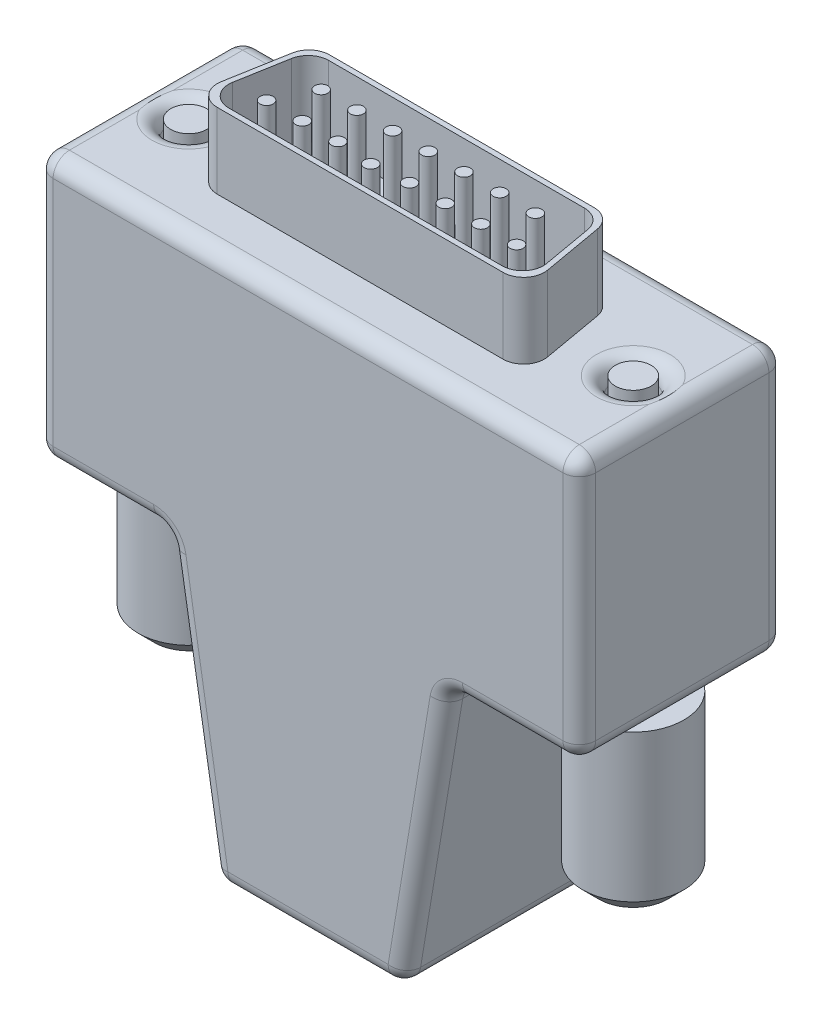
ISO-10303-21;
HEADER;
FILE_DESCRIPTION(('STEP AP214'),'2;1');
FILE_NAME('part.step','',(''),(''),'','','');
FILE_SCHEMA(('AUTOMOTIVE_DESIGN { 1 0 10303 214 1 1 1 1 }'));
ENDSEC;
DATA;
#1=APPLICATION_CONTEXT('core data for automotive mechanical design processes');
#2=APPLICATION_PROTOCOL_DEFINITION('international standard','automotive_design',2000,#1);
#3=PRODUCT_CONTEXT('',#1,'mechanical');
#4=PRODUCT('Part','Part','',(#3));
#5=PRODUCT_RELATED_PRODUCT_CATEGORY('part','',(#4));
#6=PRODUCT_DEFINITION_FORMATION('','',#4);
#7=PRODUCT_DEFINITION_CONTEXT('part definition',#1,'design');
#8=PRODUCT_DEFINITION('design','',#6,#7);
#9=PRODUCT_DEFINITION_SHAPE('','',#8);
#10=(LENGTH_UNIT() NAMED_UNIT(*) SI_UNIT(.MILLI.,.METRE.));
#11=(NAMED_UNIT(*) PLANE_ANGLE_UNIT() SI_UNIT($,.RADIAN.));
#12=(NAMED_UNIT(*) SI_UNIT($,.STERADIAN.) SOLID_ANGLE_UNIT());
#13=UNCERTAINTY_MEASURE_WITH_UNIT(LENGTH_MEASURE(1.E-05),#10,'distance_accuracy_value','');
#14=(GEOMETRIC_REPRESENTATION_CONTEXT(3) GLOBAL_UNCERTAINTY_ASSIGNED_CONTEXT((#13)) GLOBAL_UNIT_ASSIGNED_CONTEXT((#10,
#11,#12)) REPRESENTATION_CONTEXT('',''));
#15=CARTESIAN_POINT('',(0.,0.,0.));
#16=DIRECTION('',(0.,0.,1.));
#17=DIRECTION('',(1.,0.,0.));
#18=AXIS2_PLACEMENT_3D('',#15,#16,#17);
#19=CARTESIAN_POINT('',(17.272,5.08,0.));
#20=DIRECTION('',(0.,1.,0.));
#21=DIRECTION('',(0.,0.,1.));
#22=AXIS2_PLACEMENT_3D('',#19,#20,#21);
#23=PLANE('',#22);
#24=CARTESIAN_POINT('',(17.272,5.08,0.));
#25=DIRECTION('',(0.,1.,0.));
#26=DIRECTION('',(0.,0.,1.));
#27=AXIS2_PLACEMENT_3D('',#24,#25,#26);
#28=CIRCLE('',#27,1.5875);
#29=CARTESIAN_POINT('',(17.272,5.08,1.5875));
#30=VERTEX_POINT('',#29);
#31=EDGE_CURVE('E499',#30,#30,#28,.F.);
#32=ORIENTED_EDGE('',*,*,#31,.F.);
#33=EDGE_LOOP('',(#32));
#34=FACE_BOUND('',#33,.T.);
#35=CARTESIAN_POINT('',(17.272,5.08,0.));
#36=DIRECTION('',(0.,1.,0.));
#37=DIRECTION('',(0.,0.,1.));
#38=AXIS2_PLACEMENT_3D('',#35,#36,#37);
#39=CIRCLE('',#38,1.397);
#40=CARTESIAN_POINT('',(17.272,5.08,1.397));
#41=VERTEX_POINT('',#40);
#42=EDGE_CURVE('E2495',#41,#41,#39,.T.);
#43=ORIENTED_EDGE('',*,*,#42,.F.);
#44=EDGE_LOOP('',(#43));
#45=FACE_BOUND('',#44,.T.);
#46=ADVANCED_FACE('F36',(#34,#45),#23,.T.);
#47=CARTESIAN_POINT('',(-17.272,5.08,0.));
#48=DIRECTION('',(0.,1.,0.));
#49=DIRECTION('',(0.,0.,1.));
#50=AXIS2_PLACEMENT_3D('',#47,#48,#49);
#51=PLANE('',#50);
#52=CARTESIAN_POINT('',(-17.272,5.08,0.));
#53=DIRECTION('',(0.,1.,0.));
#54=DIRECTION('',(0.,0.,1.));
#55=AXIS2_PLACEMENT_3D('',#52,#53,#54);
#56=CIRCLE('',#55,1.5875);
#57=CARTESIAN_POINT('',(-17.272,5.08,1.5875));
#58=VERTEX_POINT('',#57);
#59=EDGE_CURVE('E868',#58,#58,#56,.F.);
#60=ORIENTED_EDGE('',*,*,#59,.F.);
#61=EDGE_LOOP('',(#60));
#62=FACE_BOUND('',#61,.T.);
#63=CARTESIAN_POINT('',(-17.272,5.08,0.));
#64=DIRECTION('',(0.,1.,0.));
#65=DIRECTION('',(0.,0.,1.));
#66=AXIS2_PLACEMENT_3D('',#63,#64,#65);
#67=CIRCLE('',#66,1.397);
#68=CARTESIAN_POINT('',(-17.272,5.08,1.397));
#69=VERTEX_POINT('',#68);
#70=EDGE_CURVE('E2494',#69,#69,#67,.T.);
#71=ORIENTED_EDGE('',*,*,#70,.F.);
#72=EDGE_LOOP('',(#71));
#73=FACE_BOUND('',#72,.T.);
#74=ADVANCED_FACE('F932',(#62,#73),#51,.T.);
#75=CARTESIAN_POINT('',(-21.082,21.209,8.001));
#76=DIRECTION('',(0.,1.,0.));
#77=DIRECTION('',(-1.,0.,0.));
#78=AXIS2_PLACEMENT_3D('',#75,#76,#77);
#79=PLANE('',#78);
#80=CARTESIAN_POINT('',(-0.0791283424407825,21.209,-1.42239999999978));
#81=DIRECTION('',(0.,1.,0.));
#82=DIRECTION('',(-1.,0.,0.));
#83=AXIS2_PLACEMENT_3D('',#80,#81,#82);
#84=CIRCLE('',#83,0.508);
#85=CARTESIAN_POINT('',(-0.587128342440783,21.209,-1.42239999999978));
#86=VERTEX_POINT('',#85);
#87=EDGE_CURVE('E11',#86,#86,#84,.T.);
#88=ORIENTED_EDGE('',*,*,#87,.F.);
#89=EDGE_LOOP('',(#88));
#90=FACE_BOUND('',#89,.T.);
#91=CARTESIAN_POINT('',(-5.62648834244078,21.2089999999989,-1.42239999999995));
#92=DIRECTION('',(0.,1.,0.));
#93=DIRECTION('',(-1.,0.,0.));
#94=AXIS2_PLACEMENT_3D('',#91,#92,#93);
#95=CIRCLE('',#94,0.508);
#96=CARTESIAN_POINT('',(-6.13448834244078,21.2089999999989,-1.42239999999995));
#97=VERTEX_POINT('',#96);
#98=EDGE_CURVE('E952',#97,#97,#95,.T.);
#99=ORIENTED_EDGE('',*,*,#98,.F.);
#100=EDGE_LOOP('',(#99));
#101=FACE_BOUND('',#100,.T.);
#102=CARTESIAN_POINT('',(5.46823165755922,21.209,-1.42239999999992));
#103=DIRECTION('',(0.,1.,0.));
#104=DIRECTION('',(-1.,0.,0.));
#105=AXIS2_PLACEMENT_3D('',#102,#103,#104);
#106=CIRCLE('',#105,0.508);
#107=CARTESIAN_POINT('',(4.96023165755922,21.209,-1.42239999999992));
#108=VERTEX_POINT('',#107);
#109=EDGE_CURVE('E922',#108,#108,#106,.T.);
#110=ORIENTED_EDGE('',*,*,#109,.F.);
#111=EDGE_LOOP('',(#110));
#112=FACE_BOUND('',#111,.T.);
#113=CARTESIAN_POINT('',(-1.47358834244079,21.2089999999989,1.65778688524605));
#114=DIRECTION('',(0.,1.,0.));
#115=DIRECTION('',(-1.,0.,0.));
#116=AXIS2_PLACEMENT_3D('',#113,#114,#115);
#117=CIRCLE('',#116,0.508);
#118=CARTESIAN_POINT('',(-1.98158834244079,21.2089999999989,1.65778688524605));
#119=VERTEX_POINT('',#118);
#120=EDGE_CURVE('E988',#119,#119,#117,.T.);
#121=ORIENTED_EDGE('',*,*,#120,.F.);
#122=EDGE_LOOP('',(#121));
#123=FACE_BOUND('',#122,.T.);
#124=CARTESIAN_POINT('',(4.08139165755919,21.209,1.42239999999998));
#125=DIRECTION('',(0.,1.,0.));
#126=DIRECTION('',(-1.,0.,0.));
#127=AXIS2_PLACEMENT_3D('',#124,#125,#126);
#128=CIRCLE('',#127,0.508);
#129=CARTESIAN_POINT('',(3.57339165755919,21.209,1.42239999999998));
#130=VERTEX_POINT('',#129);
#131=EDGE_CURVE('E898',#130,#130,#128,.T.);
#132=ORIENTED_EDGE('',*,*,#131,.F.);
#133=EDGE_LOOP('',(#132));
#134=FACE_BOUND('',#133,.T.);
#135=CARTESIAN_POINT('',(10.6235898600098,21.209,1.9431));
#136=DIRECTION('',(0.,1.,0.));
#137=DIRECTION('',(-1.,0.,0.));
#138=AXIS2_PLACEMENT_3D('',#135,#136,#137);
#139=CIRCLE('',#138,1.6002);
#140=CARTESIAN_POINT('',(10.6235898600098,21.209,3.5433));
#141=VERTEX_POINT('',#140);
#142=CARTESIAN_POINT('',(12.1994792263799,21.209,1.66522818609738));
#143=VERTEX_POINT('',#142);
#144=EDGE_CURVE('E341',#141,#143,#139,.T.);
#145=ORIENTED_EDGE('',*,*,#144,.T.);
#146=DIRECTION('',(0.173648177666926,0.,0.984807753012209));
#147=VECTOR('',#146,1.);
#148=CARTESIAN_POINT('',(11.5142373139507,21.209,-2.22097181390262));
#149=LINE('',#148,#147);
#150=CARTESIAN_POINT('',(11.5142373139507,21.209,-2.22097181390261));
#151=VERTEX_POINT('',#150);
#152=EDGE_CURVE('E352',#151,#143,#149,.T.);
#153=ORIENTED_EDGE('',*,*,#152,.F.);
#154=CARTESIAN_POINT('',(9.93834794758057,21.209,-1.9431));
#155=DIRECTION('',(0.,1.,0.));
#156=DIRECTION('',(-1.,0.,0.));
#157=AXIS2_PLACEMENT_3D('',#154,#155,#156);
#158=CIRCLE('',#157,1.6002);
#159=CARTESIAN_POINT('',(9.93834794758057,21.209,-3.5433));
#160=VERTEX_POINT('',#159);
#161=EDGE_CURVE('E357',#151,#160,#158,.T.);
#162=ORIENTED_EDGE('',*,*,#161,.T.);
#163=DIRECTION('',(1.,0.,0.));
#164=VECTOR('',#163,1.);
#165=CARTESIAN_POINT('',(-9.93930006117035,21.209,-3.5433));
#166=LINE('',#165,#164);
#167=CARTESIAN_POINT('',(-9.93930006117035,21.209,-3.5433));
#168=VERTEX_POINT('',#167);
#169=EDGE_CURVE('E372',#168,#160,#166,.T.);
#170=ORIENTED_EDGE('',*,*,#169,.F.);
#171=CARTESIAN_POINT('',(-9.93930006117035,21.209,-1.9431));
#172=DIRECTION('',(0.,1.,0.));
#173=DIRECTION('',(-1.,0.,0.));
#174=AXIS2_PLACEMENT_3D('',#171,#172,#173);
#175=CIRCLE('',#174,1.6002);
#176=CARTESIAN_POINT('',(-11.5151894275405,21.209,-2.22097181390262));
#177=VERTEX_POINT('',#176);
#178=EDGE_CURVE('E375',#168,#177,#175,.T.);
#179=ORIENTED_EDGE('',*,*,#178,.T.);
#180=DIRECTION('',(0.173648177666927,0.,-0.984807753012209));
#181=VECTOR('',#180,1.);
#182=CARTESIAN_POINT('',(-12.2004313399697,21.209,1.66522818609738));
#183=LINE('',#182,#181);
#184=CARTESIAN_POINT('',(-12.2004313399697,21.209,1.66522818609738));
#185=VERTEX_POINT('',#184);
#186=EDGE_CURVE('E378',#185,#177,#183,.T.);
#187=ORIENTED_EDGE('',*,*,#186,.F.);
#188=CARTESIAN_POINT('',(-10.6245419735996,21.209,1.9431));
#189=DIRECTION('',(0.,-1.,0.));
#190=DIRECTION('',(1.,0.,0.));
#191=AXIS2_PLACEMENT_3D('',#188,#189,#190);
#192=CIRCLE('',#191,1.6002);
#193=CARTESIAN_POINT('',(-10.6245419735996,21.209,3.5433));
#194=VERTEX_POINT('',#193);
#195=EDGE_CURVE('E381',#194,#185,#192,.T.);
#196=ORIENTED_EDGE('',*,*,#195,.F.);
#197=DIRECTION('',(-1.,0.,0.));
#198=VECTOR('',#197,1.);
#199=CARTESIAN_POINT('',(10.6235898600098,21.209,3.5433));
#200=LINE('',#199,#198);
#201=EDGE_CURVE('E363',#141,#194,#200,.T.);
#202=ORIENTED_EDGE('',*,*,#201,.F.);
#203=EDGE_LOOP('',(#145,#153,#162,#170,#179,#187,#196,#202));
#204=FACE_BOUND('',#203,.T.);
#205=CARTESIAN_POINT('',(1.30771165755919,21.209,1.4224));
#206=DIRECTION('',(0.,1.,0.));
#207=DIRECTION('',(-1.,0.,0.));
#208=AXIS2_PLACEMENT_3D('',#205,#206,#207);
#209=CIRCLE('',#208,0.508);
#210=CARTESIAN_POINT('',(0.799711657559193,21.209,1.4224));
#211=VERTEX_POINT('',#210);
#212=EDGE_CURVE('E901',#211,#211,#209,.T.);
#213=ORIENTED_EDGE('',*,*,#212,.F.);
#214=EDGE_LOOP('',(#213));
#215=FACE_BOUND('',#214,.T.);
#216=CARTESIAN_POINT('',(6.85507165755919,21.209,1.4224));
#217=DIRECTION('',(0.,1.,0.));
#218=DIRECTION('',(-1.,0.,0.));
#219=AXIS2_PLACEMENT_3D('',#216,#217,#218);
#220=CIRCLE('',#219,0.508);
#221=CARTESIAN_POINT('',(6.34707165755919,21.209,1.4224));
#222=VERTEX_POINT('',#221);
#223=EDGE_CURVE('E904',#222,#222,#220,.T.);
#224=ORIENTED_EDGE('',*,*,#223,.F.);
#225=EDGE_LOOP('',(#224));
#226=FACE_BOUND('',#225,.T.);
#227=CARTESIAN_POINT('',(-9.80224834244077,21.209,1.4224));
#228=DIRECTION('',(0.,1.,0.));
#229=DIRECTION('',(-1.,0.,0.));
#230=AXIS2_PLACEMENT_3D('',#227,#228,#229);
#231=CIRCLE('',#230,0.508);
#232=CARTESIAN_POINT('',(-10.3102483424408,21.209,1.4224));
#233=VERTEX_POINT('',#232);
#234=EDGE_CURVE('E907',#233,#233,#231,.T.);
#235=ORIENTED_EDGE('',*,*,#234,.F.);
#236=EDGE_LOOP('',(#235));
#237=FACE_BOUND('',#236,.T.);
#238=CARTESIAN_POINT('',(9.62875165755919,21.209,1.4224));
#239=DIRECTION('',(0.,1.,0.));
#240=DIRECTION('',(-1.,0.,0.));
#241=AXIS2_PLACEMENT_3D('',#238,#239,#240);
#242=CIRCLE('',#241,0.508);
#243=CARTESIAN_POINT('',(9.12075165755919,21.209,1.4224));
#244=VERTEX_POINT('',#243);
#245=EDGE_CURVE('E910',#244,#244,#242,.T.);
#246=ORIENTED_EDGE('',*,*,#245,.F.);
#247=EDGE_LOOP('',(#246));
#248=FACE_BOUND('',#247,.T.);
#249=CARTESIAN_POINT('',(-7.02856834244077,21.209,1.4224));
#250=DIRECTION('',(0.,1.,0.));
#251=DIRECTION('',(-1.,0.,0.));
#252=AXIS2_PLACEMENT_3D('',#249,#250,#251);
#253=CIRCLE('',#252,0.508);
#254=CARTESIAN_POINT('',(-7.53656834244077,21.209,1.4224));
#255=VERTEX_POINT('',#254);
#256=EDGE_CURVE('E913',#255,#255,#253,.T.);
#257=ORIENTED_EDGE('',*,*,#256,.F.);
#258=EDGE_LOOP('',(#257));
#259=FACE_BOUND('',#258,.T.);
#260=CARTESIAN_POINT('',(-4.25488834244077,21.209,1.42240000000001));
#261=DIRECTION('',(0.,1.,0.));
#262=DIRECTION('',(-1.,0.,0.));
#263=AXIS2_PLACEMENT_3D('',#260,#261,#262);
#264=CIRCLE('',#263,0.508000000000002);
#265=CARTESIAN_POINT('',(-4.76288834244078,21.209,1.42240000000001));
#266=VERTEX_POINT('',#265);
#267=EDGE_CURVE('E916',#266,#266,#264,.T.);
#268=ORIENTED_EDGE('',*,*,#267,.F.);
#269=EDGE_LOOP('',(#268));
#270=FACE_BOUND('',#269,.T.);
#271=CARTESIAN_POINT('',(8.24191165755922,21.209,-1.4224));
#272=DIRECTION('',(0.,1.,0.));
#273=DIRECTION('',(-1.,0.,0.));
#274=AXIS2_PLACEMENT_3D('',#271,#272,#273);
#275=CIRCLE('',#274,0.508);
#276=CARTESIAN_POINT('',(7.73391165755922,21.209,-1.4224));
#277=VERTEX_POINT('',#276);
#278=EDGE_CURVE('E919',#277,#277,#275,.T.);
#279=ORIENTED_EDGE('',*,*,#278,.F.);
#280=EDGE_LOOP('',(#279));
#281=FACE_BOUND('',#280,.T.);
#282=CARTESIAN_POINT('',(-8.40016834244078,21.2089999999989,-1.4224));
#283=DIRECTION('',(0.,1.,0.));
#284=DIRECTION('',(-1.,0.,0.));
#285=AXIS2_PLACEMENT_3D('',#282,#283,#284);
#286=CIRCLE('',#285,0.508);
#287=CARTESIAN_POINT('',(-8.90816834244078,21.2089999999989,-1.4224));
#288=VERTEX_POINT('',#287);
#289=EDGE_CURVE('E961',#288,#288,#286,.T.);
#290=ORIENTED_EDGE('',*,*,#289,.F.);
#291=EDGE_LOOP('',(#290));
#292=FACE_BOUND('',#291,.T.);
#293=CARTESIAN_POINT('',(2.69455165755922,21.209,-1.42240000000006));
#294=DIRECTION('',(0.,1.,0.));
#295=DIRECTION('',(-1.,0.,0.));
#296=AXIS2_PLACEMENT_3D('',#293,#294,#295);
#297=CIRCLE('',#296,0.508);
#298=CARTESIAN_POINT('',(2.18655165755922,21.209,-1.42240000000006));
#299=VERTEX_POINT('',#298);
#300=EDGE_CURVE('E44',#299,#299,#297,.T.);
#301=ORIENTED_EDGE('',*,*,#300,.F.);
#302=EDGE_LOOP('',(#301));
#303=FACE_BOUND('',#302,.T.);
#304=CARTESIAN_POINT('',(-2.85280834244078,21.2089999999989,-1.42240000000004));
#305=DIRECTION('',(0.,1.,0.));
#306=DIRECTION('',(-1.,0.,0.));
#307=AXIS2_PLACEMENT_3D('',#304,#305,#306);
#308=CIRCLE('',#307,0.508);
#309=CARTESIAN_POINT('',(-3.36080834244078,21.2089999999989,-1.42240000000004));
#310=VERTEX_POINT('',#309);
#311=EDGE_CURVE('E937',#310,#310,#308,.T.);
#312=ORIENTED_EDGE('',*,*,#311,.F.);
#313=EDGE_LOOP('',(#312));
#314=FACE_BOUND('',#313,.T.);
#315=ADVANCED_FACE('F359',(#90,#101,#112,#123,#134,#204,#215,#226,#237,#248,#259,#270,#281,#292,
#303,#314),#79,.T.);
#316=DIRECTION('',(1.,0.,0.));
#317=VECTOR('',#316,1.);
#318=CARTESIAN_POINT('',(21.082,21.209,6.731));
#319=LINE('',#318,#317);
#320=CARTESIAN_POINT('',(-19.812,21.209,6.731));
#321=VERTEX_POINT('',#320);
#322=CARTESIAN_POINT('',(19.812,21.209,6.731));
#323=VERTEX_POINT('',#322);
#324=EDGE_CURVE('E753',#321,#323,#319,.T.);
#325=ORIENTED_EDGE('',*,*,#324,.T.);
#326=DIRECTION('',(0.,0.,-1.));
#327=VECTOR('',#326,1.);
#328=CARTESIAN_POINT('',(19.812,21.209,8.001));
#329=LINE('',#328,#327);
#330=CARTESIAN_POINT('',(19.812,21.209,1.30908603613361));
#331=VERTEX_POINT('',#330);
#332=EDGE_CURVE('E757',#323,#331,#329,.T.);
#333=ORIENTED_EDGE('',*,*,#332,.T.);
#334=CARTESIAN_POINT('',(17.272,21.209,0.));
#335=DIRECTION('',(0.,1.,0.));
#336=DIRECTION('',(-1.,0.,0.));
#337=AXIS2_PLACEMENT_3D('',#334,#335,#336);
#338=CIRCLE('',#337,2.8575);
#339=CARTESIAN_POINT('',(14.4145,21.209,0.));
#340=VERTEX_POINT('',#339);
#341=EDGE_CURVE('E755',#331,#340,#338,.F.);
#342=ORIENTED_EDGE('',*,*,#341,.T.);
#343=CARTESIAN_POINT('',(17.272,21.209,0.));
#344=DIRECTION('',(0.,1.,0.));
#345=DIRECTION('',(-1.,0.,0.));
#346=AXIS2_PLACEMENT_3D('',#343,#344,#345);
#347=CIRCLE('',#346,2.8575);
#348=CARTESIAN_POINT('',(19.812,21.209,-1.30908603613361));
#349=VERTEX_POINT('',#348);
#350=EDGE_CURVE('E751',#340,#349,#347,.F.);
#351=ORIENTED_EDGE('',*,*,#350,.T.);
#352=DIRECTION('',(0.,0.,-1.));
#353=VECTOR('',#352,1.);
#354=CARTESIAN_POINT('',(19.812,21.209,8.001));
#355=LINE('',#354,#353);
#356=CARTESIAN_POINT('',(19.812,21.209,-6.731));
#357=VERTEX_POINT('',#356);
#358=EDGE_CURVE('E747',#349,#357,#355,.T.);
#359=ORIENTED_EDGE('',*,*,#358,.T.);
#360=DIRECTION('',(1.,0.,0.));
#361=VECTOR('',#360,1.);
#362=CARTESIAN_POINT('',(-21.082,21.209,-6.731));
#363=LINE('',#362,#361);
#364=CARTESIAN_POINT('',(-19.812,21.209,-6.731));
#365=VERTEX_POINT('',#364);
#366=EDGE_CURVE('E741',#357,#365,#363,.F.);
#367=ORIENTED_EDGE('',*,*,#366,.T.);
#368=DIRECTION('',(0.,0.,-1.));
#369=VECTOR('',#368,1.);
#370=CARTESIAN_POINT('',(-19.812,21.209,8.001));
#371=LINE('',#370,#369);
#372=CARTESIAN_POINT('',(-19.812,21.209,-1.3090860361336));
#373=VERTEX_POINT('',#372);
#374=EDGE_CURVE('E743',#365,#373,#371,.F.);
#375=ORIENTED_EDGE('',*,*,#374,.T.);
#376=CARTESIAN_POINT('',(-17.272,21.209,0.));
#377=DIRECTION('',(0.,1.,0.));
#378=DIRECTION('',(-1.,0.,0.));
#379=AXIS2_PLACEMENT_3D('',#376,#377,#378);
#380=CIRCLE('',#379,2.8575);
#381=CARTESIAN_POINT('',(-19.812,21.209,1.3090860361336));
#382=VERTEX_POINT('',#381);
#383=EDGE_CURVE('E745',#373,#382,#380,.F.);
#384=ORIENTED_EDGE('',*,*,#383,.T.);
#385=DIRECTION('',(0.,0.,-1.));
#386=VECTOR('',#385,1.);
#387=CARTESIAN_POINT('',(-19.812,21.209,8.001));
#388=LINE('',#387,#386);
#389=EDGE_CURVE('E749',#382,#321,#388,.F.);
#390=ORIENTED_EDGE('',*,*,#389,.T.);
#391=EDGE_LOOP('',(#325,#333,#342,#351,#359,#367,#375,#384,#390));
#392=FACE_BOUND('',#391,.T.);
#393=DIRECTION('',(-1.,0.,0.));
#394=VECTOR('',#393,1.);
#395=CARTESIAN_POINT('',(11.1079185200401,21.209,3.9497));
#396=LINE('',#395,#394);
#397=CARTESIAN_POINT('',(11.1079185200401,21.209,3.9497));
#398=VERTEX_POINT('',#397);
#399=CARTESIAN_POINT('',(-11.1088706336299,21.209,3.9497));
#400=VERTEX_POINT('',#399);
#401=EDGE_CURVE('E51',#398,#400,#396,.T.);
#402=ORIENTED_EDGE('',*,*,#401,.T.);
#403=CARTESIAN_POINT('',(-11.1088706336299,21.209,2.3495));
#404=DIRECTION('',(0.,1.,0.));
#405=DIRECTION('',(-1.,0.,0.));
#406=AXIS2_PLACEMENT_3D('',#403,#404,#405);
#407=CIRCLE('',#406,1.6002);
#408=CARTESIAN_POINT('',(-12.68476,21.209,2.07162818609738));
#409=VERTEX_POINT('',#408);
#410=EDGE_CURVE('E348',#409,#400,#407,.T.);
#411=ORIENTED_EDGE('',*,*,#410,.F.);
#412=DIRECTION('',(0.173648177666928,0.,-0.984807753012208));
#413=VECTOR('',#412,1.);
#414=CARTESIAN_POINT('',(-12.68476,21.209,2.07162818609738));
#415=LINE('',#414,#413);
#416=CARTESIAN_POINT('',(-11.8561995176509,21.209,-2.62737181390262));
#417=VERTEX_POINT('',#416);
#418=EDGE_CURVE('E431',#409,#417,#415,.T.);
#419=ORIENTED_EDGE('',*,*,#418,.T.);
#420=CARTESIAN_POINT('',(-10.2803101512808,21.209,-2.3495));
#421=DIRECTION('',(0.,1.,0.));
#422=DIRECTION('',(-1.,0.,0.));
#423=AXIS2_PLACEMENT_3D('',#420,#421,#422);
#424=CIRCLE('',#423,1.6002);
#425=CARTESIAN_POINT('',(-10.2803101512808,21.209,-3.9497));
#426=VERTEX_POINT('',#425);
#427=EDGE_CURVE('E428',#426,#417,#424,.T.);
#428=ORIENTED_EDGE('',*,*,#427,.F.);
#429=DIRECTION('',(1.,0.,0.));
#430=VECTOR('',#429,1.);
#431=CARTESIAN_POINT('',(-10.2803101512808,21.209,-3.9497));
#432=LINE('',#431,#430);
#433=CARTESIAN_POINT('',(10.279358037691,21.209,-3.9497));
#434=VERTEX_POINT('',#433);
#435=EDGE_CURVE('E426',#426,#434,#432,.T.);
#436=ORIENTED_EDGE('',*,*,#435,.T.);
#437=CARTESIAN_POINT('',(10.279358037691,21.209,-2.3495));
#438=DIRECTION('',(0.,1.,0.));
#439=DIRECTION('',(-1.,0.,0.));
#440=AXIS2_PLACEMENT_3D('',#437,#438,#439);
#441=CIRCLE('',#440,1.6002);
#442=CARTESIAN_POINT('',(11.8552474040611,21.209,-2.62737181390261));
#443=VERTEX_POINT('',#442);
#444=EDGE_CURVE('E423',#443,#434,#441,.T.);
#445=ORIENTED_EDGE('',*,*,#444,.F.);
#446=DIRECTION('',(0.173648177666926,0.,0.984807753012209));
#447=VECTOR('',#446,1.);
#448=CARTESIAN_POINT('',(11.8552474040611,21.209,-2.62737181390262));
#449=LINE('',#448,#447);
#450=CARTESIAN_POINT('',(12.6838078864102,21.209,2.07162818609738));
#451=VERTEX_POINT('',#450);
#452=EDGE_CURVE('E421',#443,#451,#449,.T.);
#453=ORIENTED_EDGE('',*,*,#452,.T.);
#454=CARTESIAN_POINT('',(11.1079185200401,21.209,2.3495));
#455=DIRECTION('',(0.,1.,0.));
#456=DIRECTION('',(-1.,0.,0.));
#457=AXIS2_PLACEMENT_3D('',#454,#455,#456);
#458=CIRCLE('',#457,1.6002);
#459=EDGE_CURVE('E56',#398,#451,#458,.T.);
#460=ORIENTED_EDGE('',*,*,#459,.F.);
#461=EDGE_LOOP('',(#402,#411,#419,#428,#436,#445,#453,#460));
#462=FACE_BOUND('',#461,.T.);
#463=ADVANCED_FACE('F931',(#392,#462),#79,.T.);
#464=CARTESIAN_POINT('',(-17.272,2.54,0.));
#465=DIRECTION('',(0.,1.,0.));
#466=DIRECTION('',(0.,0.,1.));
#467=AXIS2_PLACEMENT_3D('',#464,#465,#466);
#468=PLANE('',#467);
#469=CARTESIAN_POINT('',(-17.272,2.54,0.));
#470=DIRECTION('',(0.,1.,0.));
#471=DIRECTION('',(0.,0.,1.));
#472=AXIS2_PLACEMENT_3D('',#469,#470,#471);
#473=CIRCLE('',#472,1.5875);
#474=CARTESIAN_POINT('',(-17.272,2.54,1.5875));
#475=VERTEX_POINT('',#474);
#476=EDGE_CURVE('E871',#475,#475,#473,.F.);
#477=ORIENTED_EDGE('',*,*,#476,.T.);
#478=EDGE_LOOP('',(#477));
#479=FACE_BOUND('',#478,.T.);
#480=CARTESIAN_POINT('',(-17.272,2.54,0.));
#481=DIRECTION('',(0.,1.,0.));
#482=DIRECTION('',(0.,0.,1.));
#483=AXIS2_PLACEMENT_3D('',#480,#481,#482);
#484=CIRCLE('',#483,1.397);
#485=CARTESIAN_POINT('',(-17.272,2.54,1.397));
#486=VERTEX_POINT('',#485);
#487=EDGE_CURVE('E879',#486,#486,#484,.F.);
#488=ORIENTED_EDGE('',*,*,#487,.F.);
#489=EDGE_LOOP('',(#488));
#490=FACE_BOUND('',#489,.T.);
#491=ADVANCED_FACE('F1031',(#479,#490),#468,.F.);
#492=CARTESIAN_POINT('',(17.272,2.54,0.));
#493=DIRECTION('',(0.,1.,0.));
#494=DIRECTION('',(0.,0.,1.));
#495=AXIS2_PLACEMENT_3D('',#492,#493,#494);
#496=PLANE('',#495);
#497=CARTESIAN_POINT('',(17.272,2.54,0.));
#498=DIRECTION('',(0.,1.,0.));
#499=DIRECTION('',(0.,0.,1.));
#500=AXIS2_PLACEMENT_3D('',#497,#498,#499);
#501=CIRCLE('',#500,1.5875);
#502=CARTESIAN_POINT('',(17.272,2.54,1.5875));
#503=VERTEX_POINT('',#502);
#504=EDGE_CURVE('E865',#503,#503,#501,.F.);
#505=ORIENTED_EDGE('',*,*,#504,.T.);
#506=EDGE_LOOP('',(#505));
#507=FACE_BOUND('',#506,.T.);
#508=CARTESIAN_POINT('',(17.272,2.54,0.));
#509=DIRECTION('',(0.,1.,0.));
#510=DIRECTION('',(0.,0.,1.));
#511=AXIS2_PLACEMENT_3D('',#508,#509,#510);
#512=CIRCLE('',#511,1.397);
#513=CARTESIAN_POINT('',(17.272,2.54,1.397));
#514=VERTEX_POINT('',#513);
#515=EDGE_CURVE('E876',#514,#514,#512,.F.);
#516=ORIENTED_EDGE('',*,*,#515,.F.);
#517=EDGE_LOOP('',(#516));
#518=FACE_BOUND('',#517,.T.);
#519=ADVANCED_FACE('F1032',(#507,#518),#496,.F.);
#520=CARTESIAN_POINT('',(-17.272,-21.209,0.));
#521=DIRECTION('',(0.,1.,0.));
#522=DIRECTION('',(-1.,0.,0.));
#523=AXIS2_PLACEMENT_3D('',#520,#521,#522);
#524=CYLINDRICAL_SURFACE('',#523,1.5875);
#525=CARTESIAN_POINT('',(-17.272,1.905,0.));
#526=DIRECTION('',(0.,-1.,0.));
#527=DIRECTION('',(1.,0.,0.));
#528=AXIS2_PLACEMENT_3D('',#525,#526,#527);
#529=CIRCLE('',#528,1.5875);
#530=CARTESIAN_POINT('',(-15.6845,1.905,0.));
#531=VERTEX_POINT('',#530);
#532=EDGE_CURVE('E760',#531,#531,#529,.T.);
#533=ORIENTED_EDGE('',*,*,#532,.T.);
#534=EDGE_LOOP('',(#533));
#535=FACE_BOUND('',#534,.T.);
#536=ORIENTED_EDGE('',*,*,#476,.F.);
#537=EDGE_LOOP('',(#536));
#538=FACE_BOUND('',#537,.T.);
#539=ADVANCED_FACE('F1035',(#535,#538),#524,.F.);
#540=CARTESIAN_POINT('',(17.272,-21.209,0.));
#541=DIRECTION('',(0.,1.,0.));
#542=DIRECTION('',(-1.,0.,0.));
#543=AXIS2_PLACEMENT_3D('',#540,#541,#542);
#544=CYLINDRICAL_SURFACE('',#543,1.5875);
#545=CARTESIAN_POINT('',(17.272,1.905,0.));
#546=DIRECTION('',(0.,1.,0.));
#547=DIRECTION('',(0.,0.,1.));
#548=AXIS2_PLACEMENT_3D('',#545,#546,#547);
#549=CIRCLE('',#548,1.5875);
#550=CARTESIAN_POINT('',(17.272,1.905,1.5875));
#551=VERTEX_POINT('',#550);
#552=EDGE_CURVE('E729',#551,#551,#549,.F.);
#553=ORIENTED_EDGE('',*,*,#552,.T.);
#554=EDGE_LOOP('',(#553));
#555=FACE_BOUND('',#554,.T.);
#556=ORIENTED_EDGE('',*,*,#504,.F.);
#557=EDGE_LOOP('',(#556));
#558=FACE_BOUND('',#557,.T.);
#559=ADVANCED_FACE('F1050',(#555,#558),#544,.F.);
#560=CARTESIAN_POINT('',(0.,-18.669,0.));
#561=DIRECTION('',(0.,1.,0.));
#562=DIRECTION('',(0.,0.,1.));
#563=AXIS2_PLACEMENT_3D('',#560,#561,#562);
#564=PLANE('',#563);
#565=CARTESIAN_POINT('',(0.,-18.669,0.));
#566=DIRECTION('',(0.,1.,0.));
#567=DIRECTION('',(0.,0.,1.));
#568=AXIS2_PLACEMENT_3D('',#565,#566,#567);
#569=CIRCLE('',#568,2.794);
#570=CARTESIAN_POINT('',(0.,-18.669,2.794));
#571=VERTEX_POINT('',#570);
#572=EDGE_CURVE('E502',#571,#571,#569,.T.);
#573=ORIENTED_EDGE('',*,*,#572,.F.);
#574=EDGE_LOOP('',(#573));
#575=FACE_BOUND('',#574,.T.);
#576=CARTESIAN_POINT('',(0.,-18.669,0.));
#577=DIRECTION('',(0.,1.,0.));
#578=DIRECTION('',(0.,0.,1.));
#579=AXIS2_PLACEMENT_3D('',#576,#577,#578);
#580=CIRCLE('',#579,2.54);
#581=CARTESIAN_POINT('',(0.,-18.669,2.54));
#582=VERTEX_POINT('',#581);
#583=EDGE_CURVE('E862',#582,#582,#580,.F.);
#584=ORIENTED_EDGE('',*,*,#583,.F.);
#585=EDGE_LOOP('',(#584));
#586=FACE_BOUND('',#585,.T.);
#587=ADVANCED_FACE('F1047',(#575,#586),#564,.F.);
#588=CARTESIAN_POINT('',(-7.30250000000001,-21.209,8.001));
#589=DIRECTION('',(0.,1.,0.));
#590=DIRECTION('',(-1.,0.,0.));
#591=AXIS2_PLACEMENT_3D('',#588,#589,#590);
#592=PLANE('',#591);
#593=DIRECTION('',(0.,0.,-1.));
#594=VECTOR('',#593,1.);
#595=CARTESIAN_POINT('',(6.22561971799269,-21.209,8.001));
#596=LINE('',#595,#594);
#597=CARTESIAN_POINT('',(6.22561971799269,-21.209,-6.731));
#598=VERTEX_POINT('',#597);
#599=CARTESIAN_POINT('',(6.22561971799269,-21.209,6.731));
#600=VERTEX_POINT('',#599);
#601=EDGE_CURVE('E801',#598,#600,#596,.F.);
#602=ORIENTED_EDGE('',*,*,#601,.T.);
#603=DIRECTION('',(1.,0.,0.));
#604=VECTOR('',#603,1.);
#605=CARTESIAN_POINT('',(-7.30250000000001,-21.209,6.731));
#606=LINE('',#605,#604);
#607=CARTESIAN_POINT('',(-6.22561971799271,-21.209,6.731));
#608=VERTEX_POINT('',#607);
#609=EDGE_CURVE('E806',#600,#608,#606,.F.);
#610=ORIENTED_EDGE('',*,*,#609,.T.);
#611=DIRECTION('',(0.,0.,-1.));
#612=VECTOR('',#611,1.);
#613=CARTESIAN_POINT('',(-6.22561971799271,-21.209,8.001));
#614=LINE('',#613,#612);
#615=CARTESIAN_POINT('',(-6.22561971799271,-21.209,-6.731));
#616=VERTEX_POINT('',#615);
#617=EDGE_CURVE('E803',#608,#616,#614,.T.);
#618=ORIENTED_EDGE('',*,*,#617,.T.);
#619=DIRECTION('',(1.,0.,0.));
#620=VECTOR('',#619,1.);
#621=CARTESIAN_POINT('',(7.30249999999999,-21.209,-6.731));
#622=LINE('',#621,#620);
#623=EDGE_CURVE('E799',#616,#598,#622,.T.);
#624=ORIENTED_EDGE('',*,*,#623,.T.);
#625=EDGE_LOOP('',(#602,#610,#618,#624));
#626=FACE_BOUND('',#625,.T.);
#627=CARTESIAN_POINT('',(0.,-21.209,0.));
#628=DIRECTION('',(0.,1.,0.));
#629=DIRECTION('',(0.,0.,1.));
#630=AXIS2_PLACEMENT_3D('',#627,#628,#629);
#631=CIRCLE('',#630,2.794);
#632=CARTESIAN_POINT('',(0.,-21.209,2.794));
#633=VERTEX_POINT('',#632);
#634=EDGE_CURVE('E498',#633,#633,#631,.T.);
#635=ORIENTED_EDGE('',*,*,#634,.T.);
#636=EDGE_LOOP('',(#635));
#637=FACE_BOUND('',#636,.T.);
#638=ADVANCED_FACE('F1049',(#626,#637),#592,.F.);
#639=CARTESIAN_POINT('',(10.922,0.634999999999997,8.001));
#640=DIRECTION('',(0.,1.,0.));
#641=DIRECTION('',(0.,0.,1.));
#642=AXIS2_PLACEMENT_3D('',#639,#640,#641);
#643=PLANE('',#642);
#644=CARTESIAN_POINT('',(17.272,0.634999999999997,0.));
#645=DIRECTION('',(0.,1.,0.));
#646=DIRECTION('',(0.,0.,1.));
#647=AXIS2_PLACEMENT_3D('',#644,#645,#646);
#648=CIRCLE('',#647,2.8575);
#649=CARTESIAN_POINT('',(17.272,0.634999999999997,2.8575));
#650=VERTEX_POINT('',#649);
#651=CARTESIAN_POINT('',(19.812,0.634999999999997,1.30908603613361));
#652=VERTEX_POINT('',#651);
#653=EDGE_CURVE('E719',#650,#652,#648,.T.);
#654=ORIENTED_EDGE('',*,*,#653,.T.);
#655=DIRECTION('',(0.,0.,-1.));
#656=VECTOR('',#655,1.);
#657=CARTESIAN_POINT('',(19.812,0.634999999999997,8.001));
#658=LINE('',#657,#656);
#659=CARTESIAN_POINT('',(19.812,0.634999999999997,6.731));
#660=VERTEX_POINT('',#659);
#661=EDGE_CURVE('E724',#652,#660,#658,.F.);
#662=ORIENTED_EDGE('',*,*,#661,.T.);
#663=DIRECTION('',(1.,0.,0.));
#664=VECTOR('',#663,1.);
#665=CARTESIAN_POINT('',(10.922,0.634999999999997,6.731));
#666=LINE('',#665,#664);
#667=CARTESIAN_POINT('',(11.9988802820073,0.634999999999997,6.731));
#668=VERTEX_POINT('',#667);
#669=EDGE_CURVE('E722',#660,#668,#666,.F.);
#670=ORIENTED_EDGE('',*,*,#669,.T.);
#671=DIRECTION('',(0.,0.,-1.));
#672=VECTOR('',#671,1.);
#673=CARTESIAN_POINT('',(11.9988802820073,0.634999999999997,8.001));
#674=LINE('',#673,#672);
#675=CARTESIAN_POINT('',(11.9988802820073,0.634999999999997,-6.731));
#676=VERTEX_POINT('',#675);
#677=EDGE_CURVE('E713',#668,#676,#674,.T.);
#678=ORIENTED_EDGE('',*,*,#677,.T.);
#679=DIRECTION('',(1.,0.,0.));
#680=VECTOR('',#679,1.);
#681=CARTESIAN_POINT('',(21.082,0.634999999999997,-6.731));
#682=LINE('',#681,#680);
#683=CARTESIAN_POINT('',(19.812,0.634999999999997,-6.731));
#684=VERTEX_POINT('',#683);
#685=EDGE_CURVE('E711',#676,#684,#682,.T.);
#686=ORIENTED_EDGE('',*,*,#685,.T.);
#687=DIRECTION('',(0.,0.,-1.));
#688=VECTOR('',#687,1.);
#689=CARTESIAN_POINT('',(19.812,0.634999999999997,8.001));
#690=LINE('',#689,#688);
#691=CARTESIAN_POINT('',(19.812,0.634999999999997,-1.30908603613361));
#692=VERTEX_POINT('',#691);
#693=EDGE_CURVE('E715',#684,#692,#690,.F.);
#694=ORIENTED_EDGE('',*,*,#693,.T.);
#695=CARTESIAN_POINT('',(17.272,0.634999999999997,0.));
#696=DIRECTION('',(0.,1.,0.));
#697=DIRECTION('',(0.,0.,1.));
#698=AXIS2_PLACEMENT_3D('',#695,#696,#697);
#699=CIRCLE('',#698,2.8575);
#700=EDGE_CURVE('E717',#692,#650,#699,.T.);
#701=ORIENTED_EDGE('',*,*,#700,.T.);
#702=EDGE_LOOP('',(#654,#662,#670,#678,#686,#694,#701));
#703=FACE_BOUND('',#702,.T.);
#704=ADVANCED_FACE('F38',(#703),#643,.F.);
#705=CARTESIAN_POINT('',(21.082,21.209,8.001));
#706=DIRECTION('',(1.,0.,0.));
#707=DIRECTION('',(0.,0.,-1.));
#708=AXIS2_PLACEMENT_3D('',#705,#706,#707);
#709=PLANE('',#708);
#710=DIRECTION('',(0.,0.,-1.));
#711=VECTOR('',#710,1.);
#712=CARTESIAN_POINT('',(21.082,19.939,8.001));
#713=LINE('',#712,#711);
#714=CARTESIAN_POINT('',(21.082,19.939,-6.731));
#715=VERTEX_POINT('',#714);
#716=CARTESIAN_POINT('',(21.082,19.939,6.731));
#717=VERTEX_POINT('',#716);
#718=EDGE_CURVE('E734',#715,#717,#713,.F.);
#719=ORIENTED_EDGE('',*,*,#718,.T.);
#720=DIRECTION('',(0.,-1.,0.));
#721=VECTOR('',#720,1.);
#722=CARTESIAN_POINT('',(21.082,0.634999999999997,6.731));
#723=LINE('',#722,#721);
#724=CARTESIAN_POINT('',(21.082,1.905,6.731));
#725=VERTEX_POINT('',#724);
#726=EDGE_CURVE('E739',#717,#725,#723,.T.);
#727=ORIENTED_EDGE('',*,*,#726,.T.);
#728=DIRECTION('',(0.,0.,-1.));
#729=VECTOR('',#728,1.);
#730=CARTESIAN_POINT('',(21.082,1.905,-8.001));
#731=LINE('',#730,#729);
#732=CARTESIAN_POINT('',(21.082,1.905,-6.731));
#733=VERTEX_POINT('',#732);
#734=EDGE_CURVE('E736',#725,#733,#731,.T.);
#735=ORIENTED_EDGE('',*,*,#734,.T.);
#736=DIRECTION('',(0.,-1.,0.));
#737=VECTOR('',#736,1.);
#738=CARTESIAN_POINT('',(21.082,21.209,-6.731));
#739=LINE('',#738,#737);
#740=EDGE_CURVE('E732',#733,#715,#739,.F.);
#741=ORIENTED_EDGE('',*,*,#740,.T.);
#742=EDGE_LOOP('',(#719,#727,#735,#741));
#743=FACE_BOUND('',#742,.T.);
#744=ADVANCED_FACE('F1068',(#743),#709,.T.);
#745=CARTESIAN_POINT('',(-21.082,21.209,8.001));
#746=DIRECTION('',(1.,0.,0.));
#747=DIRECTION('',(0.,1.,0.));
#748=AXIS2_PLACEMENT_3D('',#745,#746,#747);
#749=PLANE('',#748);
#750=DIRECTION('',(0.,0.,-1.));
#751=VECTOR('',#750,1.);
#752=CARTESIAN_POINT('',(-21.082,1.905,8.001));
#753=LINE('',#752,#751);
#754=CARTESIAN_POINT('',(-21.082,1.905,-6.731));
#755=VERTEX_POINT('',#754);
#756=CARTESIAN_POINT('',(-21.082,1.905,6.731));
#757=VERTEX_POINT('',#756);
#758=EDGE_CURVE('E768',#755,#757,#753,.F.);
#759=ORIENTED_EDGE('',*,*,#758,.T.);
#760=DIRECTION('',(0.,-1.,0.));
#761=VECTOR('',#760,1.);
#762=CARTESIAN_POINT('',(-21.082,21.209,6.731));
#763=LINE('',#762,#761);
#764=CARTESIAN_POINT('',(-21.082,19.939,6.731));
#765=VERTEX_POINT('',#764);
#766=EDGE_CURVE('E773',#757,#765,#763,.F.);
#767=ORIENTED_EDGE('',*,*,#766,.T.);
#768=DIRECTION('',(0.,0.,-1.));
#769=VECTOR('',#768,1.);
#770=CARTESIAN_POINT('',(-21.082,19.939,-8.001));
#771=LINE('',#770,#769);
#772=CARTESIAN_POINT('',(-21.082,19.939,-6.731));
#773=VERTEX_POINT('',#772);
#774=EDGE_CURVE('E770',#765,#773,#771,.T.);
#775=ORIENTED_EDGE('',*,*,#774,.T.);
#776=DIRECTION('',(0.,-1.,0.));
#777=VECTOR('',#776,1.);
#778=CARTESIAN_POINT('',(-21.082,0.635000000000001,-6.731));
#779=LINE('',#778,#777);
#780=EDGE_CURVE('E766',#773,#755,#779,.T.);
#781=ORIENTED_EDGE('',*,*,#780,.T.);
#782=EDGE_LOOP('',(#759,#767,#775,#781));
#783=FACE_BOUND('',#782,.T.);
#784=ADVANCED_FACE('F1081',(#783),#749,.F.);
#785=CARTESIAN_POINT('',(-10.922,0.635,8.001));
#786=DIRECTION('',(0.,-1.,0.));
#787=DIRECTION('',(1.,0.,0.));
#788=AXIS2_PLACEMENT_3D('',#785,#786,#787);
#789=PLANE('',#788);
#790=DIRECTION('',(0.,0.,-1.));
#791=VECTOR('',#790,1.);
#792=CARTESIAN_POINT('',(-19.812,0.635000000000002,-8.001));
#793=LINE('',#792,#791);
#794=CARTESIAN_POINT('',(-19.812,0.635000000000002,6.731));
#795=VERTEX_POINT('',#794);
#796=CARTESIAN_POINT('',(-19.812,0.635000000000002,1.30908603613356));
#797=VERTEX_POINT('',#796);
#798=EDGE_CURVE('E785',#795,#797,#793,.T.);
#799=ORIENTED_EDGE('',*,*,#798,.T.);
#800=CARTESIAN_POINT('',(-17.272,0.635000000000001,0.));
#801=DIRECTION('',(0.,-1.,0.));
#802=DIRECTION('',(1.,0.,0.));
#803=AXIS2_PLACEMENT_3D('',#800,#801,#802);
#804=CIRCLE('',#803,2.8575);
#805=CARTESIAN_POINT('',(-14.4145,0.635000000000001,0.));
#806=VERTEX_POINT('',#805);
#807=EDGE_CURVE('E788',#797,#806,#804,.F.);
#808=ORIENTED_EDGE('',*,*,#807,.T.);
#809=CARTESIAN_POINT('',(-17.272,0.635000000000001,0.));
#810=DIRECTION('',(0.,-1.,0.));
#811=DIRECTION('',(1.,0.,0.));
#812=AXIS2_PLACEMENT_3D('',#809,#810,#811);
#813=CIRCLE('',#812,2.8575);
#814=CARTESIAN_POINT('',(-19.812,0.635000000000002,-1.30908603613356));
#815=VERTEX_POINT('',#814);
#816=EDGE_CURVE('E783',#806,#815,#813,.F.);
#817=ORIENTED_EDGE('',*,*,#816,.T.);
#818=DIRECTION('',(0.,0.,-1.));
#819=VECTOR('',#818,1.);
#820=CARTESIAN_POINT('',(-19.812,0.635000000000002,-8.001));
#821=LINE('',#820,#819);
#822=CARTESIAN_POINT('',(-19.812,0.635000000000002,-6.731));
#823=VERTEX_POINT('',#822);
#824=EDGE_CURVE('E779',#815,#823,#821,.T.);
#825=ORIENTED_EDGE('',*,*,#824,.T.);
#826=DIRECTION('',(-1.,0.,0.));
#827=VECTOR('',#826,1.);
#828=CARTESIAN_POINT('',(-10.922,0.635,-6.731));
#829=LINE('',#828,#827);
#830=CARTESIAN_POINT('',(-11.9988802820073,0.635,-6.731));
#831=VERTEX_POINT('',#830);
#832=EDGE_CURVE('E775',#823,#831,#829,.F.);
#833=ORIENTED_EDGE('',*,*,#832,.T.);
#834=DIRECTION('',(0.,0.,-1.));
#835=VECTOR('',#834,1.);
#836=CARTESIAN_POINT('',(-11.9988802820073,0.635,8.001));
#837=LINE('',#836,#835);
#838=CARTESIAN_POINT('',(-11.9988802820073,0.635,6.731));
#839=VERTEX_POINT('',#838);
#840=EDGE_CURVE('E777',#831,#839,#837,.F.);
#841=ORIENTED_EDGE('',*,*,#840,.T.);
#842=DIRECTION('',(-1.,0.,0.));
#843=VECTOR('',#842,1.);
#844=CARTESIAN_POINT('',(-21.082,0.635000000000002,6.731));
#845=LINE('',#844,#843);
#846=EDGE_CURVE('E781',#839,#795,#845,.T.);
#847=ORIENTED_EDGE('',*,*,#846,.T.);
#848=EDGE_LOOP('',(#799,#808,#817,#825,#833,#841,#847));
#849=FACE_BOUND('',#848,.T.);
#850=ADVANCED_FACE('F1077',(#849),#789,.T.);
#851=CARTESIAN_POINT('',(-10.922,0.635,8.001));
#852=DIRECTION('',(0.986548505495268,0.163468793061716,0.));
#853=DIRECTION('',(-0.163468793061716,0.986548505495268,0.));
#854=AXIS2_PLACEMENT_3D('',#851,#852,#853);
#855=PLANE('',#854);
#856=DIRECTION('',(0.,0.,-1.));
#857=VECTOR('',#856,1.);
#858=CARTESIAN_POINT('',(-7.4785363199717,-20.1466053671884,8.001));
#859=LINE('',#858,#857);
#860=CARTESIAN_POINT('',(-7.4785363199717,-20.1466053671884,-6.731));
#861=VERTEX_POINT('',#860);
#862=CARTESIAN_POINT('',(-7.4785363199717,-20.1466053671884,6.731));
#863=VERTEX_POINT('',#862);
#864=EDGE_CURVE('E792',#861,#863,#859,.F.);
#865=ORIENTED_EDGE('',*,*,#864,.T.);
#866=DIRECTION('',(0.163468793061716,-0.986548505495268,0.));
#867=VECTOR('',#866,1.);
#868=CARTESIAN_POINT('',(-10.922,0.635,6.731));
#869=LINE('',#868,#867);
#870=CARTESIAN_POINT('',(-10.7459636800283,-0.427394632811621,6.731));
#871=VERTEX_POINT('',#870);
#872=EDGE_CURVE('E797',#863,#871,#869,.F.);
#873=ORIENTED_EDGE('',*,*,#872,.T.);
#874=DIRECTION('',(0.,0.,-1.));
#875=VECTOR('',#874,1.);
#876=CARTESIAN_POINT('',(-10.7459636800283,-0.427394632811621,8.001));
#877=LINE('',#876,#875);
#878=CARTESIAN_POINT('',(-10.7459636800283,-0.427394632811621,-6.731));
#879=VERTEX_POINT('',#878);
#880=EDGE_CURVE('E794',#871,#879,#877,.T.);
#881=ORIENTED_EDGE('',*,*,#880,.T.);
#882=DIRECTION('',(0.163468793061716,-0.986548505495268,0.));
#883=VECTOR('',#882,1.);
#884=CARTESIAN_POINT('',(-7.30250000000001,-21.209,-6.731));
#885=LINE('',#884,#883);
#886=EDGE_CURVE('E790',#879,#861,#885,.T.);
#887=ORIENTED_EDGE('',*,*,#886,.T.);
#888=EDGE_LOOP('',(#865,#873,#881,#887));
#889=FACE_BOUND('',#888,.T.);
#890=ADVANCED_FACE('F1074',(#889),#855,.F.);
#891=CARTESIAN_POINT('',(10.922,0.634999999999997,8.001));
#892=DIRECTION('',(0.986548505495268,-0.163468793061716,0.));
#893=DIRECTION('',(0.163468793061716,0.986548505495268,0.));
#894=AXIS2_PLACEMENT_3D('',#891,#892,#893);
#895=PLANE('',#894);
#896=DIRECTION('',(0.,0.,-1.));
#897=VECTOR('',#896,1.);
#898=CARTESIAN_POINT('',(10.7459636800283,-0.427394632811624,8.001));
#899=LINE('',#898,#897);
#900=CARTESIAN_POINT('',(10.7459636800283,-0.427394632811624,-6.731));
#901=VERTEX_POINT('',#900);
#902=CARTESIAN_POINT('',(10.7459636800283,-0.427394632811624,6.731));
#903=VERTEX_POINT('',#902);
#904=EDGE_CURVE('E810',#901,#903,#899,.F.);
#905=ORIENTED_EDGE('',*,*,#904,.T.);
#906=DIRECTION('',(-0.163468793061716,-0.986548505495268,0.));
#907=VECTOR('',#906,1.);
#908=CARTESIAN_POINT('',(7.30249999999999,-21.209,6.731));
#909=LINE('',#908,#907);
#910=CARTESIAN_POINT('',(7.47853631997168,-20.1466053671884,6.731));
#911=VERTEX_POINT('',#910);
#912=EDGE_CURVE('E815',#903,#911,#909,.T.);
#913=ORIENTED_EDGE('',*,*,#912,.T.);
#914=DIRECTION('',(0.,0.,-1.));
#915=VECTOR('',#914,1.);
#916=CARTESIAN_POINT('',(7.47853631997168,-20.1466053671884,-8.001));
#917=LINE('',#916,#915);
#918=CARTESIAN_POINT('',(7.47853631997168,-20.1466053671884,-6.731));
#919=VERTEX_POINT('',#918);
#920=EDGE_CURVE('E812',#911,#919,#917,.T.);
#921=ORIENTED_EDGE('',*,*,#920,.T.);
#922=DIRECTION('',(-0.163468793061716,-0.986548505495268,0.));
#923=VECTOR('',#922,1.);
#924=CARTESIAN_POINT('',(10.922,0.634999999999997,-6.731));
#925=LINE('',#924,#923);
#926=EDGE_CURVE('E808',#919,#901,#925,.F.);
#927=ORIENTED_EDGE('',*,*,#926,.T.);
#928=EDGE_LOOP('',(#905,#913,#921,#927));
#929=FACE_BOUND('',#928,.T.);
#930=ADVANCED_FACE('F1072',(#929),#895,.T.);
#931=CARTESIAN_POINT('',(21.082,0.634999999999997,8.001));
#932=DIRECTION('',(0.,0.,-1.));
#933=DIRECTION('',(-1.,0.,0.));
#934=AXIS2_PLACEMENT_3D('',#931,#932,#933);
#935=PLANE('',#934);
#936=DIRECTION('',(0.163468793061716,-0.986548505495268,0.));
#937=VECTOR('',#936,1.);
#938=CARTESIAN_POINT('',(-8.81387102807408,-4.31867630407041,8.001));
#939=LINE('',#938,#937);
#940=CARTESIAN_POINT('',(-9.49304707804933,-0.219789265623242,8.001));
#941=VERTEX_POINT('',#940);
#942=CARTESIAN_POINT('',(-6.22561971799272,-19.939,8.001));
#943=VERTEX_POINT('',#942);
#944=EDGE_CURVE('E835',#941,#943,#939,.T.);
#945=ORIENTED_EDGE('',*,*,#944,.T.);
#946=DIRECTION('',(1.,0.,0.));
#947=VECTOR('',#946,1.);
#948=CARTESIAN_POINT('',(21.082,-19.939,8.001));
#949=LINE('',#948,#947);
#950=CARTESIAN_POINT('',(6.22561971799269,-19.939,8.001));
#951=VERTEX_POINT('',#950);
#952=EDGE_CURVE('E837',#943,#951,#949,.T.);
#953=ORIENTED_EDGE('',*,*,#952,.T.);
#954=DIRECTION('',(-0.163468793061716,-0.986548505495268,0.));
#955=VECTOR('',#954,1.);
#956=CARTESIAN_POINT('',(9.669083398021,0.842605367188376,8.001));
#957=LINE('',#956,#955);
#958=CARTESIAN_POINT('',(9.49304707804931,-0.219789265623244,8.001));
#959=VERTEX_POINT('',#958);
#960=EDGE_CURVE('E829',#951,#959,#957,.F.);
#961=ORIENTED_EDGE('',*,*,#960,.T.);
#962=CARTESIAN_POINT('',(11.9988802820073,-0.635000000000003,8.001));
#963=DIRECTION('',(0.,0.,-1.));
#964=DIRECTION('',(-1.,0.,0.));
#965=AXIS2_PLACEMENT_3D('',#962,#963,#964);
#966=CIRCLE('',#965,2.54);
#967=CARTESIAN_POINT('',(11.9988802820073,1.905,8.001));
#968=VERTEX_POINT('',#967);
#969=EDGE_CURVE('E827',#968,#959,#966,.F.);
#970=ORIENTED_EDGE('',*,*,#969,.F.);
#971=DIRECTION('',(1.,0.,0.));
#972=VECTOR('',#971,1.);
#973=CARTESIAN_POINT('',(21.082,1.905,8.001));
#974=LINE('',#973,#972);
#975=CARTESIAN_POINT('',(19.812,1.905,8.001));
#976=VERTEX_POINT('',#975);
#977=EDGE_CURVE('E817',#968,#976,#974,.T.);
#978=ORIENTED_EDGE('',*,*,#977,.T.);
#979=DIRECTION('',(0.,-1.,0.));
#980=VECTOR('',#979,1.);
#981=CARTESIAN_POINT('',(19.812,21.209,8.001));
#982=LINE('',#981,#980);
#983=CARTESIAN_POINT('',(19.812,19.939,8.001));
#984=VERTEX_POINT('',#983);
#985=EDGE_CURVE('E819',#976,#984,#982,.F.);
#986=ORIENTED_EDGE('',*,*,#985,.T.);
#987=DIRECTION('',(1.,0.,0.));
#988=VECTOR('',#987,1.);
#989=CARTESIAN_POINT('',(-21.082,19.939,8.001));
#990=LINE('',#989,#988);
#991=CARTESIAN_POINT('',(-19.812,19.939,8.001));
#992=VERTEX_POINT('',#991);
#993=EDGE_CURVE('E821',#984,#992,#990,.F.);
#994=ORIENTED_EDGE('',*,*,#993,.T.);
#995=DIRECTION('',(0.,-1.,0.));
#996=VECTOR('',#995,1.);
#997=CARTESIAN_POINT('',(-19.812,0.635000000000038,8.001));
#998=LINE('',#997,#996);
#999=CARTESIAN_POINT('',(-19.812,1.905,8.001));
#1000=VERTEX_POINT('',#999);
#1001=EDGE_CURVE('E823',#992,#1000,#998,.T.);
#1002=ORIENTED_EDGE('',*,*,#1001,.T.);
#1003=DIRECTION('',(-1.,0.,0.));
#1004=VECTOR('',#1003,1.);
#1005=CARTESIAN_POINT('',(-10.922,1.905,8.001));
#1006=LINE('',#1005,#1004);
#1007=CARTESIAN_POINT('',(-11.9988802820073,1.905,8.001));
#1008=VERTEX_POINT('',#1007);
#1009=EDGE_CURVE('E825',#1000,#1008,#1006,.F.);
#1010=ORIENTED_EDGE('',*,*,#1009,.T.);
#1011=CARTESIAN_POINT('',(-11.9988802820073,-0.635,8.001));
#1012=DIRECTION('',(0.,0.,-1.));
#1013=DIRECTION('',(-1.,0.,0.));
#1014=AXIS2_PLACEMENT_3D('',#1011,#1012,#1013);
#1015=CIRCLE('',#1014,2.54);
#1016=EDGE_CURVE('E832',#941,#1008,#1015,.F.);
#1017=ORIENTED_EDGE('',*,*,#1016,.F.);
#1018=EDGE_LOOP('',(#945,#953,#961,#970,#978,#986,#994,#1002,#1010,#1017));
#1019=FACE_BOUND('',#1018,.T.);
#1020=ADVANCED_FACE('F2294',(#1019),#935,.F.);
#1021=CARTESIAN_POINT('',(21.082,0.634999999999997,-8.001));
#1022=DIRECTION('',(0.,0.,-1.));
#1023=DIRECTION('',(-1.,0.,0.));
#1024=AXIS2_PLACEMENT_3D('',#1021,#1022,#1023);
#1025=PLANE('',#1024);
#1026=DIRECTION('',(0.,-1.,0.));
#1027=VECTOR('',#1026,1.);
#1028=CARTESIAN_POINT('',(-19.812,21.209,-8.001));
#1029=LINE('',#1028,#1027);
#1030=CARTESIAN_POINT('',(-19.812,1.905,-8.001));
#1031=VERTEX_POINT('',#1030);
#1032=CARTESIAN_POINT('',(-19.812,19.939,-8.001));
#1033=VERTEX_POINT('',#1032);
#1034=EDGE_CURVE('E858',#1031,#1033,#1029,.F.);
#1035=ORIENTED_EDGE('',*,*,#1034,.T.);
#1036=DIRECTION('',(1.,0.,0.));
#1037=VECTOR('',#1036,1.);
#1038=CARTESIAN_POINT('',(21.082,19.939,-8.001));
#1039=LINE('',#1038,#1037);
#1040=CARTESIAN_POINT('',(19.812,19.939,-8.001));
#1041=VERTEX_POINT('',#1040);
#1042=EDGE_CURVE('E860',#1033,#1041,#1039,.T.);
#1043=ORIENTED_EDGE('',*,*,#1042,.T.);
#1044=DIRECTION('',(0.,-1.,0.));
#1045=VECTOR('',#1044,1.);
#1046=CARTESIAN_POINT('',(19.812,0.634999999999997,-8.001));
#1047=LINE('',#1046,#1045);
#1048=CARTESIAN_POINT('',(19.812,1.905,-8.001));
#1049=VERTEX_POINT('',#1048);
#1050=EDGE_CURVE('E850',#1041,#1049,#1047,.T.);
#1051=ORIENTED_EDGE('',*,*,#1050,.T.);
#1052=DIRECTION('',(1.,0.,0.));
#1053=VECTOR('',#1052,1.);
#1054=CARTESIAN_POINT('',(10.922,1.905,-8.001));
#1055=LINE('',#1054,#1053);
#1056=CARTESIAN_POINT('',(11.9988802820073,1.905,-8.001));
#1057=VERTEX_POINT('',#1056);
#1058=EDGE_CURVE('E842',#1049,#1057,#1055,.F.);
#1059=ORIENTED_EDGE('',*,*,#1058,.T.);
#1060=CARTESIAN_POINT('',(11.9988802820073,-0.635000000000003,-8.001));
#1061=DIRECTION('',(0.,0.,-1.));
#1062=DIRECTION('',(-1.,0.,0.));
#1063=AXIS2_PLACEMENT_3D('',#1060,#1061,#1062);
#1064=CIRCLE('',#1063,2.54);
#1065=CARTESIAN_POINT('',(9.49304707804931,-0.219789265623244,-8.001));
#1066=VERTEX_POINT('',#1065);
#1067=EDGE_CURVE('E839',#1066,#1057,#1064,.T.);
#1068=ORIENTED_EDGE('',*,*,#1067,.F.);
#1069=DIRECTION('',(-0.163468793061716,-0.986548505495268,0.));
#1070=VECTOR('',#1069,1.);
#1071=CARTESIAN_POINT('',(9.94057938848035,2.48110748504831,-8.001));
#1072=LINE('',#1071,#1070);
#1073=CARTESIAN_POINT('',(6.22561971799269,-19.939,-8.001));
#1074=VERTEX_POINT('',#1073);
#1075=EDGE_CURVE('E844',#1066,#1074,#1072,.T.);
#1076=ORIENTED_EDGE('',*,*,#1075,.T.);
#1077=DIRECTION('',(1.,0.,0.));
#1078=VECTOR('',#1077,1.);
#1079=CARTESIAN_POINT('',(-7.30250000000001,-19.939,-8.001));
#1080=LINE('',#1079,#1078);
#1081=CARTESIAN_POINT('',(-6.22561971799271,-19.939,-8.001));
#1082=VERTEX_POINT('',#1081);
#1083=EDGE_CURVE('E846',#1074,#1082,#1080,.F.);
#1084=ORIENTED_EDGE('',*,*,#1083,.T.);
#1085=DIRECTION('',(0.163468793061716,-0.986548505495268,0.));
#1086=VECTOR('',#1085,1.);
#1087=CARTESIAN_POINT('',(-9.66908339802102,0.842605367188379,-8.001));
#1088=LINE('',#1087,#1086);
#1089=CARTESIAN_POINT('',(-9.49304707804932,-0.219789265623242,-8.001));
#1090=VERTEX_POINT('',#1089);
#1091=EDGE_CURVE('E848',#1082,#1090,#1088,.F.);
#1092=ORIENTED_EDGE('',*,*,#1091,.T.);
#1093=CARTESIAN_POINT('',(-11.9988802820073,-0.635,-8.001));
#1094=DIRECTION('',(0.,0.,-1.));
#1095=DIRECTION('',(-1.,0.,0.));
#1096=AXIS2_PLACEMENT_3D('',#1093,#1094,#1095);
#1097=CIRCLE('',#1096,2.54);
#1098=CARTESIAN_POINT('',(-11.9988802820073,1.905,-8.001));
#1099=VERTEX_POINT('',#1098);
#1100=EDGE_CURVE('E853',#1099,#1090,#1097,.T.);
#1101=ORIENTED_EDGE('',*,*,#1100,.F.);
#1102=DIRECTION('',(-1.,0.,0.));
#1103=VECTOR('',#1102,1.);
#1104=CARTESIAN_POINT('',(21.082,1.90499999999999,-8.001));
#1105=LINE('',#1104,#1103);
#1106=EDGE_CURVE('E856',#1099,#1031,#1105,.T.);
#1107=ORIENTED_EDGE('',*,*,#1106,.T.);
#1108=EDGE_LOOP('',(#1035,#1043,#1051,#1059,#1068,#1076,#1084,#1092,#1101,#1107));
#1109=FACE_BOUND('',#1108,.T.);
#1110=ADVANCED_FACE('F1227',(#1109),#1025,.T.);
#1111=ORIENTED_EDGE('',*,*,#59,.T.);
#1112=EDGE_LOOP('',(#1111));
#1113=FACE_BOUND('',#1112,.T.);
#1114=CARTESIAN_POINT('',(-17.272,19.939,0.));
#1115=DIRECTION('',(0.,1.,0.));
#1116=DIRECTION('',(-1.,0.,0.));
#1117=AXIS2_PLACEMENT_3D('',#1114,#1115,#1116);
#1118=CIRCLE('',#1117,1.5875);
#1119=CARTESIAN_POINT('',(-18.8595,19.939,0.));
#1120=VERTEX_POINT('',#1119);
#1121=EDGE_CURVE('E763',#1120,#1120,#1118,.T.);
#1122=ORIENTED_EDGE('',*,*,#1121,.T.);
#1123=EDGE_LOOP('',(#1122));
#1124=FACE_BOUND('',#1123,.T.);
#1125=ADVANCED_FACE('F1217',(#1113,#1124),#524,.F.);
#1126=ORIENTED_EDGE('',*,*,#31,.T.);
#1127=EDGE_LOOP('',(#1126));
#1128=FACE_BOUND('',#1127,.T.);
#1129=CARTESIAN_POINT('',(17.272,19.939,0.));
#1130=DIRECTION('',(0.,1.,0.));
#1131=DIRECTION('',(-1.,0.,0.));
#1132=AXIS2_PLACEMENT_3D('',#1129,#1130,#1131);
#1133=CIRCLE('',#1132,1.5875);
#1134=CARTESIAN_POINT('',(15.6845,19.939,0.));
#1135=VERTEX_POINT('',#1134);
#1136=EDGE_CURVE('E726',#1135,#1135,#1133,.T.);
#1137=ORIENTED_EDGE('',*,*,#1136,.T.);
#1138=EDGE_LOOP('',(#1137));
#1139=FACE_BOUND('',#1138,.T.);
#1140=ADVANCED_FACE('F1214',(#1128,#1139),#544,.F.);
#1141=CARTESIAN_POINT('',(-11.9988802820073,-0.635,8.001));
#1142=DIRECTION('',(0.,0.,-1.));
#1143=DIRECTION('',(-1.,0.,0.));
#1144=AXIS2_PLACEMENT_3D('',#1141,#1142,#1143);
#1145=CYLINDRICAL_SURFACE('',#1144,1.27);
#1146=CARTESIAN_POINT('',(-11.9988802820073,-0.635,6.731));
#1147=DIRECTION('',(0.,0.,-1.));
#1148=DIRECTION('',(-1.,0.,0.));
#1149=AXIS2_PLACEMENT_3D('',#1146,#1147,#1148);
#1150=CIRCLE('',#1149,1.27);
#1151=EDGE_CURVE('E708',#839,#871,#1150,.T.);
#1152=ORIENTED_EDGE('',*,*,#1151,.F.);
#1153=ORIENTED_EDGE('',*,*,#840,.F.);
#1154=CARTESIAN_POINT('',(-11.9988802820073,-0.635,-6.731));
#1155=DIRECTION('',(0.,0.,-1.));
#1156=DIRECTION('',(-1.,0.,0.));
#1157=AXIS2_PLACEMENT_3D('',#1154,#1155,#1156);
#1158=CIRCLE('',#1157,1.27);
#1159=EDGE_CURVE('E705',#879,#831,#1158,.F.);
#1160=ORIENTED_EDGE('',*,*,#1159,.F.);
#1161=ORIENTED_EDGE('',*,*,#880,.F.);
#1162=EDGE_LOOP('',(#1152,#1153,#1160,#1161));
#1163=FACE_BOUND('',#1162,.T.);
#1164=ADVANCED_FACE('F1216',(#1163),#1145,.F.);
#1165=CARTESIAN_POINT('',(-11.9988802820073,-0.635,6.731));
#1166=DIRECTION('',(0.,0.,-1.));
#1167=DIRECTION('',(-1.,0.,0.));
#1168=AXIS2_PLACEMENT_3D('',#1165,#1166,#1167);
#1169=TOROIDAL_SURFACE('',#1168,2.54,1.27);
#1170=CARTESIAN_POINT('',(-11.9988802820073,1.905,6.731));
#1171=DIRECTION('',(1.,0.,0.));
#1172=DIRECTION('',(0.,0.,-1.));
#1173=AXIS2_PLACEMENT_3D('',#1170,#1171,#1172);
#1174=CIRCLE('',#1173,1.27);
#1175=EDGE_CURVE('E697',#839,#1008,#1174,.F.);
#1176=ORIENTED_EDGE('',*,*,#1175,.F.);
#1177=ORIENTED_EDGE('',*,*,#1151,.T.);
#1178=CARTESIAN_POINT('',(-9.49304707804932,-0.219789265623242,6.731));
#1179=DIRECTION('',(-0.163468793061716,0.986548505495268,0.));
#1180=DIRECTION('',(-0.986548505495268,-0.163468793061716,0.));
#1181=AXIS2_PLACEMENT_3D('',#1178,#1179,#1180);
#1182=CIRCLE('',#1181,1.27);
#1183=EDGE_CURVE('E702',#941,#871,#1182,.F.);
#1184=ORIENTED_EDGE('',*,*,#1183,.F.);
#1185=ORIENTED_EDGE('',*,*,#1016,.T.);
#1186=EDGE_LOOP('',(#1176,#1177,#1184,#1185));
#1187=FACE_BOUND('',#1186,.T.);
#1188=ADVANCED_FACE('F1224',(#1187),#1169,.T.);
#1189=CARTESIAN_POINT('',(-17.272,1.905,0.));
#1190=DIRECTION('',(0.,-1.,0.));
#1191=DIRECTION('',(1.,0.,0.));
#1192=AXIS2_PLACEMENT_3D('',#1189,#1190,#1191);
#1193=TOROIDAL_SURFACE('',#1192,2.8575,1.27);
#1194=ORIENTED_EDGE('',*,*,#532,.F.);
#1195=EDGE_LOOP('',(#1194));
#1196=FACE_BOUND('',#1195,.T.);
#1197=ORIENTED_EDGE('',*,*,#816,.F.);
#1198=ORIENTED_EDGE('',*,*,#807,.F.);
#1199=CARTESIAN_POINT('',(-19.812,0.635000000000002,-1.30908603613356));
#1200=CARTESIAN_POINT('',(-19.8128273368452,0.635000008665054,-1.30567485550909));
#1201=CARTESIAN_POINT('',(-19.8136516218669,0.635000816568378,-1.30226290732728));
#1202=CARTESIAN_POINT('',(-19.8400140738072,0.635051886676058,-1.19271064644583));
#1203=CARTESIAN_POINT('',(-19.8625983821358,0.635858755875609,-1.08583446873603));
#1204=CARTESIAN_POINT('',(-19.9015535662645,0.638010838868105,-0.870934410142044));
#1205=CARTESIAN_POINT('',(-19.9179223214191,0.63935623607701,-0.762910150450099));
#1206=CARTESIAN_POINT('',(-19.9442317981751,0.641833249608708,-0.545935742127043));
#1207=CARTESIAN_POINT('',(-19.954164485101,0.642964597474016,-0.436984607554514));
#1208=CARTESIAN_POINT('',(-19.967423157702,0.644528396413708,-0.218688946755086));
#1209=CARTESIAN_POINT('',(-19.97075,0.644960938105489,-0.109344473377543));
#1210=CARTESIAN_POINT('',(-19.97075,0.644960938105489,0.109344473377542));
#1211=CARTESIAN_POINT('',(-19.967423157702,0.644528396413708,0.218688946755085));
#1212=CARTESIAN_POINT('',(-19.954164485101,0.642964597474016,0.436984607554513));
#1213=CARTESIAN_POINT('',(-19.9442317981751,0.641833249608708,0.545935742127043));
#1214=CARTESIAN_POINT('',(-19.9179223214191,0.63935623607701,0.762910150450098));
#1215=CARTESIAN_POINT('',(-19.9015535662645,0.638010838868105,0.870934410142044));
#1216=CARTESIAN_POINT('',(-19.8625983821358,0.635858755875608,1.08583446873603));
#1217=CARTESIAN_POINT('',(-19.8400140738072,0.635051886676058,1.19271064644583));
#1218=CARTESIAN_POINT('',(-19.8136516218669,0.635000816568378,1.30226290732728));
#1219=CARTESIAN_POINT('',(-19.8128273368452,0.635000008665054,1.30567485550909));
#1220=CARTESIAN_POINT('',(-19.812,0.635000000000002,1.30908603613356));
#1221=B_SPLINE_CURVE_WITH_KNOTS('',3,(#1199,#1200,#1201,#1202,#1203,#1204,#1205,#1206,#1207,
#1208,#1209,#1210,#1211,#1212,#1213,#1214,#1215,#1216,#1217,#1218,#1219,#1220),.UNSPECIFIED.,
.F.,.F.,(4,2,2,2,2,2,2,2,2,2,4),(0.,0.0105303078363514,0.338036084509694,0.665653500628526,
0.993679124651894,1.32166220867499,1.6496452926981,1.97767091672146,2.3052883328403,
2.63279410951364,2.64332441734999),.UNSPECIFIED.);
#1222=EDGE_CURVE('E691',#815,#797,#1221,.T.);
#1223=ORIENTED_EDGE('',*,*,#1222,.F.);
#1224=EDGE_LOOP('',(#1197,#1198,#1223));
#1225=FACE_BOUND('',#1224,.T.);
#1226=ADVANCED_FACE('F687',(#1196,#1225),#1193,.T.);
#1227=CARTESIAN_POINT('',(-11.9988802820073,-0.635,-6.731));
#1228=DIRECTION('',(0.,0.,-1.));
#1229=DIRECTION('',(-1.,0.,0.));
#1230=AXIS2_PLACEMENT_3D('',#1227,#1228,#1229);
#1231=TOROIDAL_SURFACE('',#1230,2.54,1.27);
#1232=CARTESIAN_POINT('',(-9.49304707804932,-0.219789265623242,-6.731));
#1233=DIRECTION('',(-0.163468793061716,0.986548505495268,0.));
#1234=DIRECTION('',(-0.986548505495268,-0.163468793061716,0.));
#1235=AXIS2_PLACEMENT_3D('',#1232,#1233,#1234);
#1236=CIRCLE('',#1235,1.27);
#1237=EDGE_CURVE('E2374',#879,#1090,#1236,.F.);
#1238=ORIENTED_EDGE('',*,*,#1237,.F.);
#1239=ORIENTED_EDGE('',*,*,#1159,.T.);
#1240=CARTESIAN_POINT('',(-11.9988802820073,1.905,-6.731));
#1241=DIRECTION('',(1.,0.,0.));
#1242=DIRECTION('',(0.,0.,-1.));
#1243=AXIS2_PLACEMENT_3D('',#1240,#1241,#1242);
#1244=CIRCLE('',#1243,1.27);
#1245=EDGE_CURVE('E698',#1099,#831,#1244,.F.);
#1246=ORIENTED_EDGE('',*,*,#1245,.F.);
#1247=ORIENTED_EDGE('',*,*,#1100,.T.);
#1248=EDGE_LOOP('',(#1238,#1239,#1246,#1247));
#1249=FACE_BOUND('',#1248,.T.);
#1250=ADVANCED_FACE('F2249',(#1249),#1231,.T.);
#1251=CARTESIAN_POINT('',(-8.81387102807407,-4.31867630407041,6.731));
#1252=DIRECTION('',(0.163468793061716,-0.986548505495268,0.));
#1253=DIRECTION('',(0.986548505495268,0.163468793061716,0.));
#1254=AXIS2_PLACEMENT_3D('',#1251,#1252,#1253);
#1255=CYLINDRICAL_SURFACE('',#1254,1.27);
#1256=ORIENTED_EDGE('',*,*,#1183,.T.);
#1257=ORIENTED_EDGE('',*,*,#872,.F.);
#1258=CARTESIAN_POINT('',(-6.22561971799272,-19.939,6.731));
#1259=DIRECTION('',(0.163468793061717,-0.986548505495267,0.));
#1260=DIRECTION('',(0.986548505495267,0.163468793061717,0.));
#1261=AXIS2_PLACEMENT_3D('',#1258,#1259,#1260);
#1262=CIRCLE('',#1261,1.27);
#1263=EDGE_CURVE('E2393',#943,#863,#1262,.T.);
#1264=ORIENTED_EDGE('',*,*,#1263,.F.);
#1265=ORIENTED_EDGE('',*,*,#944,.F.);
#1266=EDGE_LOOP('',(#1256,#1257,#1264,#1265));
#1267=FACE_BOUND('',#1266,.T.);
#1268=ADVANCED_FACE('F2241',(#1267),#1255,.T.);
#1269=CARTESIAN_POINT('',(-10.922,1.905,6.731));
#1270=DIRECTION('',(1.,0.,0.));
#1271=DIRECTION('',(0.,1.,0.));
#1272=AXIS2_PLACEMENT_3D('',#1269,#1270,#1271);
#1273=CYLINDRICAL_SURFACE('',#1272,1.27);
#1274=ORIENTED_EDGE('',*,*,#1175,.T.);
#1275=ORIENTED_EDGE('',*,*,#1009,.F.);
#1276=CARTESIAN_POINT('',(-19.812,1.905,6.731));
#1277=DIRECTION('',(-1.,0.,0.));
#1278=DIRECTION('',(0.,0.,1.));
#1279=AXIS2_PLACEMENT_3D('',#1276,#1277,#1278);
#1280=CIRCLE('',#1279,1.27);
#1281=EDGE_CURVE('E2390',#795,#1000,#1280,.T.);
#1282=ORIENTED_EDGE('',*,*,#1281,.F.);
#1283=ORIENTED_EDGE('',*,*,#846,.F.);
#1284=EDGE_LOOP('',(#1274,#1275,#1282,#1283));
#1285=FACE_BOUND('',#1284,.T.);
#1286=ADVANCED_FACE('F685',(#1285),#1273,.T.);
#1287=CARTESIAN_POINT('',(-19.812,1.905,8.001));
#1288=DIRECTION('',(0.,0.,1.));
#1289=DIRECTION('',(1.,0.,0.));
#1290=AXIS2_PLACEMENT_3D('',#1287,#1288,#1289);
#1291=CYLINDRICAL_SURFACE('',#1290,1.27);
#1292=ORIENTED_EDGE('',*,*,#1222,.T.);
#1293=ORIENTED_EDGE('',*,*,#798,.F.);
#1294=CARTESIAN_POINT('',(-19.812,1.905,6.731));
#1295=DIRECTION('',(0.,0.,1.));
#1296=DIRECTION('',(1.,0.,0.));
#1297=AXIS2_PLACEMENT_3D('',#1294,#1295,#1296);
#1298=CIRCLE('',#1297,1.27);
#1299=EDGE_CURVE('E2387',#757,#795,#1298,.T.);
#1300=ORIENTED_EDGE('',*,*,#1299,.F.);
#1301=ORIENTED_EDGE('',*,*,#758,.F.);
#1302=CARTESIAN_POINT('',(-19.812,1.905,-6.731));
#1303=DIRECTION('',(0.,0.,-1.));
#1304=DIRECTION('',(-1.,0.,0.));
#1305=AXIS2_PLACEMENT_3D('',#1302,#1303,#1304);
#1306=CIRCLE('',#1305,1.27);
#1307=EDGE_CURVE('E2380',#823,#755,#1306,.T.);
#1308=ORIENTED_EDGE('',*,*,#1307,.F.);
#1309=ORIENTED_EDGE('',*,*,#824,.F.);
#1310=EDGE_LOOP('',(#1292,#1293,#1300,#1301,#1308,#1309));
#1311=FACE_BOUND('',#1310,.T.);
#1312=ADVANCED_FACE('F680',(#1311),#1291,.T.);
#1313=CARTESIAN_POINT('',(21.082,1.90499999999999,-6.731));
#1314=DIRECTION('',(-1.,0.,0.));
#1315=DIRECTION('',(0.,-1.,0.));
#1316=AXIS2_PLACEMENT_3D('',#1313,#1314,#1315);
#1317=CYLINDRICAL_SURFACE('',#1316,1.27);
#1318=ORIENTED_EDGE('',*,*,#1245,.T.);
#1319=ORIENTED_EDGE('',*,*,#832,.F.);
#1320=CARTESIAN_POINT('',(-19.812,1.905,-6.731));
#1321=DIRECTION('',(-1.,0.,0.));
#1322=DIRECTION('',(0.,0.,1.));
#1323=AXIS2_PLACEMENT_3D('',#1320,#1321,#1322);
#1324=CIRCLE('',#1323,1.27);
#1325=EDGE_CURVE('E2377',#1031,#823,#1324,.T.);
#1326=ORIENTED_EDGE('',*,*,#1325,.F.);
#1327=ORIENTED_EDGE('',*,*,#1106,.F.);
#1328=EDGE_LOOP('',(#1318,#1319,#1326,#1327));
#1329=FACE_BOUND('',#1328,.T.);
#1330=ADVANCED_FACE('F676',(#1329),#1317,.T.);
#1331=CARTESIAN_POINT('',(-9.66908339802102,0.842605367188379,-6.731));
#1332=DIRECTION('',(-0.163468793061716,0.986548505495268,0.));
#1333=DIRECTION('',(-0.986548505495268,-0.163468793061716,0.));
#1334=AXIS2_PLACEMENT_3D('',#1331,#1332,#1333);
#1335=CYLINDRICAL_SURFACE('',#1334,1.27);
#1336=ORIENTED_EDGE('',*,*,#1237,.T.);
#1337=ORIENTED_EDGE('',*,*,#1091,.F.);
#1338=CARTESIAN_POINT('',(-6.22561971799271,-19.939,-6.731));
#1339=DIRECTION('',(0.163468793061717,-0.986548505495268,0.));
#1340=DIRECTION('',(0.986548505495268,0.163468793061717,0.));
#1341=AXIS2_PLACEMENT_3D('',#1338,#1339,#1340);
#1342=CIRCLE('',#1341,1.27);
#1343=EDGE_CURVE('E2371',#861,#1082,#1342,.T.);
#1344=ORIENTED_EDGE('',*,*,#1343,.F.);
#1345=ORIENTED_EDGE('',*,*,#886,.F.);
#1346=EDGE_LOOP('',(#1336,#1337,#1344,#1345));
#1347=FACE_BOUND('',#1346,.T.);
#1348=ADVANCED_FACE('F672',(#1347),#1335,.T.);
#1349=CARTESIAN_POINT('',(-6.22561971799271,-19.939,8.001));
#1350=DIRECTION('',(0.,0.,-1.));
#1351=DIRECTION('',(-1.,0.,0.));
#1352=AXIS2_PLACEMENT_3D('',#1349,#1350,#1351);
#1353=CYLINDRICAL_SURFACE('',#1352,1.27);
#1354=CARTESIAN_POINT('',(-6.22561971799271,-19.939,6.731));
#1355=DIRECTION('',(0.,0.,1.));
#1356=DIRECTION('',(1.,0.,0.));
#1357=AXIS2_PLACEMENT_3D('',#1354,#1355,#1356);
#1358=CIRCLE('',#1357,1.27);
#1359=EDGE_CURVE('E2396',#863,#608,#1358,.T.);
#1360=ORIENTED_EDGE('',*,*,#1359,.F.);
#1361=ORIENTED_EDGE('',*,*,#864,.F.);
#1362=CARTESIAN_POINT('',(-6.22561971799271,-19.939,-6.731));
#1363=DIRECTION('',(0.,0.,-1.));
#1364=DIRECTION('',(-1.,0.,0.));
#1365=AXIS2_PLACEMENT_3D('',#1362,#1363,#1364);
#1366=CIRCLE('',#1365,1.27);
#1367=EDGE_CURVE('E2376',#616,#861,#1366,.T.);
#1368=ORIENTED_EDGE('',*,*,#1367,.F.);
#1369=ORIENTED_EDGE('',*,*,#617,.F.);
#1370=EDGE_LOOP('',(#1360,#1361,#1368,#1369));
#1371=FACE_BOUND('',#1370,.T.);
#1372=ADVANCED_FACE('F668',(#1371),#1353,.T.);
#1373=CARTESIAN_POINT('',(-6.22561971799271,-19.939,6.731));
#1374=DIRECTION('',(0.,0.,1.));
#1375=DIRECTION('',(1.,0.,0.));
#1376=AXIS2_PLACEMENT_3D('',#1373,#1374,#1375);
#1377=SPHERICAL_SURFACE('',#1376,1.27);
#1378=ORIENTED_EDGE('',*,*,#1263,.T.);
#1379=ORIENTED_EDGE('',*,*,#1359,.T.);
#1380=CARTESIAN_POINT('',(-6.22561971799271,-19.939,6.731));
#1381=DIRECTION('',(-1.,0.,0.));
#1382=DIRECTION('',(0.,0.,1.));
#1383=AXIS2_PLACEMENT_3D('',#1380,#1381,#1382);
#1384=CIRCLE('',#1383,1.27);
#1385=EDGE_CURVE('E2382',#943,#608,#1384,.F.);
#1386=ORIENTED_EDGE('',*,*,#1385,.F.);
#1387=EDGE_LOOP('',(#1378,#1379,#1386));
#1388=FACE_BOUND('',#1387,.T.);
#1389=ADVANCED_FACE('F664',(#1388),#1377,.T.);
#1390=CARTESIAN_POINT('',(-19.812,1.905,6.731));
#1391=DIRECTION('',(0.,0.,1.));
#1392=DIRECTION('',(1.,0.,0.));
#1393=AXIS2_PLACEMENT_3D('',#1390,#1391,#1392);
#1394=SPHERICAL_SURFACE('',#1393,1.27);
#1395=ORIENTED_EDGE('',*,*,#1299,.T.);
#1396=ORIENTED_EDGE('',*,*,#1281,.T.);
#1397=CARTESIAN_POINT('',(-19.812,1.905,6.731));
#1398=DIRECTION('',(0.,-1.,0.));
#1399=DIRECTION('',(1.,0.,0.));
#1400=AXIS2_PLACEMENT_3D('',#1397,#1398,#1399);
#1401=CIRCLE('',#1400,1.27);
#1402=EDGE_CURVE('E635',#757,#1000,#1401,.F.);
#1403=ORIENTED_EDGE('',*,*,#1402,.F.);
#1404=EDGE_LOOP('',(#1395,#1396,#1403));
#1405=FACE_BOUND('',#1404,.T.);
#1406=ADVANCED_FACE('F660',(#1405),#1394,.T.);
#1407=CARTESIAN_POINT('',(-19.812,1.905,-6.731));
#1408=DIRECTION('',(0.,0.,1.));
#1409=DIRECTION('',(1.,0.,0.));
#1410=AXIS2_PLACEMENT_3D('',#1407,#1408,#1409);
#1411=SPHERICAL_SURFACE('',#1410,1.27);
#1412=ORIENTED_EDGE('',*,*,#1325,.T.);
#1413=ORIENTED_EDGE('',*,*,#1307,.T.);
#1414=CARTESIAN_POINT('',(-19.812,1.905,-6.731));
#1415=DIRECTION('',(0.,-1.,0.));
#1416=DIRECTION('',(1.,0.,0.));
#1417=AXIS2_PLACEMENT_3D('',#1414,#1415,#1416);
#1418=CIRCLE('',#1417,1.27);
#1419=EDGE_CURVE('E624',#1031,#755,#1418,.F.);
#1420=ORIENTED_EDGE('',*,*,#1419,.F.);
#1421=EDGE_LOOP('',(#1412,#1413,#1420));
#1422=FACE_BOUND('',#1421,.T.);
#1423=ADVANCED_FACE('F656',(#1422),#1411,.T.);
#1424=CARTESIAN_POINT('',(-6.22561971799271,-19.939,-6.731));
#1425=DIRECTION('',(0.,0.,1.));
#1426=DIRECTION('',(1.,0.,0.));
#1427=AXIS2_PLACEMENT_3D('',#1424,#1425,#1426);
#1428=SPHERICAL_SURFACE('',#1427,1.27);
#1429=ORIENTED_EDGE('',*,*,#1367,.T.);
#1430=ORIENTED_EDGE('',*,*,#1343,.T.);
#1431=CARTESIAN_POINT('',(-6.22561971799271,-19.939,-6.731));
#1432=DIRECTION('',(-1.,0.,0.));
#1433=DIRECTION('',(0.,0.,1.));
#1434=AXIS2_PLACEMENT_3D('',#1431,#1432,#1433);
#1435=CIRCLE('',#1434,1.27);
#1436=EDGE_CURVE('E621',#616,#1082,#1435,.F.);
#1437=ORIENTED_EDGE('',*,*,#1436,.F.);
#1438=EDGE_LOOP('',(#1429,#1430,#1437));
#1439=FACE_BOUND('',#1438,.T.);
#1440=ADVANCED_FACE('F652',(#1439),#1428,.T.);
#1441=CARTESIAN_POINT('',(21.082,-19.939,6.731));
#1442=DIRECTION('',(1.,0.,0.));
#1443=DIRECTION('',(0.,1.,0.));
#1444=AXIS2_PLACEMENT_3D('',#1441,#1442,#1443);
#1445=CYLINDRICAL_SURFACE('',#1444,1.27);
#1446=ORIENTED_EDGE('',*,*,#1385,.T.);
#1447=ORIENTED_EDGE('',*,*,#609,.F.);
#1448=CARTESIAN_POINT('',(6.22561971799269,-19.939,6.731));
#1449=DIRECTION('',(1.,0.,0.));
#1450=DIRECTION('',(0.,1.,0.));
#1451=AXIS2_PLACEMENT_3D('',#1448,#1449,#1450);
#1452=CIRCLE('',#1451,1.27);
#1453=EDGE_CURVE('E615',#951,#600,#1452,.T.);
#1454=ORIENTED_EDGE('',*,*,#1453,.F.);
#1455=ORIENTED_EDGE('',*,*,#952,.F.);
#1456=EDGE_LOOP('',(#1446,#1447,#1454,#1455));
#1457=FACE_BOUND('',#1456,.T.);
#1458=ADVANCED_FACE('F645',(#1457),#1445,.T.);
#1459=CARTESIAN_POINT('',(-17.272,19.939,0.));
#1460=DIRECTION('',(0.,1.,0.));
#1461=DIRECTION('',(-1.,0.,0.));
#1462=AXIS2_PLACEMENT_3D('',#1459,#1460,#1461);
#1463=TOROIDAL_SURFACE('',#1462,2.8575,1.27);
#1464=ORIENTED_EDGE('',*,*,#1121,.F.);
#1465=EDGE_LOOP('',(#1464));
#1466=FACE_BOUND('',#1465,.T.);
#1467=CARTESIAN_POINT('',(-19.812,21.209,1.3090860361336));
#1468=CARTESIAN_POINT('',(-19.8128273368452,21.208999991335,1.30567485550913));
#1469=CARTESIAN_POINT('',(-19.8136516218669,21.2089991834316,1.30226290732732));
#1470=CARTESIAN_POINT('',(-19.8400140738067,21.2089481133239,1.19271064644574));
#1471=CARTESIAN_POINT('',(-19.8625983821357,21.2081412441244,1.08583446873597));
#1472=CARTESIAN_POINT('',(-19.9015535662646,21.2059891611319,0.870934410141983));
#1473=CARTESIAN_POINT('',(-19.9179223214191,21.204643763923,0.762910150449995));
#1474=CARTESIAN_POINT('',(-19.9442317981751,21.2021667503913,0.545935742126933));
#1475=CARTESIAN_POINT('',(-19.954164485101,21.201035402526,0.436984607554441));
#1476=CARTESIAN_POINT('',(-19.967423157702,21.1994716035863,0.218688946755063));
#1477=CARTESIAN_POINT('',(-19.97075,21.1990390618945,0.109344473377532));
#1478=CARTESIAN_POINT('',(-19.97075,21.1990390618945,-0.109344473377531));
#1479=CARTESIAN_POINT('',(-19.967423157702,21.1994716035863,-0.218688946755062));
#1480=CARTESIAN_POINT('',(-19.954164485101,21.201035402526,-0.436984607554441));
#1481=CARTESIAN_POINT('',(-19.9442317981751,21.2021667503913,-0.545935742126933));
#1482=CARTESIAN_POINT('',(-19.9179223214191,21.204643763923,-0.762910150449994));
#1483=CARTESIAN_POINT('',(-19.9015535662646,21.2059891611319,-0.870934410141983));
#1484=CARTESIAN_POINT('',(-19.8625983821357,21.2081412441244,-1.08583446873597));
#1485=CARTESIAN_POINT('',(-19.8400140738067,21.2089481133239,-1.19271064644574));
#1486=CARTESIAN_POINT('',(-19.8136516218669,21.2089991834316,-1.30226290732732));
#1487=CARTESIAN_POINT('',(-19.8128273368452,21.208999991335,-1.30567485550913));
#1488=CARTESIAN_POINT('',(-19.812,21.209,-1.3090860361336));
#1489=B_SPLINE_CURVE_WITH_KNOTS('',3,(#1467,#1468,#1469,#1470,#1471,#1472,#1473,#1474,#1475,
#1476,#1477,#1478,#1479,#1480,#1481,#1482,#1483,#1484,#1485,#1486,#1487,#1488),.UNSPECIFIED.,
.F.,.F.,(4,2,2,2,2,2,2,2,2,2,4),(0.,0.0105303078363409,0.338036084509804,0.665653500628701,
0.993679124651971,1.32166220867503,1.6496452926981,1.97767091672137,2.30528833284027,
2.63279410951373,2.64332441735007),.UNSPECIFIED.);
#1490=EDGE_CURVE('E627',#382,#373,#1489,.T.);
#1491=ORIENTED_EDGE('',*,*,#1490,.F.);
#1492=ORIENTED_EDGE('',*,*,#383,.F.);
#1493=EDGE_LOOP('',(#1491,#1492));
#1494=FACE_BOUND('',#1493,.T.);
#1495=ADVANCED_FACE('F640',(#1466,#1494),#1463,.T.);
#1496=CARTESIAN_POINT('',(-19.812,0.635000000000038,6.731));
#1497=DIRECTION('',(0.,-1.,0.));
#1498=DIRECTION('',(1.,0.,0.));
#1499=AXIS2_PLACEMENT_3D('',#1496,#1497,#1498);
#1500=CYLINDRICAL_SURFACE('',#1499,1.27);
#1501=ORIENTED_EDGE('',*,*,#1402,.T.);
#1502=ORIENTED_EDGE('',*,*,#1001,.F.);
#1503=CARTESIAN_POINT('',(-19.812,19.939,6.731));
#1504=DIRECTION('',(0.,1.,0.));
#1505=DIRECTION('',(0.,0.,1.));
#1506=AXIS2_PLACEMENT_3D('',#1503,#1504,#1505);
#1507=CIRCLE('',#1506,1.27);
#1508=EDGE_CURVE('E612',#765,#992,#1507,.T.);
#1509=ORIENTED_EDGE('',*,*,#1508,.F.);
#1510=ORIENTED_EDGE('',*,*,#766,.F.);
#1511=EDGE_LOOP('',(#1501,#1502,#1509,#1510));
#1512=FACE_BOUND('',#1511,.T.);
#1513=ADVANCED_FACE('F644',(#1512),#1500,.T.);
#1514=CARTESIAN_POINT('',(-19.812,19.939,8.001));
#1515=DIRECTION('',(0.,0.,1.));
#1516=DIRECTION('',(1.,0.,0.));
#1517=AXIS2_PLACEMENT_3D('',#1514,#1515,#1516);
#1518=CYLINDRICAL_SURFACE('',#1517,1.27);
#1519=CARTESIAN_POINT('',(-19.812,19.939,-6.731));
#1520=DIRECTION('',(0.,0.,-1.));
#1521=DIRECTION('',(-1.,0.,0.));
#1522=AXIS2_PLACEMENT_3D('',#1519,#1520,#1521);
#1523=CIRCLE('',#1522,1.27);
#1524=EDGE_CURVE('E606',#773,#365,#1523,.T.);
#1525=ORIENTED_EDGE('',*,*,#1524,.F.);
#1526=ORIENTED_EDGE('',*,*,#774,.F.);
#1527=CARTESIAN_POINT('',(-19.812,19.939,6.731));
#1528=DIRECTION('',(0.,0.,1.));
#1529=DIRECTION('',(1.,0.,0.));
#1530=AXIS2_PLACEMENT_3D('',#1527,#1528,#1529);
#1531=CIRCLE('',#1530,1.27);
#1532=EDGE_CURVE('E609',#321,#765,#1531,.T.);
#1533=ORIENTED_EDGE('',*,*,#1532,.F.);
#1534=ORIENTED_EDGE('',*,*,#389,.F.);
#1535=ORIENTED_EDGE('',*,*,#1490,.T.);
#1536=ORIENTED_EDGE('',*,*,#374,.F.);
#1537=EDGE_LOOP('',(#1525,#1526,#1533,#1534,#1535,#1536));
#1538=FACE_BOUND('',#1537,.T.);
#1539=ADVANCED_FACE('F637',(#1538),#1518,.T.);
#1540=CARTESIAN_POINT('',(-19.812,21.209,-6.731));
#1541=DIRECTION('',(0.,1.,0.));
#1542=DIRECTION('',(-1.,0.,0.));
#1543=AXIS2_PLACEMENT_3D('',#1540,#1541,#1542);
#1544=CYLINDRICAL_SURFACE('',#1543,1.27);
#1545=ORIENTED_EDGE('',*,*,#1419,.T.);
#1546=ORIENTED_EDGE('',*,*,#780,.F.);
#1547=CARTESIAN_POINT('',(-19.812,19.939,-6.731));
#1548=DIRECTION('',(0.,1.,0.));
#1549=DIRECTION('',(0.,0.,1.));
#1550=AXIS2_PLACEMENT_3D('',#1547,#1548,#1549);
#1551=CIRCLE('',#1550,1.27);
#1552=EDGE_CURVE('E604',#1033,#773,#1551,.T.);
#1553=ORIENTED_EDGE('',*,*,#1552,.F.);
#1554=ORIENTED_EDGE('',*,*,#1034,.F.);
#1555=EDGE_LOOP('',(#1545,#1546,#1553,#1554));
#1556=FACE_BOUND('',#1555,.T.);
#1557=ADVANCED_FACE('F1179',(#1556),#1544,.T.);
#1558=CARTESIAN_POINT('',(-7.30250000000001,-19.939,-6.731));
#1559=DIRECTION('',(-1.,0.,0.));
#1560=DIRECTION('',(0.,-1.,0.));
#1561=AXIS2_PLACEMENT_3D('',#1558,#1559,#1560);
#1562=CYLINDRICAL_SURFACE('',#1561,1.27);
#1563=ORIENTED_EDGE('',*,*,#1436,.T.);
#1564=ORIENTED_EDGE('',*,*,#1083,.F.);
#1565=CARTESIAN_POINT('',(6.22561971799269,-19.939,-6.731));
#1566=DIRECTION('',(1.,0.,0.));
#1567=DIRECTION('',(0.,0.,-1.));
#1568=AXIS2_PLACEMENT_3D('',#1565,#1566,#1567);
#1569=CIRCLE('',#1568,1.27);
#1570=EDGE_CURVE('E601',#598,#1074,#1569,.T.);
#1571=ORIENTED_EDGE('',*,*,#1570,.F.);
#1572=ORIENTED_EDGE('',*,*,#623,.F.);
#1573=EDGE_LOOP('',(#1563,#1564,#1571,#1572));
#1574=FACE_BOUND('',#1573,.T.);
#1575=ADVANCED_FACE('F2157',(#1574),#1562,.T.);
#1576=CARTESIAN_POINT('',(6.22561971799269,-19.939,8.001));
#1577=DIRECTION('',(0.,0.,1.));
#1578=DIRECTION('',(1.,0.,0.));
#1579=AXIS2_PLACEMENT_3D('',#1576,#1577,#1578);
#1580=CYLINDRICAL_SURFACE('',#1579,1.27);
#1581=CARTESIAN_POINT('',(6.22561971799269,-19.939,6.731));
#1582=DIRECTION('',(0.,0.,1.));
#1583=DIRECTION('',(1.,0.,0.));
#1584=AXIS2_PLACEMENT_3D('',#1581,#1582,#1583);
#1585=CIRCLE('',#1584,1.27);
#1586=EDGE_CURVE('E618',#600,#911,#1585,.T.);
#1587=ORIENTED_EDGE('',*,*,#1586,.F.);
#1588=ORIENTED_EDGE('',*,*,#601,.F.);
#1589=CARTESIAN_POINT('',(6.22561971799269,-19.939,-6.731));
#1590=DIRECTION('',(0.,0.,-1.));
#1591=DIRECTION('',(-1.,0.,0.));
#1592=AXIS2_PLACEMENT_3D('',#1589,#1590,#1591);
#1593=CIRCLE('',#1592,1.27);
#1594=EDGE_CURVE('E598',#919,#598,#1593,.T.);
#1595=ORIENTED_EDGE('',*,*,#1594,.F.);
#1596=ORIENTED_EDGE('',*,*,#920,.F.);
#1597=EDGE_LOOP('',(#1587,#1588,#1595,#1596));
#1598=FACE_BOUND('',#1597,.T.);
#1599=ADVANCED_FACE('F2148',(#1598),#1580,.T.);
#1600=CARTESIAN_POINT('',(6.22561971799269,-19.939,6.731));
#1601=DIRECTION('',(0.,0.,1.));
#1602=DIRECTION('',(1.,0.,0.));
#1603=AXIS2_PLACEMENT_3D('',#1600,#1601,#1602);
#1604=SPHERICAL_SURFACE('',#1603,1.27);
#1605=ORIENTED_EDGE('',*,*,#1453,.T.);
#1606=ORIENTED_EDGE('',*,*,#1586,.T.);
#1607=CARTESIAN_POINT('',(6.22561971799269,-19.939,6.731));
#1608=DIRECTION('',(-0.163468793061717,-0.986548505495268,0.));
#1609=DIRECTION('',(0.986548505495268,-0.163468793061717,0.));
#1610=AXIS2_PLACEMENT_3D('',#1607,#1608,#1609);
#1611=CIRCLE('',#1610,1.27);
#1612=EDGE_CURVE('E595',#951,#911,#1611,.F.);
#1613=ORIENTED_EDGE('',*,*,#1612,.F.);
#1614=EDGE_LOOP('',(#1605,#1606,#1613));
#1615=FACE_BOUND('',#1614,.T.);
#1616=ADVANCED_FACE('F1210',(#1615),#1604,.T.);
#1617=CARTESIAN_POINT('',(-19.812,19.939,6.731));
#1618=DIRECTION('',(0.,0.,1.));
#1619=DIRECTION('',(1.,0.,0.));
#1620=AXIS2_PLACEMENT_3D('',#1617,#1618,#1619);
#1621=SPHERICAL_SURFACE('',#1620,1.27);
#1622=ORIENTED_EDGE('',*,*,#1532,.T.);
#1623=ORIENTED_EDGE('',*,*,#1508,.T.);
#1624=CARTESIAN_POINT('',(-19.812,19.939,6.731));
#1625=DIRECTION('',(-1.,0.,0.));
#1626=DIRECTION('',(0.,0.,1.));
#1627=AXIS2_PLACEMENT_3D('',#1624,#1625,#1626);
#1628=CIRCLE('',#1627,1.27);
#1629=EDGE_CURVE('E590',#321,#992,#1628,.F.);
#1630=ORIENTED_EDGE('',*,*,#1629,.F.);
#1631=EDGE_LOOP('',(#1622,#1623,#1630));
#1632=FACE_BOUND('',#1631,.T.);
#1633=ADVANCED_FACE('F1190',(#1632),#1621,.T.);
#1634=CARTESIAN_POINT('',(17.272,19.939,0.));
#1635=DIRECTION('',(0.,1.,0.));
#1636=DIRECTION('',(-1.,0.,0.));
#1637=AXIS2_PLACEMENT_3D('',#1634,#1635,#1636);
#1638=TOROIDAL_SURFACE('',#1637,2.8575,1.27);
#1639=ORIENTED_EDGE('',*,*,#1136,.F.);
#1640=EDGE_LOOP('',(#1639));
#1641=FACE_BOUND('',#1640,.T.);
#1642=ORIENTED_EDGE('',*,*,#350,.F.);
#1643=ORIENTED_EDGE('',*,*,#341,.F.);
#1644=CARTESIAN_POINT('',(19.812,21.209,-1.30908603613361));
#1645=CARTESIAN_POINT('',(19.8128273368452,21.2089999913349,-1.30567485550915));
#1646=CARTESIAN_POINT('',(19.8136516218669,21.2089991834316,-1.30226290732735));
#1647=CARTESIAN_POINT('',(19.8400140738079,21.2089481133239,-1.19271064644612));
#1648=CARTESIAN_POINT('',(19.862598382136,21.2081412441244,-1.08583446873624));
#1649=CARTESIAN_POINT('',(19.9015535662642,21.2059891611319,-0.870934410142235));
#1650=CARTESIAN_POINT('',(19.917922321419,21.204643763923,-0.762910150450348));
#1651=CARTESIAN_POINT('',(19.9442317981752,21.2021667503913,-0.545935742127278));
#1652=CARTESIAN_POINT('',(19.954164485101,21.201035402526,-0.436984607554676));
#1653=CARTESIAN_POINT('',(19.967423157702,21.1994716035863,-0.218688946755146));
#1654=CARTESIAN_POINT('',(19.97075,21.1990390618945,-0.109344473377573));
#1655=CARTESIAN_POINT('',(19.97075,21.1990390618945,0.109344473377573));
#1656=CARTESIAN_POINT('',(19.967423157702,21.1994716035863,0.218688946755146));
#1657=CARTESIAN_POINT('',(19.954164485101,21.201035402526,0.436984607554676));
#1658=CARTESIAN_POINT('',(19.9442317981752,21.2021667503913,0.545935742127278));
#1659=CARTESIAN_POINT('',(19.917922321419,21.204643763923,0.762910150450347));
#1660=CARTESIAN_POINT('',(19.9015535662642,21.2059891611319,0.870934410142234));
#1661=CARTESIAN_POINT('',(19.862598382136,21.2081412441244,1.08583446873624));
#1662=CARTESIAN_POINT('',(19.8400140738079,21.2089481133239,1.19271064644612));
#1663=CARTESIAN_POINT('',(19.8136516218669,21.2089991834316,1.30226290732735));
#1664=CARTESIAN_POINT('',(19.8128273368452,21.2089999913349,1.30567485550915));
#1665=CARTESIAN_POINT('',(19.812,21.209,1.30908603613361));
#1666=B_SPLINE_CURVE_WITH_KNOTS('',3,(#1644,#1645,#1646,#1647,#1648,#1649,#1650,#1651,#1652,
#1653,#1654,#1655,#1656,#1657,#1658,#1659,#1660,#1661,#1662,#1663,#1664,#1665),.UNSPECIFIED.,
.F.,.F.,(4,2,2,2,2,2,2,2,2,2,4),(0.,0.0105303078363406,0.338036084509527,0.665653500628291,
0.993679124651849,1.32166220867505,1.64964529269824,1.9776709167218,2.30528833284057,
2.63279410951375,2.64332441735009),.UNSPECIFIED.);
#1667=EDGE_CURVE('E584',#349,#331,#1666,.T.);
#1668=ORIENTED_EDGE('',*,*,#1667,.F.);
#1669=EDGE_LOOP('',(#1642,#1643,#1668));
#1670=FACE_BOUND('',#1669,.T.);
#1671=ADVANCED_FACE('F580',(#1641,#1670),#1638,.T.);
#1672=CARTESIAN_POINT('',(-19.812,19.939,-6.731));
#1673=DIRECTION('',(0.,0.,1.));
#1674=DIRECTION('',(1.,0.,0.));
#1675=AXIS2_PLACEMENT_3D('',#1672,#1673,#1674);
#1676=SPHERICAL_SURFACE('',#1675,1.27);
#1677=ORIENTED_EDGE('',*,*,#1552,.T.);
#1678=ORIENTED_EDGE('',*,*,#1524,.T.);
#1679=CARTESIAN_POINT('',(-19.812,19.939,-6.731));
#1680=DIRECTION('',(-1.,0.,0.));
#1681=DIRECTION('',(0.,0.,1.));
#1682=AXIS2_PLACEMENT_3D('',#1679,#1680,#1681);
#1683=CIRCLE('',#1682,1.27);
#1684=EDGE_CURVE('E591',#1033,#365,#1683,.F.);
#1685=ORIENTED_EDGE('',*,*,#1684,.F.);
#1686=EDGE_LOOP('',(#1677,#1678,#1685));
#1687=FACE_BOUND('',#1686,.T.);
#1688=ADVANCED_FACE('F1169',(#1687),#1676,.T.);
#1689=CARTESIAN_POINT('',(6.22561971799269,-19.939,-6.731));
#1690=DIRECTION('',(0.,0.,1.));
#1691=DIRECTION('',(1.,0.,0.));
#1692=AXIS2_PLACEMENT_3D('',#1689,#1690,#1691);
#1693=SPHERICAL_SURFACE('',#1692,1.27);
#1694=ORIENTED_EDGE('',*,*,#1594,.T.);
#1695=ORIENTED_EDGE('',*,*,#1570,.T.);
#1696=CARTESIAN_POINT('',(6.22561971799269,-19.939,-6.731));
#1697=DIRECTION('',(-0.163468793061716,-0.986548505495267,0.));
#1698=DIRECTION('',(0.986548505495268,-0.163468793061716,0.));
#1699=AXIS2_PLACEMENT_3D('',#1696,#1697,#1698);
#1700=CIRCLE('',#1699,1.27);
#1701=EDGE_CURVE('E1159',#919,#1074,#1700,.F.);
#1702=ORIENTED_EDGE('',*,*,#1701,.F.);
#1703=EDGE_LOOP('',(#1694,#1695,#1702));
#1704=FACE_BOUND('',#1703,.T.);
#1705=ADVANCED_FACE('F1208',(#1704),#1693,.T.);
#1706=CARTESIAN_POINT('',(9.669083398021,0.842605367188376,6.731));
#1707=DIRECTION('',(0.163468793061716,0.986548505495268,0.));
#1708=DIRECTION('',(-0.986548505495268,0.163468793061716,0.));
#1709=AXIS2_PLACEMENT_3D('',#1706,#1707,#1708);
#1710=CYLINDRICAL_SURFACE('',#1709,1.27);
#1711=ORIENTED_EDGE('',*,*,#1612,.T.);
#1712=ORIENTED_EDGE('',*,*,#912,.F.);
#1713=CARTESIAN_POINT('',(9.49304707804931,-0.219789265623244,6.731));
#1714=DIRECTION('',(0.163468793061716,0.986548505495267,0.));
#1715=DIRECTION('',(-0.986548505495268,0.163468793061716,0.));
#1716=AXIS2_PLACEMENT_3D('',#1713,#1714,#1715);
#1717=CIRCLE('',#1716,1.27);
#1718=EDGE_CURVE('E1154',#959,#903,#1717,.T.);
#1719=ORIENTED_EDGE('',*,*,#1718,.F.);
#1720=ORIENTED_EDGE('',*,*,#960,.F.);
#1721=EDGE_LOOP('',(#1711,#1712,#1719,#1720));
#1722=FACE_BOUND('',#1721,.T.);
#1723=ADVANCED_FACE('F2110',(#1722),#1710,.T.);
#1724=CARTESIAN_POINT('',(-21.082,19.939,6.731));
#1725=DIRECTION('',(-1.,0.,0.));
#1726=DIRECTION('',(0.,-1.,0.));
#1727=AXIS2_PLACEMENT_3D('',#1724,#1725,#1726);
#1728=CYLINDRICAL_SURFACE('',#1727,1.27);
#1729=ORIENTED_EDGE('',*,*,#1629,.T.);
#1730=ORIENTED_EDGE('',*,*,#993,.F.);
#1731=CARTESIAN_POINT('',(19.812,19.939,6.731));
#1732=DIRECTION('',(1.,0.,0.));
#1733=DIRECTION('',(0.,0.,-1.));
#1734=AXIS2_PLACEMENT_3D('',#1731,#1732,#1733);
#1735=CIRCLE('',#1734,1.27);
#1736=EDGE_CURVE('E1102',#323,#984,#1735,.T.);
#1737=ORIENTED_EDGE('',*,*,#1736,.F.);
#1738=ORIENTED_EDGE('',*,*,#324,.F.);
#1739=EDGE_LOOP('',(#1729,#1730,#1737,#1738));
#1740=FACE_BOUND('',#1739,.T.);
#1741=ADVANCED_FACE('F578',(#1740),#1728,.T.);
#1742=CARTESIAN_POINT('',(19.812,19.939,8.001));
#1743=DIRECTION('',(0.,0.,-1.));
#1744=DIRECTION('',(-1.,0.,0.));
#1745=AXIS2_PLACEMENT_3D('',#1742,#1743,#1744);
#1746=CYLINDRICAL_SURFACE('',#1745,1.27);
#1747=ORIENTED_EDGE('',*,*,#1667,.T.);
#1748=ORIENTED_EDGE('',*,*,#332,.F.);
#1749=CARTESIAN_POINT('',(19.812,19.939,6.731));
#1750=DIRECTION('',(0.,0.,1.));
#1751=DIRECTION('',(1.,0.,0.));
#1752=AXIS2_PLACEMENT_3D('',#1749,#1750,#1751);
#1753=CIRCLE('',#1752,1.27);
#1754=EDGE_CURVE('E1098',#717,#323,#1753,.T.);
#1755=ORIENTED_EDGE('',*,*,#1754,.F.);
#1756=ORIENTED_EDGE('',*,*,#718,.F.);
#1757=CARTESIAN_POINT('',(19.812,19.939,-6.731));
#1758=DIRECTION('',(0.,0.,-1.));
#1759=DIRECTION('',(-1.,0.,0.));
#1760=AXIS2_PLACEMENT_3D('',#1757,#1758,#1759);
#1761=CIRCLE('',#1760,1.27);
#1762=EDGE_CURVE('E1103',#357,#715,#1761,.T.);
#1763=ORIENTED_EDGE('',*,*,#1762,.F.);
#1764=ORIENTED_EDGE('',*,*,#358,.F.);
#1765=EDGE_LOOP('',(#1747,#1748,#1755,#1756,#1763,#1764));
#1766=FACE_BOUND('',#1765,.T.);
#1767=ADVANCED_FACE('F573',(#1766),#1746,.T.);
#1768=CARTESIAN_POINT('',(21.082,19.939,-6.731));
#1769=DIRECTION('',(1.,0.,0.));
#1770=DIRECTION('',(0.,1.,0.));
#1771=AXIS2_PLACEMENT_3D('',#1768,#1769,#1770);
#1772=CYLINDRICAL_SURFACE('',#1771,1.27);
#1773=ORIENTED_EDGE('',*,*,#1684,.T.);
#1774=ORIENTED_EDGE('',*,*,#366,.F.);
#1775=CARTESIAN_POINT('',(19.812,19.939,-6.731));
#1776=DIRECTION('',(1.,0.,0.));
#1777=DIRECTION('',(0.,0.,-1.));
#1778=AXIS2_PLACEMENT_3D('',#1775,#1776,#1777);
#1779=CIRCLE('',#1778,1.27);
#1780=EDGE_CURVE('E1150',#1041,#357,#1779,.T.);
#1781=ORIENTED_EDGE('',*,*,#1780,.F.);
#1782=ORIENTED_EDGE('',*,*,#1042,.F.);
#1783=EDGE_LOOP('',(#1773,#1774,#1781,#1782));
#1784=FACE_BOUND('',#1783,.T.);
#1785=ADVANCED_FACE('F569',(#1784),#1772,.T.);
#1786=CARTESIAN_POINT('',(9.94057938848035,2.48110748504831,-6.731));
#1787=DIRECTION('',(-0.163468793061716,-0.986548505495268,0.));
#1788=DIRECTION('',(0.986548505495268,-0.163468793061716,0.));
#1789=AXIS2_PLACEMENT_3D('',#1786,#1787,#1788);
#1790=CYLINDRICAL_SURFACE('',#1789,1.27);
#1791=ORIENTED_EDGE('',*,*,#1701,.T.);
#1792=ORIENTED_EDGE('',*,*,#1075,.F.);
#1793=CARTESIAN_POINT('',(9.49304707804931,-0.219789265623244,-6.731));
#1794=DIRECTION('',(0.163468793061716,0.986548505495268,0.));
#1795=DIRECTION('',(-0.986548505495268,0.163468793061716,0.));
#1796=AXIS2_PLACEMENT_3D('',#1793,#1794,#1795);
#1797=CIRCLE('',#1796,1.27);
#1798=EDGE_CURVE('E1147',#901,#1066,#1797,.T.);
#1799=ORIENTED_EDGE('',*,*,#1798,.F.);
#1800=ORIENTED_EDGE('',*,*,#926,.F.);
#1801=EDGE_LOOP('',(#1791,#1792,#1799,#1800));
#1802=FACE_BOUND('',#1801,.T.);
#1803=ADVANCED_FACE('F565',(#1802),#1790,.T.);
#1804=CARTESIAN_POINT('',(11.9988802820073,-0.635000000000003,8.001));
#1805=DIRECTION('',(0.,0.,-1.));
#1806=DIRECTION('',(-1.,0.,0.));
#1807=AXIS2_PLACEMENT_3D('',#1804,#1805,#1806);
#1808=CYLINDRICAL_SURFACE('',#1807,1.27);
#1809=CARTESIAN_POINT('',(11.9988802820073,-0.635000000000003,6.731));
#1810=DIRECTION('',(0.,0.,-1.));
#1811=DIRECTION('',(-1.,0.,0.));
#1812=AXIS2_PLACEMENT_3D('',#1809,#1810,#1811);
#1813=CIRCLE('',#1812,1.27);
#1814=EDGE_CURVE('E1157',#903,#668,#1813,.T.);
#1815=ORIENTED_EDGE('',*,*,#1814,.F.);
#1816=ORIENTED_EDGE('',*,*,#904,.F.);
#1817=CARTESIAN_POINT('',(11.9988802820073,-0.635000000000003,-6.731));
#1818=DIRECTION('',(0.,0.,-1.));
#1819=DIRECTION('',(-1.,0.,0.));
#1820=AXIS2_PLACEMENT_3D('',#1817,#1818,#1819);
#1821=CIRCLE('',#1820,1.27);
#1822=EDGE_CURVE('E1144',#676,#901,#1821,.F.);
#1823=ORIENTED_EDGE('',*,*,#1822,.F.);
#1824=ORIENTED_EDGE('',*,*,#677,.F.);
#1825=EDGE_LOOP('',(#1815,#1816,#1823,#1824));
#1826=FACE_BOUND('',#1825,.T.);
#1827=ADVANCED_FACE('F561',(#1826),#1808,.F.);
#1828=CARTESIAN_POINT('',(11.9988802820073,-0.635000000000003,6.731));
#1829=DIRECTION('',(0.,0.,-1.));
#1830=DIRECTION('',(-1.,0.,0.));
#1831=AXIS2_PLACEMENT_3D('',#1828,#1829,#1830);
#1832=TOROIDAL_SURFACE('',#1831,2.54,1.27);
#1833=ORIENTED_EDGE('',*,*,#1718,.T.);
#1834=ORIENTED_EDGE('',*,*,#1814,.T.);
#1835=CARTESIAN_POINT('',(11.9988802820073,1.905,6.731));
#1836=DIRECTION('',(-1.,0.,0.));
#1837=DIRECTION('',(0.,0.,1.));
#1838=AXIS2_PLACEMENT_3D('',#1835,#1836,#1837);
#1839=CIRCLE('',#1838,1.27);
#1840=EDGE_CURVE('E1108',#968,#668,#1839,.F.);
#1841=ORIENTED_EDGE('',*,*,#1840,.F.);
#1842=ORIENTED_EDGE('',*,*,#969,.T.);
#1843=EDGE_LOOP('',(#1833,#1834,#1841,#1842));
#1844=FACE_BOUND('',#1843,.T.);
#1845=ADVANCED_FACE('F557',(#1844),#1832,.T.);
#1846=CARTESIAN_POINT('',(19.812,19.939,6.731));
#1847=DIRECTION('',(0.,0.,1.));
#1848=DIRECTION('',(1.,0.,0.));
#1849=AXIS2_PLACEMENT_3D('',#1846,#1847,#1848);
#1850=SPHERICAL_SURFACE('',#1849,1.27);
#1851=ORIENTED_EDGE('',*,*,#1754,.T.);
#1852=ORIENTED_EDGE('',*,*,#1736,.T.);
#1853=CARTESIAN_POINT('',(19.812,19.939,6.731));
#1854=DIRECTION('',(0.,1.,0.));
#1855=DIRECTION('',(0.,0.,1.));
#1856=AXIS2_PLACEMENT_3D('',#1853,#1854,#1855);
#1857=CIRCLE('',#1856,1.27);
#1858=EDGE_CURVE('E1106',#717,#984,#1857,.F.);
#1859=ORIENTED_EDGE('',*,*,#1858,.F.);
#1860=EDGE_LOOP('',(#1851,#1852,#1859));
#1861=FACE_BOUND('',#1860,.T.);
#1862=ADVANCED_FACE('F553',(#1861),#1850,.T.);
#1863=CARTESIAN_POINT('',(19.812,19.939,-6.731));
#1864=DIRECTION('',(0.,0.,1.));
#1865=DIRECTION('',(1.,0.,0.));
#1866=AXIS2_PLACEMENT_3D('',#1863,#1864,#1865);
#1867=SPHERICAL_SURFACE('',#1866,1.27);
#1868=ORIENTED_EDGE('',*,*,#1780,.T.);
#1869=ORIENTED_EDGE('',*,*,#1762,.T.);
#1870=CARTESIAN_POINT('',(19.812,19.939,-6.731));
#1871=DIRECTION('',(0.,1.,0.));
#1872=DIRECTION('',(0.,0.,1.));
#1873=AXIS2_PLACEMENT_3D('',#1870,#1871,#1872);
#1874=CIRCLE('',#1873,1.27);
#1875=EDGE_CURVE('E1109',#1041,#715,#1874,.F.);
#1876=ORIENTED_EDGE('',*,*,#1875,.F.);
#1877=EDGE_LOOP('',(#1868,#1869,#1876));
#1878=FACE_BOUND('',#1877,.T.);
#1879=ADVANCED_FACE('F549',(#1878),#1867,.T.);
#1880=CARTESIAN_POINT('',(11.9988802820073,-0.635000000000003,-6.731));
#1881=DIRECTION('',(0.,0.,-1.));
#1882=DIRECTION('',(-1.,0.,0.));
#1883=AXIS2_PLACEMENT_3D('',#1880,#1881,#1882);
#1884=TOROIDAL_SURFACE('',#1883,2.54,1.27);
#1885=ORIENTED_EDGE('',*,*,#1798,.T.);
#1886=ORIENTED_EDGE('',*,*,#1067,.T.);
#1887=CARTESIAN_POINT('',(11.9988802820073,1.905,-6.731));
#1888=DIRECTION('',(-1.,0.,0.));
#1889=DIRECTION('',(0.,0.,1.));
#1890=AXIS2_PLACEMENT_3D('',#1887,#1888,#1889);
#1891=CIRCLE('',#1890,1.27);
#1892=EDGE_CURVE('E1136',#676,#1057,#1891,.F.);
#1893=ORIENTED_EDGE('',*,*,#1892,.F.);
#1894=ORIENTED_EDGE('',*,*,#1822,.T.);
#1895=EDGE_LOOP('',(#1885,#1886,#1893,#1894));
#1896=FACE_BOUND('',#1895,.T.);
#1897=ADVANCED_FACE('F545',(#1896),#1884,.T.);
#1898=CARTESIAN_POINT('',(21.082,1.905,6.731));
#1899=DIRECTION('',(1.,0.,0.));
#1900=DIRECTION('',(0.,0.,-1.));
#1901=AXIS2_PLACEMENT_3D('',#1898,#1899,#1900);
#1902=CYLINDRICAL_SURFACE('',#1901,1.27);
#1903=ORIENTED_EDGE('',*,*,#1840,.T.);
#1904=ORIENTED_EDGE('',*,*,#669,.F.);
#1905=CARTESIAN_POINT('',(19.812,1.905,6.731));
#1906=DIRECTION('',(1.,0.,0.));
#1907=DIRECTION('',(0.,0.,-1.));
#1908=AXIS2_PLACEMENT_3D('',#1905,#1906,#1907);
#1909=CIRCLE('',#1908,1.27);
#1910=EDGE_CURVE('E1116',#976,#660,#1909,.T.);
#1911=ORIENTED_EDGE('',*,*,#1910,.F.);
#1912=ORIENTED_EDGE('',*,*,#977,.F.);
#1913=EDGE_LOOP('',(#1903,#1904,#1911,#1912));
#1914=FACE_BOUND('',#1913,.T.);
#1915=ADVANCED_FACE('F541',(#1914),#1902,.T.);
#1916=CARTESIAN_POINT('',(19.812,21.209,6.731));
#1917=DIRECTION('',(0.,1.,0.));
#1918=DIRECTION('',(0.,0.,1.));
#1919=AXIS2_PLACEMENT_3D('',#1916,#1917,#1918);
#1920=CYLINDRICAL_SURFACE('',#1919,1.27);
#1921=ORIENTED_EDGE('',*,*,#1858,.T.);
#1922=ORIENTED_EDGE('',*,*,#985,.F.);
#1923=CARTESIAN_POINT('',(19.812,1.905,6.731));
#1924=DIRECTION('',(0.,-1.,0.));
#1925=DIRECTION('',(0.,0.,-1.));
#1926=AXIS2_PLACEMENT_3D('',#1923,#1924,#1925);
#1927=CIRCLE('',#1926,1.27);
#1928=EDGE_CURVE('E1112',#725,#976,#1927,.T.);
#1929=ORIENTED_EDGE('',*,*,#1928,.F.);
#1930=ORIENTED_EDGE('',*,*,#726,.F.);
#1931=EDGE_LOOP('',(#1921,#1922,#1929,#1930));
#1932=FACE_BOUND('',#1931,.T.);
#1933=ADVANCED_FACE('F537',(#1932),#1920,.T.);
#1934=CARTESIAN_POINT('',(19.812,0.634999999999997,-6.731));
#1935=DIRECTION('',(0.,-1.,0.));
#1936=DIRECTION('',(0.,0.,-1.));
#1937=AXIS2_PLACEMENT_3D('',#1934,#1935,#1936);
#1938=CYLINDRICAL_SURFACE('',#1937,1.27);
#1939=ORIENTED_EDGE('',*,*,#1875,.T.);
#1940=ORIENTED_EDGE('',*,*,#740,.F.);
#1941=CARTESIAN_POINT('',(19.812,1.905,-6.731));
#1942=DIRECTION('',(0.,-1.,0.));
#1943=DIRECTION('',(1.,0.,0.));
#1944=AXIS2_PLACEMENT_3D('',#1941,#1942,#1943);
#1945=CIRCLE('',#1944,1.27);
#1946=EDGE_CURVE('E1117',#1049,#733,#1945,.T.);
#1947=ORIENTED_EDGE('',*,*,#1946,.F.);
#1948=ORIENTED_EDGE('',*,*,#1050,.F.);
#1949=EDGE_LOOP('',(#1939,#1940,#1947,#1948));
#1950=FACE_BOUND('',#1949,.T.);
#1951=ADVANCED_FACE('F533',(#1950),#1938,.T.);
#1952=CARTESIAN_POINT('',(10.922,1.905,-6.731));
#1953=DIRECTION('',(-1.,0.,0.));
#1954=DIRECTION('',(0.,0.,1.));
#1955=AXIS2_PLACEMENT_3D('',#1952,#1953,#1954);
#1956=CYLINDRICAL_SURFACE('',#1955,1.27);
#1957=ORIENTED_EDGE('',*,*,#1892,.T.);
#1958=ORIENTED_EDGE('',*,*,#1058,.F.);
#1959=CARTESIAN_POINT('',(19.812,1.905,-6.731));
#1960=DIRECTION('',(1.,0.,0.));
#1961=DIRECTION('',(0.,0.,-1.));
#1962=AXIS2_PLACEMENT_3D('',#1959,#1960,#1961);
#1963=CIRCLE('',#1962,1.27);
#1964=EDGE_CURVE('E1123',#684,#1049,#1963,.T.);
#1965=ORIENTED_EDGE('',*,*,#1964,.F.);
#1966=ORIENTED_EDGE('',*,*,#685,.F.);
#1967=EDGE_LOOP('',(#1957,#1958,#1965,#1966));
#1968=FACE_BOUND('',#1967,.T.);
#1969=ADVANCED_FACE('F529',(#1968),#1956,.T.);
#1970=CARTESIAN_POINT('',(19.812,1.905,6.731));
#1971=DIRECTION('',(0.,0.,1.));
#1972=DIRECTION('',(1.,0.,0.));
#1973=AXIS2_PLACEMENT_3D('',#1970,#1971,#1972);
#1974=SPHERICAL_SURFACE('',#1973,1.27);
#1975=ORIENTED_EDGE('',*,*,#1928,.T.);
#1976=ORIENTED_EDGE('',*,*,#1910,.T.);
#1977=CARTESIAN_POINT('',(19.812,1.905,6.731));
#1978=DIRECTION('',(0.,0.,1.));
#1979=DIRECTION('',(1.,0.,0.));
#1980=AXIS2_PLACEMENT_3D('',#1977,#1978,#1979);
#1981=CIRCLE('',#1980,1.27);
#1982=EDGE_CURVE('E1120',#725,#660,#1981,.F.);
#1983=ORIENTED_EDGE('',*,*,#1982,.F.);
#1984=EDGE_LOOP('',(#1975,#1976,#1983));
#1985=FACE_BOUND('',#1984,.T.);
#1986=ADVANCED_FACE('F525',(#1985),#1974,.T.);
#1987=CARTESIAN_POINT('',(19.812,1.905,-6.731));
#1988=DIRECTION('',(0.,0.,1.));
#1989=DIRECTION('',(1.,0.,0.));
#1990=AXIS2_PLACEMENT_3D('',#1987,#1988,#1989);
#1991=SPHERICAL_SURFACE('',#1990,1.27);
#1992=ORIENTED_EDGE('',*,*,#1964,.T.);
#1993=ORIENTED_EDGE('',*,*,#1946,.T.);
#1994=CARTESIAN_POINT('',(19.812,1.905,-6.731));
#1995=DIRECTION('',(0.,0.,-1.));
#1996=DIRECTION('',(-1.,0.,0.));
#1997=AXIS2_PLACEMENT_3D('',#1994,#1995,#1996);
#1998=CIRCLE('',#1997,1.27);
#1999=EDGE_CURVE('E512',#684,#733,#1998,.F.);
#2000=ORIENTED_EDGE('',*,*,#1999,.F.);
#2001=EDGE_LOOP('',(#1992,#1993,#2000));
#2002=FACE_BOUND('',#2001,.T.);
#2003=ADVANCED_FACE('F521',(#2002),#1991,.T.);
#2004=CARTESIAN_POINT('',(19.812,1.905,8.001));
#2005=DIRECTION('',(0.,0.,1.));
#2006=DIRECTION('',(1.,0.,0.));
#2007=AXIS2_PLACEMENT_3D('',#2004,#2005,#2006);
#2008=CYLINDRICAL_SURFACE('',#2007,1.27);
#2009=ORIENTED_EDGE('',*,*,#1982,.T.);
#2010=ORIENTED_EDGE('',*,*,#661,.F.);
#2011=CARTESIAN_POINT('',(19.812,0.634999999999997,-1.30908603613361));
#2012=CARTESIAN_POINT('',(19.8128273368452,0.635000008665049,-1.30567485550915));
#2013=CARTESIAN_POINT('',(19.8136516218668,0.635000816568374,-1.30226290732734));
#2014=CARTESIAN_POINT('',(19.8400140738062,0.635051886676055,-1.19271064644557));
#2015=CARTESIAN_POINT('',(19.8625983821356,0.635858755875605,-1.08583446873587));
#2016=CARTESIAN_POINT('',(19.9015535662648,0.638010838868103,-0.870934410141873));
#2017=CARTESIAN_POINT('',(19.9179223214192,0.63935623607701,-0.762910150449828));
#2018=CARTESIAN_POINT('',(19.9442317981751,0.641833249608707,-0.545935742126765));
#2019=CARTESIAN_POINT('',(19.954164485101,0.642964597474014,-0.436984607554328));
#2020=CARTESIAN_POINT('',(19.967423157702,0.644528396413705,-0.218688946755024));
#2021=CARTESIAN_POINT('',(19.97075,0.644960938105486,-0.109344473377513));
#2022=CARTESIAN_POINT('',(19.97075,0.644960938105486,0.109344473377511));
#2023=CARTESIAN_POINT('',(19.967423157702,0.644528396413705,0.218688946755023));
#2024=CARTESIAN_POINT('',(19.954164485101,0.642964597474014,0.436984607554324));
#2025=CARTESIAN_POINT('',(19.9442317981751,0.641833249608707,0.545935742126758));
#2026=CARTESIAN_POINT('',(19.9179223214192,0.63935623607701,0.762910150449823));
#2027=CARTESIAN_POINT('',(19.9015535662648,0.638010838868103,0.870934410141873));
#2028=CARTESIAN_POINT('',(19.8625983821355,0.635858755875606,1.08583446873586));
#2029=CARTESIAN_POINT('',(19.8400140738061,0.635051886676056,1.19271064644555));
#2030=CARTESIAN_POINT('',(19.8136516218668,0.635000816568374,1.30226290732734));
#2031=CARTESIAN_POINT('',(19.8128273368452,0.635000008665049,1.30567485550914));
#2032=CARTESIAN_POINT('',(19.812,0.634999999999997,1.30908603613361));
#2033=B_SPLINE_CURVE_WITH_KNOTS('',3,(#2011,#2012,#2013,#2014,#2015,#2016,#2017,#2018,#2019,
#2020,#2021,#2022,#2023,#2024,#2025,#2026,#2027,#2028,#2029,#2030,#2031,#2032),.UNSPECIFIED.,
.F.,.F.,(4,2,2,2,2,2,2,2,2,2,4),(0.,0.0105303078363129,0.338036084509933,0.665653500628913,
0.99367912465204,1.32166220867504,1.64964529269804,1.97767091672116,2.30528833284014,
2.63279410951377,2.64332441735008),.UNSPECIFIED.);
#2034=EDGE_CURVE('E505',#692,#652,#2033,.T.);
#2035=ORIENTED_EDGE('',*,*,#2034,.F.);
#2036=ORIENTED_EDGE('',*,*,#693,.F.);
#2037=ORIENTED_EDGE('',*,*,#1999,.T.);
#2038=ORIENTED_EDGE('',*,*,#734,.F.);
#2039=EDGE_LOOP('',(#2009,#2010,#2035,#2036,#2037,#2038));
#2040=FACE_BOUND('',#2039,.T.);
#2041=ADVANCED_FACE('F517',(#2040),#2008,.T.);
#2042=CARTESIAN_POINT('',(17.272,1.905,0.));
#2043=DIRECTION('',(0.,1.,0.));
#2044=DIRECTION('',(0.,0.,1.));
#2045=AXIS2_PLACEMENT_3D('',#2042,#2043,#2044);
#2046=TOROIDAL_SURFACE('',#2045,2.8575,1.27);
#2047=ORIENTED_EDGE('',*,*,#552,.F.);
#2048=EDGE_LOOP('',(#2047));
#2049=FACE_BOUND('',#2048,.T.);
#2050=ORIENTED_EDGE('',*,*,#2034,.T.);
#2051=ORIENTED_EDGE('',*,*,#653,.F.);
#2052=ORIENTED_EDGE('',*,*,#700,.F.);
#2053=EDGE_LOOP('',(#2050,#2051,#2052));
#2054=FACE_BOUND('',#2053,.T.);
#2055=ADVANCED_FACE('F514',(#2049,#2054),#2046,.T.);
#2056=CARTESIAN_POINT('',(0.,-18.669,0.));
#2057=DIRECTION('',(0.,-1.,0.));
#2058=DIRECTION('',(0.,0.,-1.));
#2059=AXIS2_PLACEMENT_3D('',#2056,#2057,#2058);
#2060=CYLINDRICAL_SURFACE('',#2059,2.794);
#2061=ORIENTED_EDGE('',*,*,#572,.T.);
#2062=EDGE_LOOP('',(#2061));
#2063=FACE_BOUND('',#2062,.T.);
#2064=ORIENTED_EDGE('',*,*,#634,.F.);
#2065=EDGE_LOOP('',(#2064));
#2066=FACE_BOUND('',#2065,.T.);
#2067=ADVANCED_FACE('F1045',(#2063,#2066),#2060,.F.);
#2068=CARTESIAN_POINT('',(0.,-21.209,0.));
#2069=DIRECTION('',(0.,1.,0.));
#2070=DIRECTION('',(0.,0.,1.));
#2071=AXIS2_PLACEMENT_3D('',#2068,#2069,#2070);
#2072=CYLINDRICAL_SURFACE('',#2071,2.54);
#2073=CARTESIAN_POINT('',(0.,-21.209,0.));
#2074=DIRECTION('',(0.,-1.,0.));
#2075=DIRECTION('',(0.,0.,-1.));
#2076=AXIS2_PLACEMENT_3D('',#2073,#2074,#2075);
#2077=CIRCLE('',#2076,2.54);
#2078=CARTESIAN_POINT('',(0.,-21.209,-2.54));
#2079=VERTEX_POINT('',#2078);
#2080=EDGE_CURVE('E495',#2079,#2079,#2077,.T.);
#2081=ORIENTED_EDGE('',*,*,#2080,.F.);
#2082=EDGE_LOOP('',(#2081));
#2083=FACE_BOUND('',#2082,.T.);
#2084=ORIENTED_EDGE('',*,*,#583,.T.);
#2085=EDGE_LOOP('',(#2084));
#2086=FACE_BOUND('',#2085,.T.);
#2087=ADVANCED_FACE('F1041',(#2083,#2086),#2072,.T.);
#2088=CARTESIAN_POINT('',(0.,-21.209,0.));
#2089=DIRECTION('',(0.,-1.,0.));
#2090=DIRECTION('',(0.,0.,-1.));
#2091=AXIS2_PLACEMENT_3D('',#2088,#2089,#2090);
#2092=PLANE('',#2091);
#2093=ORIENTED_EDGE('',*,*,#2080,.T.);
#2094=EDGE_LOOP('',(#2093));
#2095=FACE_BOUND('',#2094,.T.);
#2096=ADVANCED_FACE('F1037',(#2095),#2092,.T.);
#2097=CARTESIAN_POINT('',(17.272,-1.27,0.));
#2098=DIRECTION('',(0.,1.,0.));
#2099=DIRECTION('',(0.,0.,1.));
#2100=AXIS2_PLACEMENT_3D('',#2097,#2098,#2099);
#2101=CYLINDRICAL_SURFACE('',#2100,1.397);
#2102=CARTESIAN_POINT('',(17.272,0.,0.));
#2103=DIRECTION('',(0.,1.,0.));
#2104=DIRECTION('',(0.,0.,1.));
#2105=AXIS2_PLACEMENT_3D('',#2102,#2103,#2104);
#2106=CIRCLE('',#2105,1.397);
#2107=CARTESIAN_POINT('',(17.272,0.,1.397));
#2108=VERTEX_POINT('',#2107);
#2109=EDGE_CURVE('E494',#2108,#2108,#2106,.T.);
#2110=CARTESIAN_POINT('',(17.272,0.,1.397));
#2111=CARTESIAN_POINT('',(17.272,0.0264583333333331,1.397));
#2112=CARTESIAN_POINT('',(17.272,0.0529166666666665,1.397));
#2113=CARTESIAN_POINT('',(17.272,0.105833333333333,1.397));
#2114=CARTESIAN_POINT('',(17.272,0.132291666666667,1.397));
#2115=CARTESIAN_POINT('',(17.272,0.185208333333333,1.397));
#2116=CARTESIAN_POINT('',(17.272,0.211666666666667,1.397));
#2117=CARTESIAN_POINT('',(17.272,0.264583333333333,1.397));
#2118=CARTESIAN_POINT('',(17.272,0.291041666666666,1.397));
#2119=CARTESIAN_POINT('',(17.272,0.343958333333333,1.397));
#2120=CARTESIAN_POINT('',(17.272,0.370416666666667,1.397));
#2121=CARTESIAN_POINT('',(17.272,0.423333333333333,1.397));
#2122=CARTESIAN_POINT('',(17.272,0.449791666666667,1.397));
#2123=CARTESIAN_POINT('',(17.272,0.502708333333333,1.397));
#2124=CARTESIAN_POINT('',(17.272,0.529166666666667,1.397));
#2125=CARTESIAN_POINT('',(17.272,0.582083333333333,1.397));
#2126=CARTESIAN_POINT('',(17.272,0.608541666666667,1.397));
#2127=CARTESIAN_POINT('',(17.272,0.661458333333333,1.397));
#2128=CARTESIAN_POINT('',(17.272,0.687916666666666,1.397));
#2129=CARTESIAN_POINT('',(17.272,0.740833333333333,1.397));
#2130=CARTESIAN_POINT('',(17.272,0.767291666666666,1.397));
#2131=CARTESIAN_POINT('',(17.272,0.820208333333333,1.397));
#2132=CARTESIAN_POINT('',(17.272,0.846666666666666,1.397));
#2133=CARTESIAN_POINT('',(17.272,0.899583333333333,1.397));
#2134=CARTESIAN_POINT('',(17.272,0.926041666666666,1.397));
#2135=CARTESIAN_POINT('',(17.272,0.978958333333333,1.397));
#2136=CARTESIAN_POINT('',(17.272,1.00541666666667,1.397));
#2137=CARTESIAN_POINT('',(17.272,1.05833333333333,1.397));
#2138=CARTESIAN_POINT('',(17.272,1.08479166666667,1.397));
#2139=CARTESIAN_POINT('',(17.272,1.13770833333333,1.397));
#2140=CARTESIAN_POINT('',(17.272,1.16416666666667,1.397));
#2141=CARTESIAN_POINT('',(17.272,1.21708333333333,1.397));
#2142=CARTESIAN_POINT('',(17.272,1.24354166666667,1.397));
#2143=CARTESIAN_POINT('',(17.272,1.29645833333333,1.397));
#2144=CARTESIAN_POINT('',(17.272,1.32291666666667,1.397));
#2145=CARTESIAN_POINT('',(17.272,1.37583333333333,1.397));
#2146=CARTESIAN_POINT('',(17.272,1.40229166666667,1.397));
#2147=CARTESIAN_POINT('',(17.272,1.45520833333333,1.397));
#2148=CARTESIAN_POINT('',(17.272,1.48166666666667,1.397));
#2149=CARTESIAN_POINT('',(17.272,1.53458333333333,1.397));
#2150=CARTESIAN_POINT('',(17.272,1.56104166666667,1.397));
#2151=CARTESIAN_POINT('',(17.272,1.61395833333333,1.397));
#2152=CARTESIAN_POINT('',(17.272,1.64041666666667,1.397));
#2153=CARTESIAN_POINT('',(17.272,1.69333333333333,1.397));
#2154=CARTESIAN_POINT('',(17.272,1.71979166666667,1.397));
#2155=CARTESIAN_POINT('',(17.272,1.77270833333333,1.397));
#2156=CARTESIAN_POINT('',(17.272,1.79916666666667,1.397));
#2157=CARTESIAN_POINT('',(17.272,1.85208333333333,1.397));
#2158=CARTESIAN_POINT('',(17.272,1.87854166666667,1.397));
#2159=CARTESIAN_POINT('',(17.272,1.93145833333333,1.397));
#2160=CARTESIAN_POINT('',(17.272,1.95791666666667,1.397));
#2161=CARTESIAN_POINT('',(17.272,2.01083333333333,1.397));
#2162=CARTESIAN_POINT('',(17.272,2.03729166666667,1.397));
#2163=CARTESIAN_POINT('',(17.272,2.09020833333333,1.397));
#2164=CARTESIAN_POINT('',(17.272,2.11666666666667,1.397));
#2165=CARTESIAN_POINT('',(17.272,2.16958333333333,1.397));
#2166=CARTESIAN_POINT('',(17.272,2.19604166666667,1.397));
#2167=CARTESIAN_POINT('',(17.272,2.24895833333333,1.397));
#2168=CARTESIAN_POINT('',(17.272,2.27541666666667,1.397));
#2169=CARTESIAN_POINT('',(17.272,2.32833333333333,1.397));
#2170=CARTESIAN_POINT('',(17.272,2.35479166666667,1.397));
#2171=CARTESIAN_POINT('',(17.272,2.40770833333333,1.397));
#2172=CARTESIAN_POINT('',(17.272,2.43416666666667,1.397));
#2173=CARTESIAN_POINT('',(17.272,2.48708333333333,1.397));
#2174=CARTESIAN_POINT('',(17.272,2.51354166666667,1.397));
#2175=CARTESIAN_POINT('',(17.272,2.54,1.397));
#2176=B_SPLINE_CURVE_WITH_KNOTS('',3,(#2110,#2111,#2112,#2113,#2114,#2115,#2116,#2117,#2118,
#2119,#2120,#2121,#2122,#2123,#2124,#2125,#2126,#2127,#2128,#2129,#2130,#2131,#2132,#2133,#2134,
#2135,#2136,#2137,#2138,#2139,#2140,#2141,#2142,#2143,#2144,#2145,#2146,#2147,#2148,#2149,#2150,
#2151,#2152,#2153,#2154,#2155,#2156,#2157,#2158,#2159,#2160,#2161,#2162,#2163,#2164,#2165,#2166,
#2167,#2168,#2169,#2170,#2171,#2172,#2173,#2174,#2175),.UNSPECIFIED.,.F.,.F.,(4,2,2,2,2,2,2,2,2,
2,2,2,2,2,2,2,2,2,2,2,2,2,2,2,2,2,2,2,2,2,2,2,4),(0.,0.079375,0.15875,0.238125,0.3175,0.396875,
0.47625,0.555625,0.635,0.714375,0.79375,0.873125,0.9525,1.031875,1.11125,1.190625,1.27,1.349375,
1.42875,1.508125,1.5875,1.666875,1.74625,1.825625,1.905,1.984375,2.06375,2.143125,2.2225,
2.301875,2.38125,2.460625,2.54),.UNSPECIFIED.);
#2177=EDGE_CURVE('BSEAM1040',#2108,#514,#2176,.T.);
#2178=ORIENTED_EDGE('',*,*,#2109,.T.);
#2179=ORIENTED_EDGE('',*,*,#515,.T.);
#2180=ORIENTED_EDGE('',*,*,#2177,.T.);
#2181=ORIENTED_EDGE('',*,*,#2177,.F.);
#2182=EDGE_LOOP('',(#2178,#2180,#2179,#2181));
#2183=FACE_BOUND('',#2182,.T.);
#2184=ADVANCED_FACE('F1040',(#2183),#2101,.T.);
#2185=CARTESIAN_POINT('',(-17.272,-1.27,0.));
#2186=DIRECTION('',(0.,1.,0.));
#2187=DIRECTION('',(0.,0.,1.));
#2188=AXIS2_PLACEMENT_3D('',#2185,#2186,#2187);
#2189=CYLINDRICAL_SURFACE('',#2188,1.397);
#2190=CARTESIAN_POINT('',(-17.272,0.,0.));
#2191=DIRECTION('',(0.,1.,0.));
#2192=DIRECTION('',(0.,0.,1.));
#2193=AXIS2_PLACEMENT_3D('',#2190,#2191,#2192);
#2194=CIRCLE('',#2193,1.397);
#2195=CARTESIAN_POINT('',(-17.272,0.,1.397));
#2196=VERTEX_POINT('',#2195);
#2197=EDGE_CURVE('E490',#2196,#2196,#2194,.T.);
#2198=CARTESIAN_POINT('',(-17.272,0.,1.397));
#2199=CARTESIAN_POINT('',(-17.272,0.0264583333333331,1.397));
#2200=CARTESIAN_POINT('',(-17.272,0.0529166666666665,1.397));
#2201=CARTESIAN_POINT('',(-17.272,0.105833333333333,1.397));
#2202=CARTESIAN_POINT('',(-17.272,0.132291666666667,1.397));
#2203=CARTESIAN_POINT('',(-17.272,0.185208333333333,1.397));
#2204=CARTESIAN_POINT('',(-17.272,0.211666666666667,1.397));
#2205=CARTESIAN_POINT('',(-17.272,0.264583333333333,1.397));
#2206=CARTESIAN_POINT('',(-17.272,0.291041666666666,1.397));
#2207=CARTESIAN_POINT('',(-17.272,0.343958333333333,1.397));
#2208=CARTESIAN_POINT('',(-17.272,0.370416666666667,1.397));
#2209=CARTESIAN_POINT('',(-17.272,0.423333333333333,1.397));
#2210=CARTESIAN_POINT('',(-17.272,0.449791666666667,1.397));
#2211=CARTESIAN_POINT('',(-17.272,0.502708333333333,1.397));
#2212=CARTESIAN_POINT('',(-17.272,0.529166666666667,1.397));
#2213=CARTESIAN_POINT('',(-17.272,0.582083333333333,1.397));
#2214=CARTESIAN_POINT('',(-17.272,0.608541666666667,1.397));
#2215=CARTESIAN_POINT('',(-17.272,0.661458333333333,1.397));
#2216=CARTESIAN_POINT('',(-17.272,0.687916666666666,1.397));
#2217=CARTESIAN_POINT('',(-17.272,0.740833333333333,1.397));
#2218=CARTESIAN_POINT('',(-17.272,0.767291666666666,1.397));
#2219=CARTESIAN_POINT('',(-17.272,0.820208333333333,1.397));
#2220=CARTESIAN_POINT('',(-17.272,0.846666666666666,1.397));
#2221=CARTESIAN_POINT('',(-17.272,0.899583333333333,1.397));
#2222=CARTESIAN_POINT('',(-17.272,0.926041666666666,1.397));
#2223=CARTESIAN_POINT('',(-17.272,0.978958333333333,1.397));
#2224=CARTESIAN_POINT('',(-17.272,1.00541666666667,1.397));
#2225=CARTESIAN_POINT('',(-17.272,1.05833333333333,1.397));
#2226=CARTESIAN_POINT('',(-17.272,1.08479166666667,1.397));
#2227=CARTESIAN_POINT('',(-17.272,1.13770833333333,1.397));
#2228=CARTESIAN_POINT('',(-17.272,1.16416666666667,1.397));
#2229=CARTESIAN_POINT('',(-17.272,1.21708333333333,1.397));
#2230=CARTESIAN_POINT('',(-17.272,1.24354166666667,1.397));
#2231=CARTESIAN_POINT('',(-17.272,1.29645833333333,1.397));
#2232=CARTESIAN_POINT('',(-17.272,1.32291666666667,1.397));
#2233=CARTESIAN_POINT('',(-17.272,1.37583333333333,1.397));
#2234=CARTESIAN_POINT('',(-17.272,1.40229166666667,1.397));
#2235=CARTESIAN_POINT('',(-17.272,1.45520833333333,1.397));
#2236=CARTESIAN_POINT('',(-17.272,1.48166666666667,1.397));
#2237=CARTESIAN_POINT('',(-17.272,1.53458333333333,1.397));
#2238=CARTESIAN_POINT('',(-17.272,1.56104166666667,1.397));
#2239=CARTESIAN_POINT('',(-17.272,1.61395833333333,1.397));
#2240=CARTESIAN_POINT('',(-17.272,1.64041666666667,1.397));
#2241=CARTESIAN_POINT('',(-17.272,1.69333333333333,1.397));
#2242=CARTESIAN_POINT('',(-17.272,1.71979166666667,1.397));
#2243=CARTESIAN_POINT('',(-17.272,1.77270833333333,1.397));
#2244=CARTESIAN_POINT('',(-17.272,1.79916666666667,1.397));
#2245=CARTESIAN_POINT('',(-17.272,1.85208333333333,1.397));
#2246=CARTESIAN_POINT('',(-17.272,1.87854166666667,1.397));
#2247=CARTESIAN_POINT('',(-17.272,1.93145833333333,1.397));
#2248=CARTESIAN_POINT('',(-17.272,1.95791666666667,1.397));
#2249=CARTESIAN_POINT('',(-17.272,2.01083333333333,1.397));
#2250=CARTESIAN_POINT('',(-17.272,2.03729166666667,1.397));
#2251=CARTESIAN_POINT('',(-17.272,2.09020833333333,1.397));
#2252=CARTESIAN_POINT('',(-17.272,2.11666666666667,1.397));
#2253=CARTESIAN_POINT('',(-17.272,2.16958333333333,1.397));
#2254=CARTESIAN_POINT('',(-17.272,2.19604166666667,1.397));
#2255=CARTESIAN_POINT('',(-17.272,2.24895833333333,1.397));
#2256=CARTESIAN_POINT('',(-17.272,2.27541666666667,1.397));
#2257=CARTESIAN_POINT('',(-17.272,2.32833333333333,1.397));
#2258=CARTESIAN_POINT('',(-17.272,2.35479166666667,1.397));
#2259=CARTESIAN_POINT('',(-17.272,2.40770833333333,1.397));
#2260=CARTESIAN_POINT('',(-17.272,2.43416666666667,1.397));
#2261=CARTESIAN_POINT('',(-17.272,2.48708333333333,1.397));
#2262=CARTESIAN_POINT('',(-17.272,2.51354166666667,1.397));
#2263=CARTESIAN_POINT('',(-17.272,2.54,1.397));
#2264=B_SPLINE_CURVE_WITH_KNOTS('',3,(#2198,#2199,#2200,#2201,#2202,#2203,#2204,#2205,#2206,
#2207,#2208,#2209,#2210,#2211,#2212,#2213,#2214,#2215,#2216,#2217,#2218,#2219,#2220,#2221,#2222,
#2223,#2224,#2225,#2226,#2227,#2228,#2229,#2230,#2231,#2232,#2233,#2234,#2235,#2236,#2237,#2238,
#2239,#2240,#2241,#2242,#2243,#2244,#2245,#2246,#2247,#2248,#2249,#2250,#2251,#2252,#2253,#2254,
#2255,#2256,#2257,#2258,#2259,#2260,#2261,#2262,#2263),.UNSPECIFIED.,.F.,.F.,(4,2,2,2,2,2,2,2,2,
2,2,2,2,2,2,2,2,2,2,2,2,2,2,2,2,2,2,2,2,2,2,2,4),(0.,0.079375,0.15875,0.238125,0.3175,0.396875,
0.47625,0.555625,0.635,0.714375,0.79375,0.873125,0.9525,1.031875,1.11125,1.190625,1.27,1.349375,
1.42875,1.508125,1.5875,1.666875,1.74625,1.825625,1.905,1.984375,2.06375,2.143125,2.2225,
2.301875,2.38125,2.460625,2.54),.UNSPECIFIED.);
#2265=EDGE_CURVE('BSEAM1243',#2196,#486,#2264,.T.);
#2266=ORIENTED_EDGE('',*,*,#2197,.T.);
#2267=ORIENTED_EDGE('',*,*,#487,.T.);
#2268=ORIENTED_EDGE('',*,*,#2265,.T.);
#2269=ORIENTED_EDGE('',*,*,#2265,.F.);
#2270=EDGE_LOOP('',(#2266,#2268,#2267,#2269));
#2271=FACE_BOUND('',#2270,.T.);
#2272=ADVANCED_FACE('F1243',(#2271),#2189,.T.);
#2273=CARTESIAN_POINT('',(17.272,0.,0.));
#2274=DIRECTION('',(0.,1.,0.));
#2275=DIRECTION('',(0.,0.,1.));
#2276=AXIS2_PLACEMENT_3D('',#2273,#2274,#2275);
#2277=PLANE('',#2276);
#2278=CARTESIAN_POINT('',(17.272,0.,0.));
#2279=DIRECTION('',(0.,1.,0.));
#2280=DIRECTION('',(0.,0.,1.));
#2281=AXIS2_PLACEMENT_3D('',#2278,#2279,#2280);
#2282=CIRCLE('',#2281,3.937);
#2283=CARTESIAN_POINT('',(17.272,0.,3.937));
#2284=VERTEX_POINT('',#2283);
#2285=EDGE_CURVE('E491',#2284,#2284,#2282,.T.);
#2286=ORIENTED_EDGE('',*,*,#2285,.T.);
#2287=EDGE_LOOP('',(#2286));
#2288=FACE_BOUND('',#2287,.T.);
#2289=ORIENTED_EDGE('',*,*,#2109,.F.);
#2290=EDGE_LOOP('',(#2289));
#2291=FACE_BOUND('',#2290,.T.);
#2292=ADVANCED_FACE('F1249',(#2288,#2291),#2277,.T.);
#2293=CARTESIAN_POINT('',(17.272,-12.7,0.));
#2294=DIRECTION('',(0.,1.,0.));
#2295=DIRECTION('',(0.,0.,1.));
#2296=AXIS2_PLACEMENT_3D('',#2293,#2294,#2295);
#2297=CYLINDRICAL_SURFACE('',#2296,3.937);
#2298=CARTESIAN_POINT('',(17.272,-11.43,0.));
#2299=DIRECTION('',(0.,1.,0.));
#2300=DIRECTION('',(0.,0.,1.));
#2301=AXIS2_PLACEMENT_3D('',#2298,#2299,#2300);
#2302=CIRCLE('',#2301,3.937);
#2303=CARTESIAN_POINT('',(17.272,-11.43,3.937));
#2304=VERTEX_POINT('',#2303);
#2305=EDGE_CURVE('E882',#2304,#2304,#2302,.T.);
#2306=ORIENTED_EDGE('',*,*,#2305,.T.);
#2307=EDGE_LOOP('',(#2306));
#2308=FACE_BOUND('',#2307,.T.);
#2309=ORIENTED_EDGE('',*,*,#2285,.F.);
#2310=EDGE_LOOP('',(#2309));
#2311=FACE_BOUND('',#2310,.T.);
#2312=ADVANCED_FACE('F1253',(#2308,#2311),#2297,.T.);
#2313=CARTESIAN_POINT('',(17.272,-12.7,0.));
#2314=DIRECTION('',(0.,1.,0.));
#2315=DIRECTION('',(0.,0.,1.));
#2316=AXIS2_PLACEMENT_3D('',#2313,#2314,#2315);
#2317=PLANE('',#2316);
#2318=CARTESIAN_POINT('',(17.272,-12.7,0.));
#2319=DIRECTION('',(0.,-1.,0.));
#2320=DIRECTION('',(0.,0.,-1.));
#2321=AXIS2_PLACEMENT_3D('',#2318,#2319,#2320);
#2322=CIRCLE('',#2321,1.90499999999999);
#2323=CARTESIAN_POINT('',(17.272,-12.7,-1.90499999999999));
#2324=VERTEX_POINT('',#2323);
#2325=EDGE_CURVE('E481',#2324,#2324,#2322,.T.);
#2326=ORIENTED_EDGE('',*,*,#2325,.F.);
#2327=EDGE_LOOP('',(#2326));
#2328=FACE_BOUND('',#2327,.T.);
#2329=CARTESIAN_POINT('',(17.272,-12.7,0.));
#2330=DIRECTION('',(0.,1.,0.));
#2331=DIRECTION('',(0.,0.,1.));
#2332=AXIS2_PLACEMENT_3D('',#2329,#2330,#2331);
#2333=CIRCLE('',#2332,2.66699999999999);
#2334=CARTESIAN_POINT('',(17.272,-12.7,2.66699999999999));
#2335=VERTEX_POINT('',#2334);
#2336=EDGE_CURVE('E889',#2335,#2335,#2333,.F.);
#2337=ORIENTED_EDGE('',*,*,#2336,.T.);
#2338=EDGE_LOOP('',(#2337));
#2339=FACE_BOUND('',#2338,.T.);
#2340=ADVANCED_FACE('F1256',(#2328,#2339),#2317,.F.);
#2341=CARTESIAN_POINT('',(-17.272,0.,0.));
#2342=DIRECTION('',(0.,1.,0.));
#2343=DIRECTION('',(0.,0.,1.));
#2344=AXIS2_PLACEMENT_3D('',#2341,#2342,#2343);
#2345=PLANE('',#2344);
#2346=CARTESIAN_POINT('',(-17.272,0.,0.));
#2347=DIRECTION('',(0.,1.,0.));
#2348=DIRECTION('',(0.,0.,1.));
#2349=AXIS2_PLACEMENT_3D('',#2346,#2347,#2348);
#2350=CIRCLE('',#2349,3.937);
#2351=CARTESIAN_POINT('',(-17.272,0.,3.937));
#2352=VERTEX_POINT('',#2351);
#2353=EDGE_CURVE('E487',#2352,#2352,#2350,.T.);
#2354=ORIENTED_EDGE('',*,*,#2353,.T.);
#2355=EDGE_LOOP('',(#2354));
#2356=FACE_BOUND('',#2355,.T.);
#2357=ORIENTED_EDGE('',*,*,#2197,.F.);
#2358=EDGE_LOOP('',(#2357));
#2359=FACE_BOUND('',#2358,.T.);
#2360=ADVANCED_FACE('F1260',(#2356,#2359),#2345,.T.);
#2361=CARTESIAN_POINT('',(-17.272,-12.7,0.));
#2362=DIRECTION('',(0.,1.,0.));
#2363=DIRECTION('',(0.,0.,1.));
#2364=AXIS2_PLACEMENT_3D('',#2361,#2362,#2363);
#2365=CYLINDRICAL_SURFACE('',#2364,3.937);
#2366=CARTESIAN_POINT('',(-17.272,-11.43,0.));
#2367=DIRECTION('',(0.,1.,0.));
#2368=DIRECTION('',(0.,0.,1.));
#2369=AXIS2_PLACEMENT_3D('',#2366,#2367,#2368);
#2370=CIRCLE('',#2369,3.937);
#2371=CARTESIAN_POINT('',(-17.272,-11.43,3.937));
#2372=VERTEX_POINT('',#2371);
#2373=EDGE_CURVE('E892',#2372,#2372,#2370,.T.);
#2374=ORIENTED_EDGE('',*,*,#2373,.T.);
#2375=EDGE_LOOP('',(#2374));
#2376=FACE_BOUND('',#2375,.T.);
#2377=ORIENTED_EDGE('',*,*,#2353,.F.);
#2378=EDGE_LOOP('',(#2377));
#2379=FACE_BOUND('',#2378,.T.);
#2380=ADVANCED_FACE('F1265',(#2376,#2379),#2365,.T.);
#2381=CARTESIAN_POINT('',(-17.272,-12.7,0.));
#2382=DIRECTION('',(0.,1.,0.));
#2383=DIRECTION('',(0.,0.,1.));
#2384=AXIS2_PLACEMENT_3D('',#2381,#2382,#2383);
#2385=PLANE('',#2384);
#2386=CARTESIAN_POINT('',(-17.272,-12.7,0.));
#2387=DIRECTION('',(0.,-1.,0.));
#2388=DIRECTION('',(0.,0.,-1.));
#2389=AXIS2_PLACEMENT_3D('',#2386,#2387,#2388);
#2390=CIRCLE('',#2389,1.90499999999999);
#2391=CARTESIAN_POINT('',(-17.272,-12.7,-1.90499999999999));
#2392=VERTEX_POINT('',#2391);
#2393=EDGE_CURVE('E475',#2392,#2392,#2390,.T.);
#2394=ORIENTED_EDGE('',*,*,#2393,.F.);
#2395=EDGE_LOOP('',(#2394));
#2396=FACE_BOUND('',#2395,.T.);
#2397=CARTESIAN_POINT('',(-17.272,-12.7,0.));
#2398=DIRECTION('',(0.,1.,0.));
#2399=DIRECTION('',(0.,0.,1.));
#2400=AXIS2_PLACEMENT_3D('',#2397,#2398,#2399);
#2401=CIRCLE('',#2400,2.66699999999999);
#2402=CARTESIAN_POINT('',(-17.272,-12.7,2.66699999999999));
#2403=VERTEX_POINT('',#2402);
#2404=EDGE_CURVE('E895',#2403,#2403,#2401,.F.);
#2405=ORIENTED_EDGE('',*,*,#2404,.T.);
#2406=EDGE_LOOP('',(#2405));
#2407=FACE_BOUND('',#2406,.T.);
#2408=ADVANCED_FACE('F1268',(#2396,#2407),#2385,.F.);
#2409=CARTESIAN_POINT('',(17.272,-11.43,0.));
#2410=DIRECTION('',(0.,1.,0.));
#2411=DIRECTION('',(0.,0.,1.));
#2412=AXIS2_PLACEMENT_3D('',#2409,#2410,#2411);
#2413=CONICAL_SURFACE('',#2412,3.937,0.785398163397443);
#2414=ORIENTED_EDGE('',*,*,#2336,.F.);
#2415=EDGE_LOOP('',(#2414));
#2416=FACE_BOUND('',#2415,.T.);
#2417=ORIENTED_EDGE('',*,*,#2305,.F.);
#2418=EDGE_LOOP('',(#2417));
#2419=FACE_BOUND('',#2418,.T.);
#2420=ADVANCED_FACE('F1272',(#2416,#2419),#2413,.T.);
#2421=CARTESIAN_POINT('',(-17.272,-11.43,0.));
#2422=DIRECTION('',(0.,1.,0.));
#2423=DIRECTION('',(0.,0.,1.));
#2424=AXIS2_PLACEMENT_3D('',#2421,#2422,#2423);
#2425=CONICAL_SURFACE('',#2424,3.937,0.785398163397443);
#2426=ORIENTED_EDGE('',*,*,#2404,.F.);
#2427=EDGE_LOOP('',(#2426));
#2428=FACE_BOUND('',#2427,.T.);
#2429=ORIENTED_EDGE('',*,*,#2373,.F.);
#2430=EDGE_LOOP('',(#2429));
#2431=FACE_BOUND('',#2430,.T.);
#2432=ADVANCED_FACE('F1279',(#2428,#2431),#2425,.T.);
#2433=CARTESIAN_POINT('',(17.272,-10.16,0.));
#2434=DIRECTION('',(0.,-1.,0.));
#2435=DIRECTION('',(0.,0.,-1.));
#2436=AXIS2_PLACEMENT_3D('',#2433,#2434,#2435);
#2437=CYLINDRICAL_SURFACE('',#2436,1.90499999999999);
#2438=CARTESIAN_POINT('',(17.272,-10.16,0.));
#2439=DIRECTION('',(0.,-1.,0.));
#2440=DIRECTION('',(0.,0.,-1.));
#2441=AXIS2_PLACEMENT_3D('',#2438,#2439,#2440);
#2442=CIRCLE('',#2441,1.90499999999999);
#2443=CARTESIAN_POINT('',(17.272,-10.16,-1.90499999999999));
#2444=VERTEX_POINT('',#2443);
#2445=EDGE_CURVE('E484',#2444,#2444,#2442,.T.);
#2446=ORIENTED_EDGE('',*,*,#2445,.F.);
#2447=EDGE_LOOP('',(#2446));
#2448=FACE_BOUND('',#2447,.T.);
#2449=ORIENTED_EDGE('',*,*,#2325,.T.);
#2450=EDGE_LOOP('',(#2449));
#2451=FACE_BOUND('',#2450,.T.);
#2452=ADVANCED_FACE('F1283',(#2448,#2451),#2437,.F.);
#2453=CARTESIAN_POINT('',(17.272,-10.16,0.));
#2454=DIRECTION('',(0.,-1.,0.));
#2455=DIRECTION('',(0.,0.,-1.));
#2456=AXIS2_PLACEMENT_3D('',#2453,#2454,#2455);
#2457=PLANE('',#2456);
#2458=ORIENTED_EDGE('',*,*,#2445,.T.);
#2459=EDGE_LOOP('',(#2458));
#2460=FACE_BOUND('',#2459,.T.);
#2461=ADVANCED_FACE('F1287',(#2460),#2457,.T.);
#2462=CARTESIAN_POINT('',(-17.272,-10.16,0.));
#2463=DIRECTION('',(0.,-1.,0.));
#2464=DIRECTION('',(0.,0.,-1.));
#2465=AXIS2_PLACEMENT_3D('',#2462,#2463,#2464);
#2466=CYLINDRICAL_SURFACE('',#2465,1.90499999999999);
#2467=CARTESIAN_POINT('',(-17.272,-10.16,0.));
#2468=DIRECTION('',(0.,-1.,0.));
#2469=DIRECTION('',(0.,0.,-1.));
#2470=AXIS2_PLACEMENT_3D('',#2467,#2468,#2469);
#2471=CIRCLE('',#2470,1.90499999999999);
#2472=CARTESIAN_POINT('',(-17.272,-10.16,-1.90499999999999));
#2473=VERTEX_POINT('',#2472);
#2474=EDGE_CURVE('E478',#2473,#2473,#2471,.T.);
#2475=ORIENTED_EDGE('',*,*,#2474,.F.);
#2476=EDGE_LOOP('',(#2475));
#2477=FACE_BOUND('',#2476,.T.);
#2478=ORIENTED_EDGE('',*,*,#2393,.T.);
#2479=EDGE_LOOP('',(#2478));
#2480=FACE_BOUND('',#2479,.T.);
#2481=ADVANCED_FACE('F1291',(#2477,#2480),#2466,.F.);
#2482=CARTESIAN_POINT('',(-17.272,-10.16,0.));
#2483=DIRECTION('',(0.,-1.,0.));
#2484=DIRECTION('',(0.,0.,-1.));
#2485=AXIS2_PLACEMENT_3D('',#2482,#2483,#2484);
#2486=PLANE('',#2485);
#2487=ORIENTED_EDGE('',*,*,#2474,.T.);
#2488=EDGE_LOOP('',(#2487));
#2489=FACE_BOUND('',#2488,.T.);
#2490=ADVANCED_FACE('F1295',(#2489),#2486,.T.);
#2491=CARTESIAN_POINT('',(-11.1088706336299,27.051,2.3495));
#2492=DIRECTION('',(0.,1.,0.));
#2493=DIRECTION('',(-1.,0.,0.));
#2494=AXIS2_PLACEMENT_3D('',#2491,#2492,#2493);
#2495=PLANE('',#2494);
#2496=CARTESIAN_POINT('',(-11.1088706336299,27.051,2.3495));
#2497=DIRECTION('',(0.,1.,0.));
#2498=DIRECTION('',(-1.,0.,0.));
#2499=AXIS2_PLACEMENT_3D('',#2496,#2497,#2498);
#2500=CIRCLE('',#2499,1.6002);
#2501=CARTESIAN_POINT('',(-12.68476,27.051,2.07162818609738));
#2502=VERTEX_POINT('',#2501);
#2503=CARTESIAN_POINT('',(-11.1088706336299,27.051,3.9497));
#2504=VERTEX_POINT('',#2503);
#2505=EDGE_CURVE('E433',#2502,#2504,#2500,.T.);
#2506=ORIENTED_EDGE('',*,*,#2505,.T.);
#2507=DIRECTION('',(-1.,0.,0.));
#2508=VECTOR('',#2507,1.);
#2509=CARTESIAN_POINT('',(11.1079185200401,27.051,3.9497));
#2510=LINE('',#2509,#2508);
#2511=CARTESIAN_POINT('',(11.1079185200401,27.051,3.9497));
#2512=VERTEX_POINT('',#2511);
#2513=EDGE_CURVE('E435',#2512,#2504,#2510,.T.);
#2514=ORIENTED_EDGE('',*,*,#2513,.F.);
#2515=CARTESIAN_POINT('',(11.1079185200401,27.051,2.3495));
#2516=DIRECTION('',(0.,1.,0.));
#2517=DIRECTION('',(-1.,0.,0.));
#2518=AXIS2_PLACEMENT_3D('',#2515,#2516,#2517);
#2519=CIRCLE('',#2518,1.6002);
#2520=CARTESIAN_POINT('',(12.6838078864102,27.051,2.07162818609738));
#2521=VERTEX_POINT('',#2520);
#2522=EDGE_CURVE('E438',#2512,#2521,#2519,.T.);
#2523=ORIENTED_EDGE('',*,*,#2522,.T.);
#2524=DIRECTION('',(0.173648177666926,0.,0.984807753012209));
#2525=VECTOR('',#2524,1.);
#2526=CARTESIAN_POINT('',(11.8552474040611,27.051,-2.62737181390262));
#2527=LINE('',#2526,#2525);
#2528=CARTESIAN_POINT('',(11.8552474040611,27.051,-2.62737181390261));
#2529=VERTEX_POINT('',#2528);
#2530=EDGE_CURVE('E440',#2529,#2521,#2527,.T.);
#2531=ORIENTED_EDGE('',*,*,#2530,.F.);
#2532=CARTESIAN_POINT('',(10.279358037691,27.051,-2.3495));
#2533=DIRECTION('',(0.,1.,0.));
#2534=DIRECTION('',(-1.,0.,0.));
#2535=AXIS2_PLACEMENT_3D('',#2532,#2533,#2534);
#2536=CIRCLE('',#2535,1.6002);
#2537=CARTESIAN_POINT('',(10.279358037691,27.051,-3.9497));
#2538=VERTEX_POINT('',#2537);
#2539=EDGE_CURVE('E443',#2529,#2538,#2536,.T.);
#2540=ORIENTED_EDGE('',*,*,#2539,.T.);
#2541=DIRECTION('',(1.,0.,0.));
#2542=VECTOR('',#2541,1.);
#2543=CARTESIAN_POINT('',(-10.2803101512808,27.051,-3.9497));
#2544=LINE('',#2543,#2542);
#2545=CARTESIAN_POINT('',(-10.2803101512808,27.051,-3.9497));
#2546=VERTEX_POINT('',#2545);
#2547=EDGE_CURVE('E445',#2546,#2538,#2544,.T.);
#2548=ORIENTED_EDGE('',*,*,#2547,.F.);
#2549=CARTESIAN_POINT('',(-10.2803101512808,27.051,-2.3495));
#2550=DIRECTION('',(0.,1.,0.));
#2551=DIRECTION('',(-1.,0.,0.));
#2552=AXIS2_PLACEMENT_3D('',#2549,#2550,#2551);
#2553=CIRCLE('',#2552,1.6002);
#2554=CARTESIAN_POINT('',(-11.8561995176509,27.051,-2.62737181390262));
#2555=VERTEX_POINT('',#2554);
#2556=EDGE_CURVE('E448',#2546,#2555,#2553,.T.);
#2557=ORIENTED_EDGE('',*,*,#2556,.T.);
#2558=DIRECTION('',(0.173648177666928,0.,-0.984807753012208));
#2559=VECTOR('',#2558,1.);
#2560=CARTESIAN_POINT('',(-12.68476,27.051,2.07162818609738));
#2561=LINE('',#2560,#2559);
#2562=EDGE_CURVE('E450',#2502,#2555,#2561,.T.);
#2563=ORIENTED_EDGE('',*,*,#2562,.F.);
#2564=EDGE_LOOP('',(#2506,#2514,#2523,#2531,#2540,#2548,#2557,#2563));
#2565=FACE_BOUND('',#2564,.T.);
#2566=DIRECTION('',(0.173648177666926,0.,0.984807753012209));
#2567=VECTOR('',#2566,1.);
#2568=CARTESIAN_POINT('',(11.5142373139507,27.051,-2.22097181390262));
#2569=LINE('',#2568,#2567);
#2570=CARTESIAN_POINT('',(11.5142373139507,27.051,-2.22097181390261));
#2571=VERTEX_POINT('',#2570);
#2572=CARTESIAN_POINT('',(12.1994792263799,27.051,1.66522818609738));
#2573=VERTEX_POINT('',#2572);
#2574=EDGE_CURVE('E386',#2571,#2573,#2569,.T.);
#2575=ORIENTED_EDGE('',*,*,#2574,.T.);
#2576=CARTESIAN_POINT('',(10.6235898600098,27.051,1.9431));
#2577=DIRECTION('',(0.,1.,0.));
#2578=DIRECTION('',(-1.,0.,0.));
#2579=AXIS2_PLACEMENT_3D('',#2576,#2577,#2578);
#2580=CIRCLE('',#2579,1.6002);
#2581=CARTESIAN_POINT('',(10.6235898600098,27.051,3.5433));
#2582=VERTEX_POINT('',#2581);
#2583=EDGE_CURVE('E344',#2582,#2573,#2580,.T.);
#2584=ORIENTED_EDGE('',*,*,#2583,.F.);
#2585=DIRECTION('',(-1.,0.,0.));
#2586=VECTOR('',#2585,1.);
#2587=CARTESIAN_POINT('',(10.6235898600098,27.051,3.5433));
#2588=LINE('',#2587,#2586);
#2589=CARTESIAN_POINT('',(-10.6245419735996,27.051,3.5433));
#2590=VERTEX_POINT('',#2589);
#2591=EDGE_CURVE('E401',#2582,#2590,#2588,.T.);
#2592=ORIENTED_EDGE('',*,*,#2591,.T.);
#2593=CARTESIAN_POINT('',(-10.6245419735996,27.051,1.9431));
#2594=DIRECTION('',(0.,-1.,0.));
#2595=DIRECTION('',(1.,0.,0.));
#2596=AXIS2_PLACEMENT_3D('',#2593,#2594,#2595);
#2597=CIRCLE('',#2596,1.6002);
#2598=CARTESIAN_POINT('',(-12.2004313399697,27.051,1.66522818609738));
#2599=VERTEX_POINT('',#2598);
#2600=EDGE_CURVE('E398',#2590,#2599,#2597,.T.);
#2601=ORIENTED_EDGE('',*,*,#2600,.T.);
#2602=DIRECTION('',(0.173648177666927,0.,-0.984807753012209));
#2603=VECTOR('',#2602,1.);
#2604=CARTESIAN_POINT('',(-12.2004313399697,27.051,1.66522818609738));
#2605=LINE('',#2604,#2603);
#2606=CARTESIAN_POINT('',(-11.5151894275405,27.051,-2.22097181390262));
#2607=VERTEX_POINT('',#2606);
#2608=EDGE_CURVE('E395',#2599,#2607,#2605,.T.);
#2609=ORIENTED_EDGE('',*,*,#2608,.T.);
#2610=CARTESIAN_POINT('',(-9.93930006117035,27.051,-1.9431));
#2611=DIRECTION('',(0.,1.,0.));
#2612=DIRECTION('',(-1.,0.,0.));
#2613=AXIS2_PLACEMENT_3D('',#2610,#2611,#2612);
#2614=CIRCLE('',#2613,1.6002);
#2615=CARTESIAN_POINT('',(-9.93930006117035,27.051,-3.5433));
#2616=VERTEX_POINT('',#2615);
#2617=EDGE_CURVE('E393',#2616,#2607,#2614,.T.);
#2618=ORIENTED_EDGE('',*,*,#2617,.F.);
#2619=DIRECTION('',(1.,0.,0.));
#2620=VECTOR('',#2619,1.);
#2621=CARTESIAN_POINT('',(-9.93930006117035,27.051,-3.5433));
#2622=LINE('',#2621,#2620);
#2623=CARTESIAN_POINT('',(9.93834794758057,27.051,-3.5433));
#2624=VERTEX_POINT('',#2623);
#2625=EDGE_CURVE('E390',#2616,#2624,#2622,.T.);
#2626=ORIENTED_EDGE('',*,*,#2625,.T.);
#2627=CARTESIAN_POINT('',(9.93834794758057,27.051,-1.9431));
#2628=DIRECTION('',(0.,1.,0.));
#2629=DIRECTION('',(-1.,0.,0.));
#2630=AXIS2_PLACEMENT_3D('',#2627,#2628,#2629);
#2631=CIRCLE('',#2630,1.6002);
#2632=EDGE_CURVE('E388',#2571,#2624,#2631,.T.);
#2633=ORIENTED_EDGE('',*,*,#2632,.F.);
#2634=EDGE_LOOP('',(#2575,#2584,#2592,#2601,#2609,#2618,#2626,#2633));
#2635=FACE_BOUND('',#2634,.T.);
#2636=ADVANCED_FACE('F1299',(#2565,#2635),#2495,.T.);
#2637=CARTESIAN_POINT('',(-11.1088706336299,27.051,2.3495));
#2638=DIRECTION('',(0.,-1.,0.));
#2639=DIRECTION('',(1.,0.,0.));
#2640=AXIS2_PLACEMENT_3D('',#2637,#2638,#2639);
#2641=CYLINDRICAL_SURFACE('',#2640,1.6002);
#2642=ORIENTED_EDGE('',*,*,#410,.T.);
#2643=DIRECTION('',(0.,-1.,0.));
#2644=VECTOR('',#2643,1.);
#2645=CARTESIAN_POINT('',(-11.1088706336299,27.051,3.9497));
#2646=LINE('',#2645,#2644);
#2647=EDGE_CURVE('E473',#2504,#400,#2646,.T.);
#2648=ORIENTED_EDGE('',*,*,#2647,.F.);
#2649=ORIENTED_EDGE('',*,*,#2505,.F.);
#2650=DIRECTION('',(0.,-1.,0.));
#2651=VECTOR('',#2650,1.);
#2652=CARTESIAN_POINT('',(-12.68476,27.051,2.07162818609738));
#2653=LINE('',#2652,#2651);
#2654=EDGE_CURVE('E453',#2502,#409,#2653,.T.);
#2655=ORIENTED_EDGE('',*,*,#2654,.T.);
#2656=EDGE_LOOP('',(#2642,#2648,#2649,#2655));
#2657=FACE_BOUND('',#2656,.T.);
#2658=ADVANCED_FACE('F1301',(#2657),#2641,.T.);
#2659=CARTESIAN_POINT('',(11.1079185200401,27.051,3.9497));
#2660=DIRECTION('',(0.,0.,1.));
#2661=DIRECTION('',(1.,0.,0.));
#2662=AXIS2_PLACEMENT_3D('',#2659,#2660,#2661);
#2663=PLANE('',#2662);
#2664=ORIENTED_EDGE('',*,*,#401,.F.);
#2665=DIRECTION('',(0.,-1.,0.));
#2666=VECTOR('',#2665,1.);
#2667=CARTESIAN_POINT('',(11.1079185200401,27.051,3.9497));
#2668=LINE('',#2667,#2666);
#2669=EDGE_CURVE('E471',#2512,#398,#2668,.T.);
#2670=ORIENTED_EDGE('',*,*,#2669,.F.);
#2671=ORIENTED_EDGE('',*,*,#2513,.T.);
#2672=ORIENTED_EDGE('',*,*,#2647,.T.);
#2673=EDGE_LOOP('',(#2664,#2670,#2671,#2672));
#2674=FACE_BOUND('',#2673,.T.);
#2675=ADVANCED_FACE('F1304',(#2674),#2663,.T.);
#2676=CARTESIAN_POINT('',(11.1079185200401,27.051,2.3495));
#2677=DIRECTION('',(0.,-1.,0.));
#2678=DIRECTION('',(1.,0.,0.));
#2679=AXIS2_PLACEMENT_3D('',#2676,#2677,#2678);
#2680=CYLINDRICAL_SURFACE('',#2679,1.6002);
#2681=ORIENTED_EDGE('',*,*,#459,.T.);
#2682=DIRECTION('',(0.,-1.,0.));
#2683=VECTOR('',#2682,1.);
#2684=CARTESIAN_POINT('',(12.6838078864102,27.051,2.07162818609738));
#2685=LINE('',#2684,#2683);
#2686=EDGE_CURVE('E468',#2521,#451,#2685,.T.);
#2687=ORIENTED_EDGE('',*,*,#2686,.F.);
#2688=ORIENTED_EDGE('',*,*,#2522,.F.);
#2689=ORIENTED_EDGE('',*,*,#2669,.T.);
#2690=EDGE_LOOP('',(#2681,#2687,#2688,#2689));
#2691=FACE_BOUND('',#2690,.T.);
#2692=ADVANCED_FACE('F1308',(#2691),#2680,.T.);
#2693=CARTESIAN_POINT('',(11.8552474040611,27.051,-2.62737181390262));
#2694=DIRECTION('',(0.984807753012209,0.,-0.173648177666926));
#2695=DIRECTION('',(-0.173648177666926,0.,-0.984807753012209));
#2696=AXIS2_PLACEMENT_3D('',#2693,#2694,#2695);
#2697=PLANE('',#2696);
#2698=ORIENTED_EDGE('',*,*,#452,.F.);
#2699=DIRECTION('',(0.,-1.,0.));
#2700=VECTOR('',#2699,1.);
#2701=CARTESIAN_POINT('',(11.8552474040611,27.051,-2.62737181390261));
#2702=LINE('',#2701,#2700);
#2703=EDGE_CURVE('E465',#2529,#443,#2702,.T.);
#2704=ORIENTED_EDGE('',*,*,#2703,.F.);
#2705=ORIENTED_EDGE('',*,*,#2530,.T.);
#2706=ORIENTED_EDGE('',*,*,#2686,.T.);
#2707=EDGE_LOOP('',(#2698,#2704,#2705,#2706));
#2708=FACE_BOUND('',#2707,.T.);
#2709=ADVANCED_FACE('F1312',(#2708),#2697,.T.);
#2710=CARTESIAN_POINT('',(10.279358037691,27.051,-2.3495));
#2711=DIRECTION('',(0.,-1.,0.));
#2712=DIRECTION('',(1.,0.,0.));
#2713=AXIS2_PLACEMENT_3D('',#2710,#2711,#2712);
#2714=CYLINDRICAL_SURFACE('',#2713,1.6002);
#2715=ORIENTED_EDGE('',*,*,#444,.T.);
#2716=DIRECTION('',(0.,-1.,0.));
#2717=VECTOR('',#2716,1.);
#2718=CARTESIAN_POINT('',(10.279358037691,27.051,-3.9497));
#2719=LINE('',#2718,#2717);
#2720=EDGE_CURVE('E462',#2538,#434,#2719,.T.);
#2721=ORIENTED_EDGE('',*,*,#2720,.F.);
#2722=ORIENTED_EDGE('',*,*,#2539,.F.);
#2723=ORIENTED_EDGE('',*,*,#2703,.T.);
#2724=EDGE_LOOP('',(#2715,#2721,#2722,#2723));
#2725=FACE_BOUND('',#2724,.T.);
#2726=ADVANCED_FACE('F1316',(#2725),#2714,.T.);
#2727=CARTESIAN_POINT('',(-10.2803101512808,27.051,-3.9497));
#2728=DIRECTION('',(0.,0.,-1.));
#2729=DIRECTION('',(-1.,0.,0.));
#2730=AXIS2_PLACEMENT_3D('',#2727,#2728,#2729);
#2731=PLANE('',#2730);
#2732=ORIENTED_EDGE('',*,*,#435,.F.);
#2733=DIRECTION('',(0.,-1.,0.));
#2734=VECTOR('',#2733,1.);
#2735=CARTESIAN_POINT('',(-10.2803101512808,27.051,-3.9497));
#2736=LINE('',#2735,#2734);
#2737=EDGE_CURVE('E459',#2546,#426,#2736,.T.);
#2738=ORIENTED_EDGE('',*,*,#2737,.F.);
#2739=ORIENTED_EDGE('',*,*,#2547,.T.);
#2740=ORIENTED_EDGE('',*,*,#2720,.T.);
#2741=EDGE_LOOP('',(#2732,#2738,#2739,#2740));
#2742=FACE_BOUND('',#2741,.T.);
#2743=ADVANCED_FACE('F1320',(#2742),#2731,.T.);
#2744=CARTESIAN_POINT('',(-10.2803101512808,27.051,-2.3495));
#2745=DIRECTION('',(0.,-1.,0.));
#2746=DIRECTION('',(1.,0.,0.));
#2747=AXIS2_PLACEMENT_3D('',#2744,#2745,#2746);
#2748=CYLINDRICAL_SURFACE('',#2747,1.6002);
#2749=ORIENTED_EDGE('',*,*,#427,.T.);
#2750=DIRECTION('',(0.,-1.,0.));
#2751=VECTOR('',#2750,1.);
#2752=CARTESIAN_POINT('',(-11.8561995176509,27.051,-2.62737181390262));
#2753=LINE('',#2752,#2751);
#2754=EDGE_CURVE('E456',#2555,#417,#2753,.T.);
#2755=ORIENTED_EDGE('',*,*,#2754,.F.);
#2756=ORIENTED_EDGE('',*,*,#2556,.F.);
#2757=ORIENTED_EDGE('',*,*,#2737,.T.);
#2758=EDGE_LOOP('',(#2749,#2755,#2756,#2757));
#2759=FACE_BOUND('',#2758,.T.);
#2760=ADVANCED_FACE('F1324',(#2759),#2748,.T.);
#2761=CARTESIAN_POINT('',(-12.68476,27.051,2.07162818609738));
#2762=DIRECTION('',(-0.984807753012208,0.,-0.173648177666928));
#2763=DIRECTION('',(-0.173648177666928,0.,0.984807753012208));
#2764=AXIS2_PLACEMENT_3D('',#2761,#2762,#2763);
#2765=PLANE('',#2764);
#2766=ORIENTED_EDGE('',*,*,#418,.F.);
#2767=ORIENTED_EDGE('',*,*,#2654,.F.);
#2768=ORIENTED_EDGE('',*,*,#2562,.T.);
#2769=ORIENTED_EDGE('',*,*,#2754,.T.);
#2770=EDGE_LOOP('',(#2766,#2767,#2768,#2769));
#2771=FACE_BOUND('',#2770,.T.);
#2772=ADVANCED_FACE('F1328',(#2771),#2765,.T.);
#2773=CARTESIAN_POINT('',(10.6235898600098,27.051,1.9431));
#2774=DIRECTION('',(0.,-1.,0.));
#2775=DIRECTION('',(1.,0.,0.));
#2776=AXIS2_PLACEMENT_3D('',#2773,#2774,#2775);
#2777=CYLINDRICAL_SURFACE('',#2776,1.6002);
#2778=ORIENTED_EDGE('',*,*,#144,.F.);
#2779=DIRECTION('',(0.,-1.,0.));
#2780=VECTOR('',#2779,1.);
#2781=CARTESIAN_POINT('',(10.6235898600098,27.051,3.5433));
#2782=LINE('',#2781,#2780);
#2783=EDGE_CURVE('E404',#2582,#141,#2782,.T.);
#2784=ORIENTED_EDGE('',*,*,#2783,.F.);
#2785=ORIENTED_EDGE('',*,*,#2583,.T.);
#2786=DIRECTION('',(0.,-1.,0.));
#2787=VECTOR('',#2786,1.);
#2788=CARTESIAN_POINT('',(12.1994792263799,27.051,1.66522818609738));
#2789=LINE('',#2788,#2787);
#2790=EDGE_CURVE('E337',#2573,#143,#2789,.T.);
#2791=ORIENTED_EDGE('',*,*,#2790,.T.);
#2792=EDGE_LOOP('',(#2778,#2784,#2785,#2791));
#2793=FACE_BOUND('',#2792,.T.);
#2794=ADVANCED_FACE('F339',(#2793),#2777,.F.);
#2795=CARTESIAN_POINT('',(11.5142373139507,27.051,-2.22097181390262));
#2796=DIRECTION('',(0.984807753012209,0.,-0.173648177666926));
#2797=DIRECTION('',(-0.173648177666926,0.,-0.984807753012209));
#2798=AXIS2_PLACEMENT_3D('',#2795,#2796,#2797);
#2799=PLANE('',#2798);
#2800=ORIENTED_EDGE('',*,*,#152,.T.);
#2801=ORIENTED_EDGE('',*,*,#2790,.F.);
#2802=ORIENTED_EDGE('',*,*,#2574,.F.);
#2803=DIRECTION('',(0.,-1.,0.));
#2804=VECTOR('',#2803,1.);
#2805=CARTESIAN_POINT('',(11.5142373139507,27.051,-2.22097181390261));
#2806=LINE('',#2805,#2804);
#2807=EDGE_CURVE('E349',#2571,#151,#2806,.T.);
#2808=ORIENTED_EDGE('',*,*,#2807,.T.);
#2809=EDGE_LOOP('',(#2800,#2801,#2802,#2808));
#2810=FACE_BOUND('',#2809,.T.);
#2811=ADVANCED_FACE('F353',(#2810),#2799,.F.);
#2812=CARTESIAN_POINT('',(9.93834794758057,27.051,-1.9431));
#2813=DIRECTION('',(0.,-1.,0.));
#2814=DIRECTION('',(1.,0.,0.));
#2815=AXIS2_PLACEMENT_3D('',#2812,#2813,#2814);
#2816=CYLINDRICAL_SURFACE('',#2815,1.6002);
#2817=ORIENTED_EDGE('',*,*,#161,.F.);
#2818=ORIENTED_EDGE('',*,*,#2807,.F.);
#2819=ORIENTED_EDGE('',*,*,#2632,.T.);
#2820=DIRECTION('',(0.,-1.,0.));
#2821=VECTOR('',#2820,1.);
#2822=CARTESIAN_POINT('',(9.93834794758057,27.051,-3.5433));
#2823=LINE('',#2822,#2821);
#2824=EDGE_CURVE('E414',#2624,#160,#2823,.T.);
#2825=ORIENTED_EDGE('',*,*,#2824,.T.);
#2826=EDGE_LOOP('',(#2817,#2818,#2819,#2825));
#2827=FACE_BOUND('',#2826,.T.);
#2828=ADVANCED_FACE('F1340',(#2827),#2816,.F.);
#2829=CARTESIAN_POINT('',(-9.93930006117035,27.051,-3.5433));
#2830=DIRECTION('',(0.,0.,-1.));
#2831=DIRECTION('',(-1.,0.,0.));
#2832=AXIS2_PLACEMENT_3D('',#2829,#2830,#2831);
#2833=PLANE('',#2832);
#2834=ORIENTED_EDGE('',*,*,#169,.T.);
#2835=ORIENTED_EDGE('',*,*,#2824,.F.);
#2836=ORIENTED_EDGE('',*,*,#2625,.F.);
#2837=DIRECTION('',(0.,-1.,0.));
#2838=VECTOR('',#2837,1.);
#2839=CARTESIAN_POINT('',(-9.93930006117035,27.051,-3.5433));
#2840=LINE('',#2839,#2838);
#2841=EDGE_CURVE('E412',#2616,#168,#2840,.T.);
#2842=ORIENTED_EDGE('',*,*,#2841,.T.);
#2843=EDGE_LOOP('',(#2834,#2835,#2836,#2842));
#2844=FACE_BOUND('',#2843,.T.);
#2845=ADVANCED_FACE('F1343',(#2844),#2833,.F.);
#2846=CARTESIAN_POINT('',(-9.93930006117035,27.051,-1.9431));
#2847=DIRECTION('',(0.,-1.,0.));
#2848=DIRECTION('',(1.,0.,0.));
#2849=AXIS2_PLACEMENT_3D('',#2846,#2847,#2848);
#2850=CYLINDRICAL_SURFACE('',#2849,1.6002);
#2851=ORIENTED_EDGE('',*,*,#178,.F.);
#2852=ORIENTED_EDGE('',*,*,#2841,.F.);
#2853=ORIENTED_EDGE('',*,*,#2617,.T.);
#2854=DIRECTION('',(0.,-1.,0.));
#2855=VECTOR('',#2854,1.);
#2856=CARTESIAN_POINT('',(-11.5151894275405,27.051,-2.22097181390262));
#2857=LINE('',#2856,#2855);
#2858=EDGE_CURVE('E410',#2607,#177,#2857,.T.);
#2859=ORIENTED_EDGE('',*,*,#2858,.T.);
#2860=EDGE_LOOP('',(#2851,#2852,#2853,#2859));
#2861=FACE_BOUND('',#2860,.T.);
#2862=ADVANCED_FACE('F1347',(#2861),#2850,.F.);
#2863=CARTESIAN_POINT('',(-12.2004313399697,27.051,1.66522818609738));
#2864=DIRECTION('',(-0.984807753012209,0.,-0.173648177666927));
#2865=DIRECTION('',(-0.173648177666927,0.,0.984807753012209));
#2866=AXIS2_PLACEMENT_3D('',#2863,#2864,#2865);
#2867=PLANE('',#2866);
#2868=ORIENTED_EDGE('',*,*,#186,.T.);
#2869=ORIENTED_EDGE('',*,*,#2858,.F.);
#2870=ORIENTED_EDGE('',*,*,#2608,.F.);
#2871=DIRECTION('',(0.,-1.,0.));
#2872=VECTOR('',#2871,1.);
#2873=CARTESIAN_POINT('',(-12.2004313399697,27.051,1.66522818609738));
#2874=LINE('',#2873,#2872);
#2875=EDGE_CURVE('E408',#2599,#185,#2874,.T.);
#2876=ORIENTED_EDGE('',*,*,#2875,.T.);
#2877=EDGE_LOOP('',(#2868,#2869,#2870,#2876));
#2878=FACE_BOUND('',#2877,.T.);
#2879=ADVANCED_FACE('F1351',(#2878),#2867,.F.);
#2880=CARTESIAN_POINT('',(-10.6245419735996,27.051,1.9431));
#2881=DIRECTION('',(0.,-1.,0.));
#2882=DIRECTION('',(1.,0.,0.));
#2883=AXIS2_PLACEMENT_3D('',#2880,#2881,#2882);
#2884=CYLINDRICAL_SURFACE('',#2883,1.6002);
#2885=ORIENTED_EDGE('',*,*,#195,.T.);
#2886=ORIENTED_EDGE('',*,*,#2875,.F.);
#2887=ORIENTED_EDGE('',*,*,#2600,.F.);
#2888=DIRECTION('',(0.,-1.,0.));
#2889=VECTOR('',#2888,1.);
#2890=CARTESIAN_POINT('',(-10.6245419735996,27.051,3.5433));
#2891=LINE('',#2890,#2889);
#2892=EDGE_CURVE('E406',#2590,#194,#2891,.T.);
#2893=ORIENTED_EDGE('',*,*,#2892,.T.);
#2894=EDGE_LOOP('',(#2885,#2886,#2887,#2893));
#2895=FACE_BOUND('',#2894,.T.);
#2896=ADVANCED_FACE('F1016',(#2895),#2884,.F.);
#2897=CARTESIAN_POINT('',(10.6235898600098,27.051,3.5433));
#2898=DIRECTION('',(0.,0.,1.));
#2899=DIRECTION('',(1.,0.,0.));
#2900=AXIS2_PLACEMENT_3D('',#2897,#2898,#2899);
#2901=PLANE('',#2900);
#2902=ORIENTED_EDGE('',*,*,#201,.T.);
#2903=ORIENTED_EDGE('',*,*,#2892,.F.);
#2904=ORIENTED_EDGE('',*,*,#2591,.F.);
#2905=ORIENTED_EDGE('',*,*,#2783,.T.);
#2906=EDGE_LOOP('',(#2902,#2903,#2904,#2905));
#2907=FACE_BOUND('',#2906,.T.);
#2908=ADVANCED_FACE('F1007',(#2907),#2901,.F.);
#2909=CARTESIAN_POINT('',(4.08139165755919,26.9239999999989,1.42239999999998));
#2910=DIRECTION('',(0.,-1.,0.));
#2911=DIRECTION('',(1.,0.,0.));
#2912=AXIS2_PLACEMENT_3D('',#2909,#2910,#2911);
#2913=CYLINDRICAL_SURFACE('',#2912,0.508);
#2914=CARTESIAN_POINT('',(4.08139165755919,26.9239999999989,1.42239999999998));
#2915=DIRECTION('',(0.,-1.,0.));
#2916=DIRECTION('',(1.,0.,0.));
#2917=AXIS2_PLACEMENT_3D('',#2914,#2915,#2916);
#2918=CIRCLE('',#2917,0.508);
#2919=CARTESIAN_POINT('',(4.58939165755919,26.9239999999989,1.42239999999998));
#2920=VERTEX_POINT('',#2919);
#2921=EDGE_CURVE('E364',#2920,#2920,#2918,.T.);
#2922=ORIENTED_EDGE('',*,*,#2921,.T.);
#2923=EDGE_LOOP('',(#2922));
#2924=FACE_BOUND('',#2923,.T.);
#2925=ORIENTED_EDGE('',*,*,#131,.T.);
#2926=EDGE_LOOP('',(#2925));
#2927=FACE_BOUND('',#2926,.T.);
#2928=ADVANCED_FACE('F1005',(#2924,#2927),#2913,.T.);
#2929=CARTESIAN_POINT('',(4.08139165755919,26.9239999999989,1.42239999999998));
#2930=DIRECTION('',(0.,-1.,0.));
#2931=DIRECTION('',(1.,0.,0.));
#2932=AXIS2_PLACEMENT_3D('',#2929,#2930,#2931);
#2933=PLANE('',#2932);
#2934=ORIENTED_EDGE('',*,*,#2921,.F.);
#2935=EDGE_LOOP('',(#2934));
#2936=FACE_BOUND('',#2935,.T.);
#2937=ADVANCED_FACE('F998',(#2936),#2933,.F.);
#2938=CARTESIAN_POINT('',(-1.47358834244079,26.9239999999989,1.65778688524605));
#2939=DIRECTION('',(0.,-1.,0.));
#2940=DIRECTION('',(1.,0.,0.));
#2941=AXIS2_PLACEMENT_3D('',#2938,#2939,#2940);
#2942=CYLINDRICAL_SURFACE('',#2941,0.508);
#2943=CARTESIAN_POINT('',(-1.47358834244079,26.9239999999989,1.65778688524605));
#2944=DIRECTION('',(0.,1.,0.));
#2945=DIRECTION('',(-1.,0.,0.));
#2946=AXIS2_PLACEMENT_3D('',#2943,#2944,#2945);
#2947=CIRCLE('',#2946,0.508);
#2948=CARTESIAN_POINT('',(-1.98158834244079,26.9239999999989,1.65778688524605));
#2949=VERTEX_POINT('',#2948);
#2950=EDGE_CURVE('E367',#2949,#2949,#2947,.T.);
#2951=ORIENTED_EDGE('',*,*,#2950,.F.);
#2952=EDGE_LOOP('',(#2951));
#2953=FACE_BOUND('',#2952,.T.);
#2954=ORIENTED_EDGE('',*,*,#120,.T.);
#2955=EDGE_LOOP('',(#2954));
#2956=FACE_BOUND('',#2955,.T.);
#2957=ADVANCED_FACE('F995',(#2953,#2956),#2942,.T.);
#2958=CARTESIAN_POINT('',(-1.47358834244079,26.9239999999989,1.65778688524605));
#2959=DIRECTION('',(0.,1.,0.));
#2960=DIRECTION('',(-1.,0.,0.));
#2961=AXIS2_PLACEMENT_3D('',#2958,#2959,#2960);
#2962=PLANE('',#2961);
#2963=ORIENTED_EDGE('',*,*,#2950,.T.);
#2964=EDGE_LOOP('',(#2963));
#2965=FACE_BOUND('',#2964,.T.);
#2966=ADVANCED_FACE('F993',(#2965),#2962,.T.);
#2967=CARTESIAN_POINT('',(1.30771165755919,26.9239999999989,1.4224));
#2968=DIRECTION('',(0.,-1.,0.));
#2969=DIRECTION('',(1.,0.,0.));
#2970=AXIS2_PLACEMENT_3D('',#2967,#2968,#2969);
#2971=CYLINDRICAL_SURFACE('',#2970,0.508);
#2972=CARTESIAN_POINT('',(1.30771165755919,26.9239999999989,1.4224));
#2973=DIRECTION('',(0.,-1.,0.));
#2974=DIRECTION('',(1.,0.,0.));
#2975=AXIS2_PLACEMENT_3D('',#2972,#2973,#2974);
#2976=CIRCLE('',#2975,0.508);
#2977=CARTESIAN_POINT('',(1.81571165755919,26.9239999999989,1.4224));
#2978=VERTEX_POINT('',#2977);
#2979=EDGE_CURVE('E985',#2978,#2978,#2976,.T.);
#2980=ORIENTED_EDGE('',*,*,#2979,.T.);
#2981=EDGE_LOOP('',(#2980));
#2982=FACE_BOUND('',#2981,.T.);
#2983=ORIENTED_EDGE('',*,*,#212,.T.);
#2984=EDGE_LOOP('',(#2983));
#2985=FACE_BOUND('',#2984,.T.);
#2986=ADVANCED_FACE('F1600',(#2982,#2985),#2971,.T.);
#2987=CARTESIAN_POINT('',(1.30771165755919,26.9239999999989,1.4224));
#2988=DIRECTION('',(0.,-1.,0.));
#2989=DIRECTION('',(1.,0.,0.));
#2990=AXIS2_PLACEMENT_3D('',#2987,#2988,#2989);
#2991=PLANE('',#2990);
#2992=ORIENTED_EDGE('',*,*,#2979,.F.);
#2993=EDGE_LOOP('',(#2992));
#2994=FACE_BOUND('',#2993,.T.);
#2995=ADVANCED_FACE('F1584',(#2994),#2991,.F.);
#2996=CARTESIAN_POINT('',(6.85507165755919,26.9239999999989,1.4224));
#2997=DIRECTION('',(0.,-1.,0.));
#2998=DIRECTION('',(1.,0.,0.));
#2999=AXIS2_PLACEMENT_3D('',#2996,#2997,#2998);
#3000=CYLINDRICAL_SURFACE('',#2999,0.508);
#3001=CARTESIAN_POINT('',(6.85507165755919,26.9239999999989,1.4224));
#3002=DIRECTION('',(0.,-1.,0.));
#3003=DIRECTION('',(1.,0.,0.));
#3004=AXIS2_PLACEMENT_3D('',#3001,#3002,#3003);
#3005=CIRCLE('',#3004,0.508);
#3006=CARTESIAN_POINT('',(7.36307165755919,26.9239999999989,1.4224));
#3007=VERTEX_POINT('',#3006);
#3008=EDGE_CURVE('E982',#3007,#3007,#3005,.T.);
#3009=ORIENTED_EDGE('',*,*,#3008,.T.);
#3010=EDGE_LOOP('',(#3009));
#3011=FACE_BOUND('',#3010,.T.);
#3012=ORIENTED_EDGE('',*,*,#223,.T.);
#3013=EDGE_LOOP('',(#3012));
#3014=FACE_BOUND('',#3013,.T.);
#3015=ADVANCED_FACE('F1579',(#3011,#3014),#3000,.T.);
#3016=CARTESIAN_POINT('',(6.85507165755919,26.9239999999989,1.4224));
#3017=DIRECTION('',(0.,-1.,0.));
#3018=DIRECTION('',(1.,0.,0.));
#3019=AXIS2_PLACEMENT_3D('',#3016,#3017,#3018);
#3020=PLANE('',#3019);
#3021=ORIENTED_EDGE('',*,*,#3008,.F.);
#3022=EDGE_LOOP('',(#3021));
#3023=FACE_BOUND('',#3022,.T.);
#3024=ADVANCED_FACE('F1571',(#3023),#3020,.F.);
#3025=CARTESIAN_POINT('',(-9.80224834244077,26.9239999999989,1.4224));
#3026=DIRECTION('',(0.,-1.,0.));
#3027=DIRECTION('',(1.,0.,0.));
#3028=AXIS2_PLACEMENT_3D('',#3025,#3026,#3027);
#3029=CYLINDRICAL_SURFACE('',#3028,0.508);
#3030=CARTESIAN_POINT('',(-9.80224834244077,26.9239999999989,1.4224));
#3031=DIRECTION('',(0.,-1.,0.));
#3032=DIRECTION('',(1.,0.,0.));
#3033=AXIS2_PLACEMENT_3D('',#3030,#3031,#3032);
#3034=CIRCLE('',#3033,0.508);
#3035=CARTESIAN_POINT('',(-9.29424834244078,26.9239999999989,1.4224));
#3036=VERTEX_POINT('',#3035);
#3037=EDGE_CURVE('E979',#3036,#3036,#3034,.T.);
#3038=ORIENTED_EDGE('',*,*,#3037,.T.);
#3039=EDGE_LOOP('',(#3038));
#3040=FACE_BOUND('',#3039,.T.);
#3041=ORIENTED_EDGE('',*,*,#234,.T.);
#3042=EDGE_LOOP('',(#3041));
#3043=FACE_BOUND('',#3042,.T.);
#3044=ADVANCED_FACE('F1566',(#3040,#3043),#3029,.T.);
#3045=CARTESIAN_POINT('',(-9.80224834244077,26.9239999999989,1.4224));
#3046=DIRECTION('',(0.,-1.,0.));
#3047=DIRECTION('',(1.,0.,0.));
#3048=AXIS2_PLACEMENT_3D('',#3045,#3046,#3047);
#3049=PLANE('',#3048);
#3050=ORIENTED_EDGE('',*,*,#3037,.F.);
#3051=EDGE_LOOP('',(#3050));
#3052=FACE_BOUND('',#3051,.T.);
#3053=ADVANCED_FACE('F1558',(#3052),#3049,.F.);
#3054=CARTESIAN_POINT('',(9.62875165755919,26.9239999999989,1.4224));
#3055=DIRECTION('',(0.,-1.,0.));
#3056=DIRECTION('',(1.,0.,0.));
#3057=AXIS2_PLACEMENT_3D('',#3054,#3055,#3056);
#3058=CYLINDRICAL_SURFACE('',#3057,0.508);
#3059=CARTESIAN_POINT('',(9.62875165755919,26.9239999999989,1.4224));
#3060=DIRECTION('',(0.,-1.,0.));
#3061=DIRECTION('',(1.,0.,0.));
#3062=AXIS2_PLACEMENT_3D('',#3059,#3060,#3061);
#3063=CIRCLE('',#3062,0.508);
#3064=CARTESIAN_POINT('',(10.1367516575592,26.9239999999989,1.4224));
#3065=VERTEX_POINT('',#3064);
#3066=EDGE_CURVE('E976',#3065,#3065,#3063,.T.);
#3067=ORIENTED_EDGE('',*,*,#3066,.T.);
#3068=EDGE_LOOP('',(#3067));
#3069=FACE_BOUND('',#3068,.T.);
#3070=ORIENTED_EDGE('',*,*,#245,.T.);
#3071=EDGE_LOOP('',(#3070));
#3072=FACE_BOUND('',#3071,.T.);
#3073=ADVANCED_FACE('F1553',(#3069,#3072),#3058,.T.);
#3074=CARTESIAN_POINT('',(9.62875165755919,26.9239999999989,1.4224));
#3075=DIRECTION('',(0.,-1.,0.));
#3076=DIRECTION('',(1.,0.,0.));
#3077=AXIS2_PLACEMENT_3D('',#3074,#3075,#3076);
#3078=PLANE('',#3077);
#3079=ORIENTED_EDGE('',*,*,#3066,.F.);
#3080=EDGE_LOOP('',(#3079));
#3081=FACE_BOUND('',#3080,.T.);
#3082=ADVANCED_FACE('F1545',(#3081),#3078,.F.);
#3083=CARTESIAN_POINT('',(-7.02856834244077,26.9239999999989,1.4224));
#3084=DIRECTION('',(0.,-1.,0.));
#3085=DIRECTION('',(1.,0.,0.));
#3086=AXIS2_PLACEMENT_3D('',#3083,#3084,#3085);
#3087=CYLINDRICAL_SURFACE('',#3086,0.508);
#3088=CARTESIAN_POINT('',(-7.02856834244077,26.9239999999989,1.4224));
#3089=DIRECTION('',(0.,-1.,0.));
#3090=DIRECTION('',(1.,0.,0.));
#3091=AXIS2_PLACEMENT_3D('',#3088,#3089,#3090);
#3092=CIRCLE('',#3091,0.508);
#3093=CARTESIAN_POINT('',(-6.52056834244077,26.9239999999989,1.4224));
#3094=VERTEX_POINT('',#3093);
#3095=EDGE_CURVE('E973',#3094,#3094,#3092,.T.);
#3096=ORIENTED_EDGE('',*,*,#3095,.T.);
#3097=EDGE_LOOP('',(#3096));
#3098=FACE_BOUND('',#3097,.T.);
#3099=ORIENTED_EDGE('',*,*,#256,.T.);
#3100=EDGE_LOOP('',(#3099));
#3101=FACE_BOUND('',#3100,.T.);
#3102=ADVANCED_FACE('F1540',(#3098,#3101),#3087,.T.);
#3103=CARTESIAN_POINT('',(-7.02856834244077,26.9239999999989,1.4224));
#3104=DIRECTION('',(0.,-1.,0.));
#3105=DIRECTION('',(1.,0.,0.));
#3106=AXIS2_PLACEMENT_3D('',#3103,#3104,#3105);
#3107=PLANE('',#3106);
#3108=ORIENTED_EDGE('',*,*,#3095,.F.);
#3109=EDGE_LOOP('',(#3108));
#3110=FACE_BOUND('',#3109,.T.);
#3111=ADVANCED_FACE('F1532',(#3110),#3107,.F.);
#3112=CARTESIAN_POINT('',(-4.25488834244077,26.9239999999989,1.42240000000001));
#3113=DIRECTION('',(0.,-1.,0.));
#3114=DIRECTION('',(1.,0.,0.));
#3115=AXIS2_PLACEMENT_3D('',#3112,#3113,#3114);
#3116=CYLINDRICAL_SURFACE('',#3115,0.508000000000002);
#3117=CARTESIAN_POINT('',(-4.25488834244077,26.9239999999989,1.42240000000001));
#3118=DIRECTION('',(0.,-1.,0.));
#3119=DIRECTION('',(1.,0.,0.));
#3120=AXIS2_PLACEMENT_3D('',#3117,#3118,#3119);
#3121=CIRCLE('',#3120,0.508000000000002);
#3122=CARTESIAN_POINT('',(-3.74688834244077,26.9239999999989,1.42240000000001));
#3123=VERTEX_POINT('',#3122);
#3124=EDGE_CURVE('E970',#3123,#3123,#3121,.T.);
#3125=ORIENTED_EDGE('',*,*,#3124,.T.);
#3126=EDGE_LOOP('',(#3125));
#3127=FACE_BOUND('',#3126,.T.);
#3128=ORIENTED_EDGE('',*,*,#267,.T.);
#3129=EDGE_LOOP('',(#3128));
#3130=FACE_BOUND('',#3129,.T.);
#3131=ADVANCED_FACE('F1527',(#3127,#3130),#3116,.T.);
#3132=CARTESIAN_POINT('',(-4.25488834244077,26.9239999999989,1.42240000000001));
#3133=DIRECTION('',(0.,-1.,0.));
#3134=DIRECTION('',(1.,0.,0.));
#3135=AXIS2_PLACEMENT_3D('',#3132,#3133,#3134);
#3136=PLANE('',#3135);
#3137=ORIENTED_EDGE('',*,*,#3124,.F.);
#3138=EDGE_LOOP('',(#3137));
#3139=FACE_BOUND('',#3138,.T.);
#3140=ADVANCED_FACE('F1519',(#3139),#3136,.F.);
#3141=CARTESIAN_POINT('',(8.24191165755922,26.9239999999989,-1.4224));
#3142=DIRECTION('',(0.,-1.,0.));
#3143=DIRECTION('',(1.,0.,0.));
#3144=AXIS2_PLACEMENT_3D('',#3141,#3142,#3143);
#3145=CYLINDRICAL_SURFACE('',#3144,0.508);
#3146=CARTESIAN_POINT('',(8.24191165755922,26.9239999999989,-1.4224));
#3147=DIRECTION('',(0.,-1.,0.));
#3148=DIRECTION('',(1.,0.,0.));
#3149=AXIS2_PLACEMENT_3D('',#3146,#3147,#3148);
#3150=CIRCLE('',#3149,0.508);
#3151=CARTESIAN_POINT('',(8.74991165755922,26.9239999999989,-1.4224));
#3152=VERTEX_POINT('',#3151);
#3153=EDGE_CURVE('E967',#3152,#3152,#3150,.T.);
#3154=ORIENTED_EDGE('',*,*,#3153,.T.);
#3155=EDGE_LOOP('',(#3154));
#3156=FACE_BOUND('',#3155,.T.);
#3157=ORIENTED_EDGE('',*,*,#278,.T.);
#3158=EDGE_LOOP('',(#3157));
#3159=FACE_BOUND('',#3158,.T.);
#3160=ADVANCED_FACE('F1514',(#3156,#3159),#3145,.T.);
#3161=CARTESIAN_POINT('',(8.24191165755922,26.9239999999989,-1.4224));
#3162=DIRECTION('',(0.,-1.,0.));
#3163=DIRECTION('',(1.,0.,0.));
#3164=AXIS2_PLACEMENT_3D('',#3161,#3162,#3163);
#3165=PLANE('',#3164);
#3166=ORIENTED_EDGE('',*,*,#3153,.F.);
#3167=EDGE_LOOP('',(#3166));
#3168=FACE_BOUND('',#3167,.T.);
#3169=ADVANCED_FACE('F1506',(#3168),#3165,.F.);
#3170=CARTESIAN_POINT('',(-8.40016834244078,26.9239999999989,-1.4224));
#3171=DIRECTION('',(0.,-1.,0.));
#3172=DIRECTION('',(1.,0.,0.));
#3173=AXIS2_PLACEMENT_3D('',#3170,#3171,#3172);
#3174=CYLINDRICAL_SURFACE('',#3173,0.508);
#3175=CARTESIAN_POINT('',(-8.40016834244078,26.9239999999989,-1.4224));
#3176=DIRECTION('',(0.,1.,0.));
#3177=DIRECTION('',(-1.,0.,0.));
#3178=AXIS2_PLACEMENT_3D('',#3175,#3176,#3177);
#3179=CIRCLE('',#3178,0.508);
#3180=CARTESIAN_POINT('',(-8.90816834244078,26.9239999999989,-1.4224));
#3181=VERTEX_POINT('',#3180);
#3182=EDGE_CURVE('E964',#3181,#3181,#3179,.T.);
#3183=ORIENTED_EDGE('',*,*,#3182,.F.);
#3184=EDGE_LOOP('',(#3183));
#3185=FACE_BOUND('',#3184,.T.);
#3186=ORIENTED_EDGE('',*,*,#289,.T.);
#3187=EDGE_LOOP('',(#3186));
#3188=FACE_BOUND('',#3187,.T.);
#3189=ADVANCED_FACE('F1501',(#3185,#3188),#3174,.T.);
#3190=CARTESIAN_POINT('',(-8.40016834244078,26.9239999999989,-1.4224));
#3191=DIRECTION('',(0.,1.,0.));
#3192=DIRECTION('',(-1.,0.,0.));
#3193=AXIS2_PLACEMENT_3D('',#3190,#3191,#3192);
#3194=PLANE('',#3193);
#3195=ORIENTED_EDGE('',*,*,#3182,.T.);
#3196=EDGE_LOOP('',(#3195));
#3197=FACE_BOUND('',#3196,.T.);
#3198=ADVANCED_FACE('F1493',(#3197),#3194,.T.);
#3199=CARTESIAN_POINT('',(5.46823165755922,26.9239999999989,-1.42239999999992));
#3200=DIRECTION('',(0.,-1.,0.));
#3201=DIRECTION('',(1.,0.,0.));
#3202=AXIS2_PLACEMENT_3D('',#3199,#3200,#3201);
#3203=CYLINDRICAL_SURFACE('',#3202,0.508);
#3204=CARTESIAN_POINT('',(5.46823165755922,26.9239999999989,-1.42239999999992));
#3205=DIRECTION('',(0.,-1.,0.));
#3206=DIRECTION('',(1.,0.,0.));
#3207=AXIS2_PLACEMENT_3D('',#3204,#3205,#3206);
#3208=CIRCLE('',#3207,0.508);
#3209=CARTESIAN_POINT('',(5.97623165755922,26.9239999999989,-1.42239999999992));
#3210=VERTEX_POINT('',#3209);
#3211=EDGE_CURVE('E958',#3210,#3210,#3208,.T.);
#3212=ORIENTED_EDGE('',*,*,#3211,.T.);
#3213=EDGE_LOOP('',(#3212));
#3214=FACE_BOUND('',#3213,.T.);
#3215=ORIENTED_EDGE('',*,*,#109,.T.);
#3216=EDGE_LOOP('',(#3215));
#3217=FACE_BOUND('',#3216,.T.);
#3218=ADVANCED_FACE('F1488',(#3214,#3217),#3203,.T.);
#3219=CARTESIAN_POINT('',(5.46823165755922,26.9239999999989,-1.42239999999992));
#3220=DIRECTION('',(0.,-1.,0.));
#3221=DIRECTION('',(1.,0.,0.));
#3222=AXIS2_PLACEMENT_3D('',#3219,#3220,#3221);
#3223=PLANE('',#3222);
#3224=ORIENTED_EDGE('',*,*,#3211,.F.);
#3225=EDGE_LOOP('',(#3224));
#3226=FACE_BOUND('',#3225,.T.);
#3227=ADVANCED_FACE('F1480',(#3226),#3223,.F.);
#3228=CARTESIAN_POINT('',(-5.62648834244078,26.9239999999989,-1.42239999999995));
#3229=DIRECTION('',(0.,-1.,0.));
#3230=DIRECTION('',(1.,0.,0.));
#3231=AXIS2_PLACEMENT_3D('',#3228,#3229,#3230);
#3232=CYLINDRICAL_SURFACE('',#3231,0.508);
#3233=CARTESIAN_POINT('',(-5.62648834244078,26.9239999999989,-1.42239999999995));
#3234=DIRECTION('',(0.,1.,0.));
#3235=DIRECTION('',(-1.,0.,0.));
#3236=AXIS2_PLACEMENT_3D('',#3233,#3234,#3235);
#3237=CIRCLE('',#3236,0.508);
#3238=CARTESIAN_POINT('',(-6.13448834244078,26.9239999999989,-1.42239999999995));
#3239=VERTEX_POINT('',#3238);
#3240=EDGE_CURVE('E955',#3239,#3239,#3237,.T.);
#3241=ORIENTED_EDGE('',*,*,#3240,.F.);
#3242=EDGE_LOOP('',(#3241));
#3243=FACE_BOUND('',#3242,.T.);
#3244=ORIENTED_EDGE('',*,*,#98,.T.);
#3245=EDGE_LOOP('',(#3244));
#3246=FACE_BOUND('',#3245,.T.);
#3247=ADVANCED_FACE('F1475',(#3243,#3246),#3232,.T.);
#3248=CARTESIAN_POINT('',(-5.62648834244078,26.9239999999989,-1.42239999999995));
#3249=DIRECTION('',(0.,1.,0.));
#3250=DIRECTION('',(-1.,0.,0.));
#3251=AXIS2_PLACEMENT_3D('',#3248,#3249,#3250);
#3252=PLANE('',#3251);
#3253=ORIENTED_EDGE('',*,*,#3240,.T.);
#3254=EDGE_LOOP('',(#3253));
#3255=FACE_BOUND('',#3254,.T.);
#3256=ADVANCED_FACE('F1467',(#3255),#3252,.T.);
#3257=CARTESIAN_POINT('',(2.69455165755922,26.9239999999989,-1.42240000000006));
#3258=DIRECTION('',(0.,-1.,0.));
#3259=DIRECTION('',(1.,0.,0.));
#3260=AXIS2_PLACEMENT_3D('',#3257,#3258,#3259);
#3261=CYLINDRICAL_SURFACE('',#3260,0.508);
#3262=CARTESIAN_POINT('',(2.69455165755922,26.9239999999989,-1.42240000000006));
#3263=DIRECTION('',(0.,-1.,0.));
#3264=DIRECTION('',(1.,0.,0.));
#3265=AXIS2_PLACEMENT_3D('',#3262,#3263,#3264);
#3266=CIRCLE('',#3265,0.508);
#3267=CARTESIAN_POINT('',(3.20255165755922,26.9239999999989,-1.42240000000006));
#3268=VERTEX_POINT('',#3267);
#3269=EDGE_CURVE('E943',#3268,#3268,#3266,.T.);
#3270=ORIENTED_EDGE('',*,*,#3269,.T.);
#3271=EDGE_LOOP('',(#3270));
#3272=FACE_BOUND('',#3271,.T.);
#3273=ORIENTED_EDGE('',*,*,#300,.T.);
#3274=EDGE_LOOP('',(#3273));
#3275=FACE_BOUND('',#3274,.T.);
#3276=ADVANCED_FACE('F927',(#3272,#3275),#3261,.T.);
#3277=CARTESIAN_POINT('',(2.69455165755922,26.9239999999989,-1.42240000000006));
#3278=DIRECTION('',(0.,-1.,0.));
#3279=DIRECTION('',(1.,0.,0.));
#3280=AXIS2_PLACEMENT_3D('',#3277,#3278,#3279);
#3281=PLANE('',#3280);
#3282=ORIENTED_EDGE('',*,*,#3269,.F.);
#3283=EDGE_LOOP('',(#3282));
#3284=FACE_BOUND('',#3283,.T.);
#3285=ADVANCED_FACE('F1455',(#3284),#3281,.F.);
#3286=CARTESIAN_POINT('',(-2.85280834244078,26.9239999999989,-1.42240000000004));
#3287=DIRECTION('',(0.,-1.,0.));
#3288=DIRECTION('',(1.,0.,0.));
#3289=AXIS2_PLACEMENT_3D('',#3286,#3287,#3288);
#3290=CYLINDRICAL_SURFACE('',#3289,0.508);
#3291=CARTESIAN_POINT('',(-2.85280834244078,26.9239999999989,-1.42240000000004));
#3292=DIRECTION('',(0.,1.,0.));
#3293=DIRECTION('',(-1.,0.,0.));
#3294=AXIS2_PLACEMENT_3D('',#3291,#3292,#3293);
#3295=CIRCLE('',#3294,0.508);
#3296=CARTESIAN_POINT('',(-3.36080834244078,26.9239999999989,-1.42240000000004));
#3297=VERTEX_POINT('',#3296);
#3298=EDGE_CURVE('E939',#3297,#3297,#3295,.T.);
#3299=ORIENTED_EDGE('',*,*,#3298,.F.);
#3300=EDGE_LOOP('',(#3299));
#3301=FACE_BOUND('',#3300,.T.);
#3302=ORIENTED_EDGE('',*,*,#311,.T.);
#3303=EDGE_LOOP('',(#3302));
#3304=FACE_BOUND('',#3303,.T.);
#3305=ADVANCED_FACE('F1450',(#3301,#3304),#3290,.T.);
#3306=CARTESIAN_POINT('',(-2.85280834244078,26.9239999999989,-1.42240000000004));
#3307=DIRECTION('',(0.,1.,0.));
#3308=DIRECTION('',(-1.,0.,0.));
#3309=AXIS2_PLACEMENT_3D('',#3306,#3307,#3308);
#3310=PLANE('',#3309);
#3311=ORIENTED_EDGE('',*,*,#3298,.T.);
#3312=EDGE_LOOP('',(#3311));
#3313=FACE_BOUND('',#3312,.T.);
#3314=ADVANCED_FACE('F1440',(#3313),#3310,.T.);
#3315=CARTESIAN_POINT('',(-0.079128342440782,26.9239999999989,-1.42239999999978));
#3316=DIRECTION('',(0.,-1.,0.));
#3317=DIRECTION('',(1.,0.,0.));
#3318=AXIS2_PLACEMENT_3D('',#3315,#3316,#3317);
#3319=CYLINDRICAL_SURFACE('',#3318,0.508);
#3320=CARTESIAN_POINT('',(-0.079128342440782,26.9239999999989,-1.42239999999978));
#3321=DIRECTION('',(0.,-1.,0.));
#3322=DIRECTION('',(1.,0.,0.));
#3323=AXIS2_PLACEMENT_3D('',#3320,#3321,#3322);
#3324=CIRCLE('',#3323,0.508);
#3325=CARTESIAN_POINT('',(0.428871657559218,26.9239999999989,-1.42239999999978));
#3326=VERTEX_POINT('',#3325);
#3327=EDGE_CURVE('E940',#3326,#3326,#3324,.T.);
#3328=ORIENTED_EDGE('',*,*,#3327,.T.);
#3329=EDGE_LOOP('',(#3328));
#3330=FACE_BOUND('',#3329,.T.);
#3331=ORIENTED_EDGE('',*,*,#87,.T.);
#3332=EDGE_LOOP('',(#3331));
#3333=FACE_BOUND('',#3332,.T.);
#3334=ADVANCED_FACE('F1434',(#3330,#3333),#3319,.T.);
#3335=CARTESIAN_POINT('',(-0.079128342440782,26.9239999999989,-1.42239999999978));
#3336=DIRECTION('',(0.,-1.,0.));
#3337=DIRECTION('',(1.,0.,0.));
#3338=AXIS2_PLACEMENT_3D('',#3335,#3336,#3337);
#3339=PLANE('',#3338);
#3340=ORIENTED_EDGE('',*,*,#3327,.F.);
#3341=EDGE_LOOP('',(#3340));
#3342=FACE_BOUND('',#3341,.T.);
#3343=ADVANCED_FACE('F1439',(#3342),#3339,.F.);
#3344=CARTESIAN_POINT('',(-17.272,25.1603126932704,0.));
#3345=DIRECTION('',(0.,-1.,0.));
#3346=DIRECTION('',(0.,0.,-1.));
#3347=AXIS2_PLACEMENT_3D('',#3344,#3345,#3346);
#3348=CYLINDRICAL_SURFACE('',#3347,1.397);
#3349=ORIENTED_EDGE('',*,*,#70,.T.);
#3350=EDGE_LOOP('',(#3349));
#3351=FACE_BOUND('',#3350,.T.);
#3352=CARTESIAN_POINT('',(-17.272,21.209,0.));
#3353=DIRECTION('',(0.,1.,0.));
#3354=DIRECTION('',(-1.,0.,0.));
#3355=AXIS2_PLACEMENT_3D('',#3352,#3353,#3354);
#3356=CIRCLE('',#3355,1.397);
#3357=CARTESIAN_POINT('',(-18.669,21.209,0.));
#3358=VERTEX_POINT('',#3357);
#3359=EDGE_CURVE('E946',#3358,#3358,#3356,.T.);
#3360=ORIENTED_EDGE('',*,*,#3359,.F.);
#3361=EDGE_LOOP('',(#3360));
#3362=FACE_BOUND('',#3361,.T.);
#3363=ADVANCED_FACE('F1836',(#3351,#3362),#3348,.T.);
#3364=CARTESIAN_POINT('',(-21.082,21.209,8.001));
#3365=DIRECTION('',(0.,1.,0.));
#3366=DIRECTION('',(-1.,0.,0.));
#3367=AXIS2_PLACEMENT_3D('',#3364,#3365,#3366);
#3368=PLANE('',#3367);
#3369=ORIENTED_EDGE('',*,*,#3359,.T.);
#3370=EDGE_LOOP('',(#3369));
#3371=FACE_BOUND('',#3370,.T.);
#3372=ADVANCED_FACE('F1854',(#3371),#3368,.T.);
#3373=CARTESIAN_POINT('',(17.272,25.1603126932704,0.));
#3374=DIRECTION('',(0.,-1.,0.));
#3375=DIRECTION('',(0.,0.,-1.));
#3376=AXIS2_PLACEMENT_3D('',#3373,#3374,#3375);
#3377=CYLINDRICAL_SURFACE('',#3376,1.397);
#3378=ORIENTED_EDGE('',*,*,#42,.T.);
#3379=EDGE_LOOP('',(#3378));
#3380=FACE_BOUND('',#3379,.T.);
#3381=CARTESIAN_POINT('',(17.272,21.209,0.));
#3382=DIRECTION('',(0.,1.,0.));
#3383=DIRECTION('',(-1.,0.,0.));
#3384=AXIS2_PLACEMENT_3D('',#3381,#3382,#3383);
#3385=CIRCLE('',#3384,1.397);
#3386=CARTESIAN_POINT('',(15.875,21.209,0.));
#3387=VERTEX_POINT('',#3386);
#3388=EDGE_CURVE('E2492',#3387,#3387,#3385,.T.);
#3389=ORIENTED_EDGE('',*,*,#3388,.F.);
#3390=EDGE_LOOP('',(#3389));
#3391=FACE_BOUND('',#3390,.T.);
#3392=ADVANCED_FACE('F1864',(#3380,#3391),#3377,.T.);
#3393=CARTESIAN_POINT('',(-21.082,21.209,8.001));
#3394=DIRECTION('',(0.,1.,0.));
#3395=DIRECTION('',(-1.,0.,0.));
#3396=AXIS2_PLACEMENT_3D('',#3393,#3394,#3395);
#3397=PLANE('',#3396);
#3398=ORIENTED_EDGE('',*,*,#3388,.T.);
#3399=EDGE_LOOP('',(#3398));
#3400=FACE_BOUND('',#3399,.T.);
#3401=ADVANCED_FACE('F1874',(#3400),#3397,.T.);
#3402=CLOSED_SHELL('',(#46,#74,#315,#463,#491,#519,#539,#559,#587,#638,#704,#744,#784,#850,#890,
#930,#1020,#1110,#1125,#1140,#1164,#1188,#1226,#1250,#1268,#1286,#1312,#1330,#1348,#1372,#1389,
#1406,#1423,#1440,#1458,#1495,#1513,#1539,#1557,#1575,#1599,#1616,#1633,#1671,#1688,#1705,#1723,
#1741,#1767,#1785,#1803,#1827,#1845,#1862,#1879,#1897,#1915,#1933,#1951,#1969,#1986,#2003,#2041,
#2055,#2067,#2087,#2096,#2184,#2272,#2292,#2312,#2340,#2360,#2380,#2408,#2420,#2432,#2452,#2461,
#2481,#2490,#2636,#2658,#2675,#2692,#2709,#2726,#2743,#2760,#2772,#2794,#2811,#2828,#2845,#2862,
#2879,#2896,#2908,#2928,#2937,#2957,#2966,#2986,#2995,#3015,#3024,#3044,#3053,#3073,#3082,#3102,
#3111,#3131,#3140,#3160,#3169,#3189,#3198,#3218,#3227,#3247,#3256,#3276,#3285,#3305,#3314,#3334,
#3343,#3363,#3372,#3392,#3401));
#3403=MANIFOLD_SOLID_BREP('B2',#3402);
#3404=ADVANCED_BREP_SHAPE_REPRESENTATION('',(#18,#3403),#14);
#3405=SHAPE_DEFINITION_REPRESENTATION(#9,#3404);
ENDSEC;
END-ISO-10303-21;
